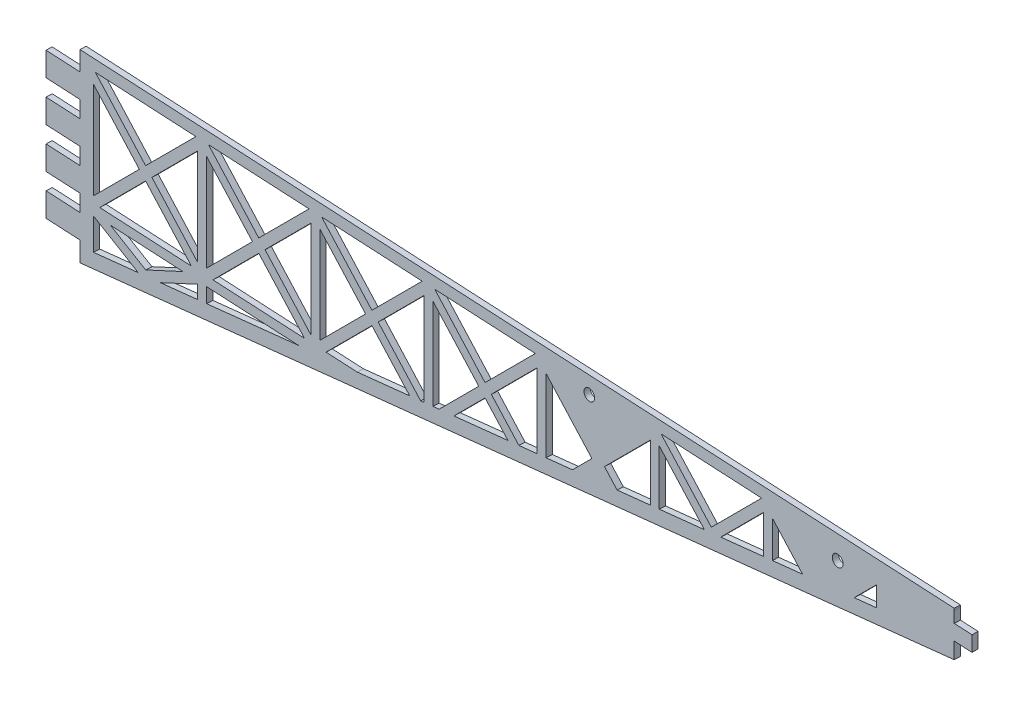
ISO-10303-21;
HEADER;
FILE_DESCRIPTION(('STEP AP214'),'2;1');
FILE_NAME('part.step','',(''),(''),'','','');
FILE_SCHEMA(('AUTOMOTIVE_DESIGN { 1 0 10303 214 1 1 1 1 }'));
ENDSEC;
DATA;
#1=APPLICATION_CONTEXT('core data for automotive mechanical design processes');
#2=APPLICATION_PROTOCOL_DEFINITION('international standard','automotive_design',2000,#1);
#3=PRODUCT_CONTEXT('',#1,'mechanical');
#4=PRODUCT('Part','Part','',(#3));
#5=PRODUCT_RELATED_PRODUCT_CATEGORY('part','',(#4));
#6=PRODUCT_DEFINITION_FORMATION('','',#4);
#7=PRODUCT_DEFINITION_CONTEXT('part definition',#1,'design');
#8=PRODUCT_DEFINITION('design','',#6,#7);
#9=PRODUCT_DEFINITION_SHAPE('','',#8);
#10=(LENGTH_UNIT() NAMED_UNIT(*) SI_UNIT(.MILLI.,.METRE.));
#11=(NAMED_UNIT(*) PLANE_ANGLE_UNIT() SI_UNIT($,.RADIAN.));
#12=(NAMED_UNIT(*) SI_UNIT($,.STERADIAN.) SOLID_ANGLE_UNIT());
#13=UNCERTAINTY_MEASURE_WITH_UNIT(LENGTH_MEASURE(1.E-05),#10,'distance_accuracy_value','');
#14=(GEOMETRIC_REPRESENTATION_CONTEXT(3) GLOBAL_UNCERTAINTY_ASSIGNED_CONTEXT((#13)) GLOBAL_UNIT_ASSIGNED_CONTEXT((#10,
#11,#12)) REPRESENTATION_CONTEXT('',''));
#15=CARTESIAN_POINT('',(0.,0.,0.));
#16=DIRECTION('',(0.,0.,1.));
#17=DIRECTION('',(1.,0.,0.));
#18=AXIS2_PLACEMENT_3D('',#15,#16,#17);
#19=CARTESIAN_POINT('',(0.0946084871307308,104.3,-1.8642638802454));
#20=DIRECTION('',(0.0506832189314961,0.,-0.998714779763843));
#21=DIRECTION('',(-0.998714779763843,0.,-0.0506832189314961));
#22=AXIS2_PLACEMENT_3D('',#19,#20,#21);
#23=PLANE('',#22);
#24=CARTESIAN_POINT('',(524.695987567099,92.87,24.7584387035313));
#25=DIRECTION('',(0.0506832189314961,0.,-0.998714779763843));
#26=DIRECTION('',(-0.998714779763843,0.,-0.0506832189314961));
#27=AXIS2_PLACEMENT_3D('',#24,#25,#26);
#28=CIRCLE('',#27,3.04800000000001);
#29=CARTESIAN_POINT('',(521.651904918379,92.87,24.6039562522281));
#30=VERTEX_POINT('',#29);
#31=EDGE_CURVE('E1278',#30,#30,#28,.T.);
#32=ORIENTED_EDGE('',*,*,#31,.T.);
#33=EDGE_LOOP('',(#32));
#34=FACE_BOUND('',#33,.T.);
#35=DIRECTION('',(-0.998714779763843,0.,-0.0506832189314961));
#36=VECTOR('',#35,1.);
#37=CARTESIAN_POINT('',(0.0946084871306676,17.4957185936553,-1.86426388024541));
#38=LINE('',#37,#36);
#39=CARTESIAN_POINT('',(99.9878046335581,17.4957185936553,3.20516017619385));
#40=VERTEX_POINT('',#39);
#41=CARTESIAN_POINT('',(80.9622880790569,17.4957185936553,2.23964485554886));
#42=VERTEX_POINT('',#41);
#43=EDGE_CURVE('E1256',#40,#42,#38,.T.);
#44=ORIENTED_EDGE('',*,*,#43,.F.);
#45=DIRECTION('',(0.,-1.,0.));
#46=VECTOR('',#45,1.);
#47=CARTESIAN_POINT('',(99.9878046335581,104.3,3.20516017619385));
#48=LINE('',#47,#46);
#49=CARTESIAN_POINT('',(99.9878046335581,6.97615344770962,3.20516017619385));
#50=VERTEX_POINT('',#49);
#51=EDGE_CURVE('E1249',#40,#50,#48,.T.);
#52=ORIENTED_EDGE('',*,*,#51,.T.);
#53=DIRECTION('',(0.987382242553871,0.150218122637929,0.0501081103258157));
#54=VECTOR('',#53,1.);
#55=CARTESIAN_POINT('',(99.9878046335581,6.97615344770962,3.20516017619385));
#56=LINE('',#55,#54);
#57=CARTESIAN_POINT('',(590.012852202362,81.5274665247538,28.0731678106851));
#58=VERTEX_POINT('',#57);
#59=EDGE_CURVE('E1254',#50,#58,#56,.T.);
#60=ORIENTED_EDGE('',*,*,#59,.T.);
#61=DIRECTION('',(0.,1.,0.));
#62=VECTOR('',#61,1.);
#63=CARTESIAN_POINT('',(590.012852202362,104.3,28.0731678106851));
#64=LINE('',#63,#62);
#65=CARTESIAN_POINT('',(590.012852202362,90.16,28.073167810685));
#66=VERTEX_POINT('',#65);
#67=EDGE_CURVE('E1411',#58,#66,#64,.T.);
#68=ORIENTED_EDGE('',*,*,#67,.T.);
#69=DIRECTION('',(0.998714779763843,0.,0.0506832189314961));
#70=VECTOR('',#69,1.);
#71=CARTESIAN_POINT('',(0.0946084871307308,90.16,-1.8642638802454));
#72=LINE('',#71,#70);
#73=CARTESIAN_POINT('',(600.,90.16,28.5800000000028));
#74=VERTEX_POINT('',#73);
#75=EDGE_CURVE('E1423',#66,#74,#72,.T.);
#76=ORIENTED_EDGE('',*,*,#75,.T.);
#77=DIRECTION('',(0.,-1.,0.));
#78=VECTOR('',#77,1.);
#79=CARTESIAN_POINT('',(600.,104.3,28.58));
#80=LINE('',#79,#78);
#81=CARTESIAN_POINT('',(600.,98.3,28.5800000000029));
#82=VERTEX_POINT('',#81);
#83=EDGE_CURVE('E2400',#82,#74,#80,.T.);
#84=ORIENTED_EDGE('',*,*,#83,.F.);
#85=DIRECTION('',(-0.998714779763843,0.,-0.0506832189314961));
#86=VECTOR('',#85,1.);
#87=CARTESIAN_POINT('',(0.0946084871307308,98.3,-1.8642638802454));
#88=LINE('',#87,#86);
#89=CARTESIAN_POINT('',(590.012852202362,98.3,28.073167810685));
#90=VERTEX_POINT('',#89);
#91=EDGE_CURVE('E1438',#82,#90,#88,.T.);
#92=ORIENTED_EDGE('',*,*,#91,.T.);
#93=DIRECTION('',(0.,1.,0.));
#94=VECTOR('',#93,1.);
#95=CARTESIAN_POINT('',(590.012852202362,104.3,28.0731678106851));
#96=LINE('',#95,#94);
#97=CARTESIAN_POINT('',(590.012538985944,104.3,28.0731519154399));
#98=VERTEX_POINT('',#97);
#99=EDGE_CURVE('E1410',#90,#98,#96,.T.);
#100=ORIENTED_EDGE('',*,*,#99,.T.);
#101=DIRECTION('',(-1.13817644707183E-13,-1.,0.));
#102=VECTOR('',#101,1.);
#103=CARTESIAN_POINT('',(590.012225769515,-6.73159542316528E-11,28.0731360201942));
#104=LINE('',#103,#102);
#105=CARTESIAN_POINT('',(590.012225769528,105.2760204,28.0731360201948));
#106=VERTEX_POINT('',#105);
#107=EDGE_CURVE('E1300',#106,#98,#104,.T.);
#108=ORIENTED_EDGE('',*,*,#107,.F.);
#109=DIRECTION('',(0.998714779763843,0.,0.0506832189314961));
#110=VECTOR('',#109,1.);
#111=CARTESIAN_POINT('',(0.0946084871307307,105.2760204,-1.8642638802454));
#112=LINE('',#111,#110);
#113=CARTESIAN_POINT('',(99.9878046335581,105.2760204,3.20516017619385));
#114=VERTEX_POINT('',#113);
#115=EDGE_CURVE('E1295',#114,#106,#112,.T.);
#116=ORIENTED_EDGE('',*,*,#115,.F.);
#117=DIRECTION('',(0.,-1.,0.));
#118=VECTOR('',#117,1.);
#119=CARTESIAN_POINT('',(99.9878046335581,104.3,3.20516017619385));
#120=LINE('',#119,#118);
#121=CARTESIAN_POINT('',(99.9878046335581,94.9657185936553,3.20516017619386));
#122=VERTEX_POINT('',#121);
#123=EDGE_CURVE('E2484',#114,#122,#120,.T.);
#124=ORIENTED_EDGE('',*,*,#123,.T.);
#125=DIRECTION('',(-0.998714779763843,0.,-0.0506832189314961));
#126=VECTOR('',#125,1.);
#127=CARTESIAN_POINT('',(0.0946084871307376,94.9657185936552,-1.8642638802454));
#128=LINE('',#127,#126);
#129=CARTESIAN_POINT('',(80.9622880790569,94.9657185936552,2.23964485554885));
#130=VERTEX_POINT('',#129);
#131=EDGE_CURVE('E2488',#122,#130,#128,.T.);
#132=ORIENTED_EDGE('',*,*,#131,.T.);
#133=DIRECTION('',(0.,1.,0.));
#134=VECTOR('',#133,1.);
#135=CARTESIAN_POINT('',(80.9622880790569,104.3,2.23964485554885));
#136=LINE('',#135,#134);
#137=CARTESIAN_POINT('',(80.9622880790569,82.2657185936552,2.23964485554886));
#138=VERTEX_POINT('',#137);
#139=EDGE_CURVE('E2492',#138,#130,#136,.T.);
#140=ORIENTED_EDGE('',*,*,#139,.F.);
#141=DIRECTION('',(0.998714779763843,0.,0.0506832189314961));
#142=VECTOR('',#141,1.);
#143=CARTESIAN_POINT('',(0.0946084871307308,82.2657185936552,-1.8642638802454));
#144=LINE('',#143,#142);
#145=CARTESIAN_POINT('',(99.9878046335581,82.2657185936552,3.20516017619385));
#146=VERTEX_POINT('',#145);
#147=EDGE_CURVE('E2495',#138,#146,#144,.T.);
#148=ORIENTED_EDGE('',*,*,#147,.T.);
#149=DIRECTION('',(0.,-1.,0.));
#150=VECTOR('',#149,1.);
#151=CARTESIAN_POINT('',(99.9878046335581,104.3,3.20516017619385));
#152=LINE('',#151,#150);
#153=CARTESIAN_POINT('',(99.9878046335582,73.3757185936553,3.20516017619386));
#154=VERTEX_POINT('',#153);
#155=EDGE_CURVE('E2499',#146,#154,#152,.T.);
#156=ORIENTED_EDGE('',*,*,#155,.T.);
#157=DIRECTION('',(-0.998714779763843,0.,-0.0506832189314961));
#158=VECTOR('',#157,1.);
#159=CARTESIAN_POINT('',(0.0946084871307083,73.3757185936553,-1.8642638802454));
#160=LINE('',#159,#158);
#161=CARTESIAN_POINT('',(80.9622880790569,73.3757185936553,2.23964485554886));
#162=VERTEX_POINT('',#161);
#163=EDGE_CURVE('E2503',#154,#162,#160,.T.);
#164=ORIENTED_EDGE('',*,*,#163,.T.);
#165=DIRECTION('',(0.,1.,0.));
#166=VECTOR('',#165,1.);
#167=CARTESIAN_POINT('',(80.9622880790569,104.3,2.23964485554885));
#168=LINE('',#167,#166);
#169=CARTESIAN_POINT('',(80.9622880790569,60.6757185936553,2.23964485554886));
#170=VERTEX_POINT('',#169);
#171=EDGE_CURVE('E2507',#170,#162,#168,.T.);
#172=ORIENTED_EDGE('',*,*,#171,.F.);
#173=DIRECTION('',(-0.998714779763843,0.,-0.0506832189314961));
#174=VECTOR('',#173,1.);
#175=CARTESIAN_POINT('',(0.0946084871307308,60.6757185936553,-1.8642638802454));
#176=LINE('',#175,#174);
#177=CARTESIAN_POINT('',(99.9878046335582,60.6757185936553,3.20516017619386));
#178=VERTEX_POINT('',#177);
#179=EDGE_CURVE('E2510',#178,#170,#176,.T.);
#180=ORIENTED_EDGE('',*,*,#179,.F.);
#181=DIRECTION('',(0.,-1.,0.));
#182=VECTOR('',#181,1.);
#183=CARTESIAN_POINT('',(99.9878046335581,104.3,3.20516017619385));
#184=LINE('',#183,#182);
#185=CARTESIAN_POINT('',(99.9878046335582,51.7857185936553,3.20516017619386));
#186=VERTEX_POINT('',#185);
#187=EDGE_CURVE('E2513',#178,#186,#184,.T.);
#188=ORIENTED_EDGE('',*,*,#187,.T.);
#189=DIRECTION('',(-0.998714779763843,0.,-0.0506832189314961));
#190=VECTOR('',#189,1.);
#191=CARTESIAN_POINT('',(0.0946084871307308,51.7857185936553,-1.8642638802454));
#192=LINE('',#191,#190);
#193=CARTESIAN_POINT('',(80.9622880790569,51.7857185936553,2.23964485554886));
#194=VERTEX_POINT('',#193);
#195=EDGE_CURVE('E2517',#186,#194,#192,.T.);
#196=ORIENTED_EDGE('',*,*,#195,.T.);
#197=DIRECTION('',(0.,1.,0.));
#198=VECTOR('',#197,1.);
#199=CARTESIAN_POINT('',(80.9622880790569,104.3,2.23964485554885));
#200=LINE('',#199,#198);
#201=CARTESIAN_POINT('',(80.9622880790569,39.0857185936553,2.23964485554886));
#202=VERTEX_POINT('',#201);
#203=EDGE_CURVE('E2521',#202,#194,#200,.T.);
#204=ORIENTED_EDGE('',*,*,#203,.F.);
#205=DIRECTION('',(-0.998714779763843,0.,-0.0506832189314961));
#206=VECTOR('',#205,1.);
#207=CARTESIAN_POINT('',(0.0946084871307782,39.0857185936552,-1.8642638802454));
#208=LINE('',#207,#206);
#209=CARTESIAN_POINT('',(99.9878046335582,39.0857185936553,3.20516017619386));
#210=VERTEX_POINT('',#209);
#211=EDGE_CURVE('E2524',#210,#202,#208,.T.);
#212=ORIENTED_EDGE('',*,*,#211,.F.);
#213=DIRECTION('',(0.,-1.,0.));
#214=VECTOR('',#213,1.);
#215=CARTESIAN_POINT('',(99.9878046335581,104.3,3.20516017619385));
#216=LINE('',#215,#214);
#217=CARTESIAN_POINT('',(99.9878046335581,30.1957185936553,3.20516017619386));
#218=VERTEX_POINT('',#217);
#219=EDGE_CURVE('E2527',#210,#218,#216,.T.);
#220=ORIENTED_EDGE('',*,*,#219,.T.);
#221=DIRECTION('',(0.998714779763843,0.,0.0506832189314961));
#222=VECTOR('',#221,1.);
#223=CARTESIAN_POINT('',(0.0946084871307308,30.1957185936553,-1.8642638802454));
#224=LINE('',#223,#222);
#225=CARTESIAN_POINT('',(80.9622880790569,30.1957185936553,2.23964485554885));
#226=VERTEX_POINT('',#225);
#227=EDGE_CURVE('E2531',#226,#218,#224,.T.);
#228=ORIENTED_EDGE('',*,*,#227,.F.);
#229=DIRECTION('',(0.,1.,0.));
#230=VECTOR('',#229,1.);
#231=CARTESIAN_POINT('',(80.9622880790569,104.3,2.23964485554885));
#232=LINE('',#231,#230);
#233=EDGE_CURVE('E2534',#42,#226,#232,.T.);
#234=ORIENTED_EDGE('',*,*,#233,.F.);
#235=EDGE_LOOP('',(#44,#52,#60,#68,#76,#84,#92,#100,#108,#116,#124,#132,#140,#148,#156,#164,
#172,#180,#188,#196,#204,#212,#220,#228,#234));
#236=FACE_BOUND('',#235,.T.);
#237=DIRECTION('',(0.,1.,0.));
#238=VECTOR('',#237,1.);
#239=CARTESIAN_POINT('',(292.839628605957,104.3,12.9920897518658));
#240=LINE('',#239,#238);
#241=CARTESIAN_POINT('',(292.839628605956,44.0061182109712,12.9920897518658));
#242=VERTEX_POINT('',#241);
#243=CARTESIAN_POINT('',(292.839628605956,93.2644660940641,12.9920897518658));
#244=VERTEX_POINT('',#243);
#245=EDGE_CURVE('E2394',#242,#244,#240,.T.);
#246=ORIENTED_EDGE('',*,*,#245,.F.);
#247=DIRECTION('',(-0.987382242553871,-0.150218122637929,-0.0501081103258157));
#248=VECTOR('',#247,1.);
#249=CARTESIAN_POINT('',(15.6434934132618,1.83411912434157,-1.07518219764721));
#250=LINE('',#249,#248);
#251=CARTESIAN_POINT('',(290.957768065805,43.7198161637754,12.8965882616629));
#252=VERTEX_POINT('',#251);
#253=EDGE_CURVE('E2383',#242,#252,#250,.T.);
#254=ORIENTED_EDGE('',*,*,#253,.T.);
#255=DIRECTION('',(0.706197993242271,-0.70710678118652,0.0358384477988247));
#256=VECTOR('',#255,1.);
#257=CARTESIAN_POINT('',(115.275025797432,219.628640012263,3.98096283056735));
#258=LINE('',#257,#256);
#259=CARTESIAN_POINT('',(267.158211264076,67.55,11.6887978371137));
#260=VERTEX_POINT('',#259);
#261=EDGE_CURVE('E2387',#260,#252,#258,.T.);
#262=ORIENTED_EDGE('',*,*,#261,.F.);
#263=DIRECTION('',(0.70619799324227,0.70710678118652,0.0358384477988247));
#264=VECTOR('',#263,1.);
#265=CARTESIAN_POINT('',(151.977793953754,-47.7786400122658,5.84357112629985));
#266=LINE('',#265,#264);
#267=EDGE_CURVE('E2390',#260,#244,#266,.T.);
#268=ORIENTED_EDGE('',*,*,#267,.T.);
#269=EDGE_LOOP('',(#246,#254,#262,#268));
#270=FACE_BOUND('',#269,.T.);
#271=DIRECTION('',(0.70619799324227,0.707106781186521,0.0358384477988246));
#272=VECTOR('',#271,1.);
#273=CARTESIAN_POINT('',(180.155998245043,-75.9931061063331,7.27357108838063));
#274=LINE('',#273,#272);
#275=CARTESIAN_POINT('',(301.284063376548,45.2908356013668,13.4206316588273));
#276=VERTEX_POINT('',#275);
#277=CARTESIAN_POINT('',(323.514619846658,67.55,14.5487977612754));
#278=VERTEX_POINT('',#277);
#279=EDGE_CURVE('E2376',#276,#278,#274,.T.);
#280=ORIENTED_EDGE('',*,*,#279,.F.);
#281=DIRECTION('',(-0.987382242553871,-0.150218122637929,-0.0501081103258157));
#282=VECTOR('',#281,1.);
#283=CARTESIAN_POINT('',(15.6434934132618,1.83411912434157,-1.07518219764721));
#284=LINE('',#283,#282);
#285=CARTESIAN_POINT('',(297.833202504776,44.7658293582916,13.2455058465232));
#286=VERTEX_POINT('',#285);
#287=EDGE_CURVE('E2379',#276,#286,#284,.T.);
#288=ORIENTED_EDGE('',*,*,#287,.T.);
#289=DIRECTION('',(0.,1.,0.));
#290=VECTOR('',#289,1.);
#291=CARTESIAN_POINT('',(297.833202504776,104.3,13.2455058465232));
#292=LINE('',#291,#290);
#293=CARTESIAN_POINT('',(297.833202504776,93.2644660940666,13.2455058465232));
#294=VERTEX_POINT('',#293);
#295=EDGE_CURVE('E2368',#286,#294,#292,.T.);
#296=ORIENTED_EDGE('',*,*,#295,.T.);
#297=DIRECTION('',(0.70619799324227,-0.70710678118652,0.0358384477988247));
#298=VECTOR('',#297,1.);
#299=CARTESIAN_POINT('',(143.453230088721,247.84310610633,5.41096279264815));
#300=LINE('',#299,#298);
#301=EDGE_CURVE('E2372',#294,#278,#300,.T.);
#302=ORIENTED_EDGE('',*,*,#301,.T.);
#303=EDGE_LOOP('',(#280,#288,#296,#302));
#304=FACE_BOUND('',#303,.T.);
#305=DIRECTION('',(0.70619799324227,-0.70710678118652,0.0358384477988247));
#306=VECTOR('',#305,1.);
#307=CARTESIAN_POINT('',(146.984220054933,251.378640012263,5.59015503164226));
#308=LINE('',#307,#306);
#309=CARTESIAN_POINT('',(298.867405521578,99.2999999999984,13.2979900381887));
#310=VERTEX_POINT('',#309);
#311=CARTESIAN_POINT('',(327.045609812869,71.0855339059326,14.7279900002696));
#312=VERTEX_POINT('',#311);
#313=EDGE_CURVE('E2350',#310,#312,#308,.T.);
#314=ORIENTED_EDGE('',*,*,#313,.F.);
#315=DIRECTION('',(0.998714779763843,0.,0.0506832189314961));
#316=VECTOR('',#315,1.);
#317=CARTESIAN_POINT('',(0.0946084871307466,99.2999999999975,-1.8642638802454));
#318=LINE('',#317,#316);
#319=CARTESIAN_POINT('',(355.223814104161,99.2999999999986,16.1579899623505));
#320=VERTEX_POINT('',#319);
#321=EDGE_CURVE('E2342',#310,#320,#318,.T.);
#322=ORIENTED_EDGE('',*,*,#321,.T.);
#323=DIRECTION('',(0.70619799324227,0.707106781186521,0.0358384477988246));
#324=VECTOR('',#323,1.);
#325=CARTESIAN_POINT('',(180.155998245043,-75.9931061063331,7.27357108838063));
#326=LINE('',#325,#324);
#327=EDGE_CURVE('E2346',#312,#320,#326,.T.);
#328=ORIENTED_EDGE('',*,*,#327,.F.);
#329=EDGE_LOOP('',(#314,#322,#328));
#330=FACE_BOUND('',#329,.T.);
#331=DIRECTION('',(0.70619799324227,0.70710678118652,0.0358384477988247));
#332=VECTOR('',#331,1.);
#333=CARTESIAN_POINT('',(148.446803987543,-44.243106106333,5.66437888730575));
#334=LINE('',#333,#332);
#335=CARTESIAN_POINT('',(263.627221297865,71.0855339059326,11.5096055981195));
#336=VERTEX_POINT('',#335);
#337=CARTESIAN_POINT('',(291.805425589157,99.2999999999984,12.9396055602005));
#338=VERTEX_POINT('',#337);
#339=EDGE_CURVE('E2328',#336,#338,#334,.T.);
#340=ORIENTED_EDGE('',*,*,#339,.F.);
#341=DIRECTION('',(0.70619799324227,-0.70710678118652,0.0358384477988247));
#342=VECTOR('',#341,1.);
#343=CARTESIAN_POINT('',(115.275025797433,219.628640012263,3.98096283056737));
#344=LINE('',#343,#342);
#345=CARTESIAN_POINT('',(235.449017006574,99.2999999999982,10.0796056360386));
#346=VERTEX_POINT('',#345);
#347=EDGE_CURVE('E2321',#346,#336,#344,.T.);
#348=ORIENTED_EDGE('',*,*,#347,.F.);
#349=DIRECTION('',(0.998714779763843,0.,0.0506832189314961));
#350=VECTOR('',#349,1.);
#351=CARTESIAN_POINT('',(0.0946084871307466,99.2999999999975,-1.8642638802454));
#352=LINE('',#351,#350);
#353=EDGE_CURVE('E2324',#346,#338,#352,.T.);
#354=ORIENTED_EDGE('',*,*,#353,.T.);
#355=EDGE_LOOP('',(#340,#348,#354));
#356=FACE_BOUND('',#355,.T.);
#357=DIRECTION('',(0.,1.,0.));
#358=VECTOR('',#357,1.);
#359=CARTESIAN_POINT('',(229.421240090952,104.3,9.77370534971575));
#360=LINE('',#359,#358);
#361=CARTESIAN_POINT('',(229.421240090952,41.8355339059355,9.77370534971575));
#362=VERTEX_POINT('',#361);
#363=CARTESIAN_POINT('',(229.421240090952,93.2644660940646,9.77370534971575));
#364=VERTEX_POINT('',#363);
#365=EDGE_CURVE('E2307',#362,#364,#360,.T.);
#366=ORIENTED_EDGE('',*,*,#365,.F.);
#367=DIRECTION('',(0.70619799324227,-0.70710678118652,0.0358384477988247));
#368=VECTOR('',#367,1.);
#369=CARTESIAN_POINT('',(83.5658315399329,187.878640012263,2.37177062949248));
#370=LINE('',#369,#368);
#371=CARTESIAN_POINT('',(203.739822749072,67.55,8.47041343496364));
#372=VERTEX_POINT('',#371);
#373=EDGE_CURVE('E2300',#372,#362,#370,.T.);
#374=ORIENTED_EDGE('',*,*,#373,.F.);
#375=DIRECTION('',(0.70619799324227,0.70710678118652,0.0358384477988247));
#376=VECTOR('',#375,1.);
#377=CARTESIAN_POINT('',(120.268599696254,-16.0286400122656,4.23437892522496));
#378=LINE('',#377,#376);
#379=EDGE_CURVE('E2303',#372,#364,#378,.T.);
#380=ORIENTED_EDGE('',*,*,#379,.T.);
#381=EDGE_LOOP('',(#366,#374,#380));
#382=FACE_BOUND('',#381,.T.);
#383=DIRECTION('',(0.,1.,0.));
#384=VECTOR('',#383,1.);
#385=CARTESIAN_POINT('',(483.094794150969,104.3,22.6472429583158));
#386=LINE('',#385,#384);
#387=CARTESIAN_POINT('',(483.094794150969,72.9511129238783,22.6472429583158));
#388=VERTEX_POINT('',#387);
#389=CARTESIAN_POINT('',(483.094794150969,93.2644660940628,22.6472429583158));
#390=VERTEX_POINT('',#389);
#391=EDGE_CURVE('E2262',#388,#390,#386,.T.);
#392=ORIENTED_EDGE('',*,*,#391,.F.);
#393=DIRECTION('',(-0.987382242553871,-0.150218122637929,-0.0501081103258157));
#394=VECTOR('',#393,1.);
#395=CARTESIAN_POINT('',(15.6434934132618,1.83411912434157,-1.07518219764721));
#396=LINE('',#395,#394);
#397=CARTESIAN_POINT('',(459.172784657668,69.3116719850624,21.4332382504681));
#398=VERTEX_POINT('',#397);
#399=EDGE_CURVE('E2254',#388,#398,#396,.T.);
#400=ORIENTED_EDGE('',*,*,#399,.T.);
#401=DIRECTION('',(0.70619799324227,0.707106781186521,0.0358384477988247));
#402=VECTOR('',#401,1.);
#403=CARTESIAN_POINT('',(247.105376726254,-143.028640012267,10.6711477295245));
#404=LINE('',#403,#402);
#405=EDGE_CURVE('E2258',#398,#390,#404,.T.);
#406=ORIENTED_EDGE('',*,*,#405,.T.);
#407=EDGE_LOOP('',(#392,#400,#406));
#408=FACE_BOUND('',#407,.T.);
#409=DIRECTION('',(0.70619799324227,-0.707106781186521,0.0358384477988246));
#410=VECTOR('',#409,1.);
#411=CARTESIAN_POINT('',(206.871618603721,311.343106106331,8.62934719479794));
#412=LINE('',#411,#410);
#413=CARTESIAN_POINT('',(424.669979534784,93.2644660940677,19.6822746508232));
#414=VERTEX_POINT('',#413);
#415=CARTESIAN_POINT('',(449.987605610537,67.9142594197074,20.9671047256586));
#416=VERTEX_POINT('',#415);
#417=EDGE_CURVE('E2246',#414,#416,#412,.T.);
#418=ORIENTED_EDGE('',*,*,#417,.T.);
#419=DIRECTION('',(-0.987382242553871,-0.150218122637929,-0.0501081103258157));
#420=VECTOR('',#419,1.);
#421=CARTESIAN_POINT('',(15.6434934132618,1.83411912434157,-1.07518219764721));
#422=LINE('',#421,#420);
#423=CARTESIAN_POINT('',(424.669979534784,64.0624925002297,19.6822746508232));
#424=VERTEX_POINT('',#423);
#425=EDGE_CURVE('E2250',#416,#424,#422,.T.);
#426=ORIENTED_EDGE('',*,*,#425,.T.);
#427=DIRECTION('',(0.,1.,0.));
#428=VECTOR('',#427,1.);
#429=CARTESIAN_POINT('',(424.669979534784,104.3,19.6822746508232));
#430=LINE('',#429,#428);
#431=EDGE_CURVE('E2242',#424,#414,#430,.T.);
#432=ORIENTED_EDGE('',*,*,#431,.T.);
#433=EDGE_LOOP('',(#418,#426,#432));
#434=FACE_BOUND('',#433,.T.);
#435=DIRECTION('',(0.887755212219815,-0.458105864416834,0.0450521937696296));
#436=VECTOR('',#435,1.);
#437=CARTESIAN_POINT('',(-4.23856366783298,95.8811965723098,-2.08416561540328));
#438=LINE('',#437,#436);
#439=CARTESIAN_POINT('',(117.036424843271,33.3,4.07035108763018));
#440=VERTEX_POINT('',#439);
#441=CARTESIAN_POINT('',(136.862078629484,23.0694227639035,5.07647212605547));
#442=VERTEX_POINT('',#441);
#443=EDGE_CURVE('E2161',#440,#442,#438,.T.);
#444=ORIENTED_EDGE('',*,*,#443,.F.);
#445=DIRECTION('',(0.998714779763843,0.,0.0506832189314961));
#446=VECTOR('',#445,1.);
#447=CARTESIAN_POINT('',(0.0946084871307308,33.3,-1.8642638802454));
#448=LINE('',#447,#446);
#449=CARTESIAN_POINT('',(157.724809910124,33.3,6.13522323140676));
#450=VERTEX_POINT('',#449);
#451=EDGE_CURVE('E2153',#440,#450,#448,.T.);
#452=ORIENTED_EDGE('',*,*,#451,.T.);
#453=DIRECTION('',(0.896926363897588,0.439830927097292,0.0455176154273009));
#454=VECTOR('',#453,1.);
#455=CARTESIAN_POINT('',(58.5975798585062,-15.3095885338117,1.10467076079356));
#456=LINE('',#455,#454);
#457=EDGE_CURVE('E2157',#442,#450,#456,.T.);
#458=ORIENTED_EDGE('',*,*,#457,.F.);
#459=EDGE_LOOP('',(#444,#452,#458));
#460=FACE_BOUND('',#459,.T.);
#461=DIRECTION('',(0.998714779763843,0.,0.0506832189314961));
#462=VECTOR('',#461,1.);
#463=CARTESIAN_POINT('',(0.0946084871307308,38.3,-1.8642638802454));
#464=LINE('',#463,#462);
#465=CARTESIAN_POINT('',(111.109026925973,38.3,3.76954487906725));
#466=VERTEX_POINT('',#465);
#467=CARTESIAN_POINT('',(162.471861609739,38.3,6.37612870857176));
#468=VERTEX_POINT('',#467);
#469=EDGE_CURVE('E2139',#466,#468,#464,.T.);
#470=ORIENTED_EDGE('',*,*,#469,.F.);
#471=DIRECTION('',(0.70619799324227,0.70710678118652,0.0358384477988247));
#472=VECTOR('',#471,1.);
#473=CARTESIAN_POINT('',(88.5594054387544,15.7213599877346,2.62518672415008));
#474=LINE('',#473,#472);
#475=CARTESIAN_POINT('',(136.790444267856,64.0144660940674,5.0728367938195));
#476=VERTEX_POINT('',#475);
#477=EDGE_CURVE('E2131',#466,#476,#474,.T.);
#478=ORIENTED_EDGE('',*,*,#477,.T.);
#479=DIRECTION('',(0.70619799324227,-0.707106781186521,0.0358384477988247));
#480=VECTOR('',#479,1.);
#481=CARTESIAN_POINT('',(48.325647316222,152.59310610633,0.583386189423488));
#482=LINE('',#481,#480);
#483=EDGE_CURVE('E2135',#476,#468,#482,.T.);
#484=ORIENTED_EDGE('',*,*,#483,.T.);
#485=EDGE_LOOP('',(#470,#478,#484));
#486=FACE_BOUND('',#485,.T.);
#487=DIRECTION('',(0.70619799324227,0.70710678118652,0.0358384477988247));
#488=VECTOR('',#487,1.);
#489=CARTESIAN_POINT('',(85.0284154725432,19.2568938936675,2.44599448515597));
#490=LINE('',#489,#488);
#491=CARTESIAN_POINT('',(136.790444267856,71.0855339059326,5.07283679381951));
#492=VERTEX_POINT('',#491);
#493=CARTESIAN_POINT('',(164.968648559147,99.299999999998,6.5028367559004));
#494=VERTEX_POINT('',#493);
#495=EDGE_CURVE('E2118',#492,#494,#490,.T.);
#496=ORIENTED_EDGE('',*,*,#495,.F.);
#497=DIRECTION('',(0.70619799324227,-0.707106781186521,0.0358384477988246));
#498=VECTOR('',#497,1.);
#499=CARTESIAN_POINT('',(51.8566372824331,156.128640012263,0.762578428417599));
#500=LINE('',#499,#498);
#501=CARTESIAN_POINT('',(108.612239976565,99.2999999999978,3.64283683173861));
#502=VERTEX_POINT('',#501);
#503=EDGE_CURVE('E2111',#502,#492,#500,.T.);
#504=ORIENTED_EDGE('',*,*,#503,.F.);
#505=DIRECTION('',(0.998714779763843,0.,0.0506832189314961));
#506=VECTOR('',#505,1.);
#507=CARTESIAN_POINT('',(0.0946084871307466,99.2999999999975,-1.8642638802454));
#508=LINE('',#507,#506);
#509=EDGE_CURVE('E2114',#502,#494,#508,.T.);
#510=ORIENTED_EDGE('',*,*,#509,.T.);
#511=EDGE_LOOP('',(#496,#504,#510));
#512=FACE_BOUND('',#511,.T.);
#513=DIRECTION('',(0.70619799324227,0.70710678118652,0.0358384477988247));
#514=VECTOR('',#513,1.);
#515=CARTESIAN_POINT('',(116.737609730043,-12.4931061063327,4.05518668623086));
#516=LINE('',#515,#514);
#517=CARTESIAN_POINT('',(170.996425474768,41.8355339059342,6.80873704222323));
#518=VERTEX_POINT('',#517);
#519=CARTESIAN_POINT('',(196.677842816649,67.55,8.11202895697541));
#520=VERTEX_POINT('',#519);
#521=EDGE_CURVE('E2097',#518,#520,#516,.T.);
#522=ORIENTED_EDGE('',*,*,#521,.F.);
#523=DIRECTION('',(0.,1.,0.));
#524=VECTOR('',#523,1.);
#525=CARTESIAN_POINT('',(170.996425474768,104.3,6.80873704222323));
#526=LINE('',#525,#524);
#527=CARTESIAN_POINT('',(170.996425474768,93.2644660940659,6.80873704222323));
#528=VERTEX_POINT('',#527);
#529=EDGE_CURVE('E2089',#518,#528,#526,.T.);
#530=ORIENTED_EDGE('',*,*,#529,.T.);
#531=DIRECTION('',(0.70619799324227,-0.70710678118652,0.0358384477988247));
#532=VECTOR('',#531,1.);
#533=CARTESIAN_POINT('',(80.0348415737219,184.34310610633,2.19257839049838));
#534=LINE('',#533,#532);
#535=EDGE_CURVE('E2093',#528,#520,#534,.T.);
#536=ORIENTED_EDGE('',*,*,#535,.T.);
#537=EDGE_LOOP('',(#522,#530,#536));
#538=FACE_BOUND('',#537,.T.);
#539=CARTESIAN_POINT('',(385.485134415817,96.172,17.69370481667));
#540=DIRECTION('',(0.0506832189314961,0.,-0.998714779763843));
#541=DIRECTION('',(-0.998714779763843,0.,-0.0506832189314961));
#542=AXIS2_PLACEMENT_3D('',#539,#540,#541);
#543=CIRCLE('',#542,2.99999999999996);
#544=CARTESIAN_POINT('',(382.488990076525,96.172,17.5416551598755));
#545=VERTEX_POINT('',#544);
#546=EDGE_CURVE('E2085',#545,#545,#543,.T.);
#547=ORIENTED_EDGE('',*,*,#546,.T.);
#548=EDGE_LOOP('',(#547));
#549=FACE_BOUND('',#548,.T.);
#550=DIRECTION('',(0.998714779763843,0.,0.0506832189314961));
#551=VECTOR('',#550,1.);
#552=CARTESIAN_POINT('',(0.0946084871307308,38.3,-1.8642638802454));
#553=LINE('',#552,#551);
#554=CARTESIAN_POINT('',(237.945803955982,38.3,10.2063136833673));
#555=VERTEX_POINT('',#554);
#556=CARTESIAN_POINT('',(255.333369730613,38.3,11.0887055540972));
#557=VERTEX_POINT('',#556);
#558=EDGE_CURVE('E2082',#555,#557,#553,.T.);
#559=ORIENTED_EDGE('',*,*,#558,.F.);
#560=DIRECTION('',(0.70619799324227,0.70710678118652,0.0358384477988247));
#561=VECTOR('',#560,1.);
#562=CARTESIAN_POINT('',(151.977793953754,-47.7786400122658,5.84357112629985));
#563=LINE('',#562,#561);
#564=CARTESIAN_POINT('',(263.627221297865,64.0144660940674,11.5096055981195));
#565=VERTEX_POINT('',#564);
#566=EDGE_CURVE('E2070',#555,#565,#563,.T.);
#567=ORIENTED_EDGE('',*,*,#566,.T.);
#568=DIRECTION('',(0.70619799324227,-0.70710678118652,0.0358384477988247));
#569=VECTOR('',#568,1.);
#570=CARTESIAN_POINT('',(111.744035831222,216.09310610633,3.80177059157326));
#571=LINE('',#570,#569);
#572=CARTESIAN_POINT('',(284.8272697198,42.7871358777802,12.5854750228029));
#573=VERTEX_POINT('',#572);
#574=EDGE_CURVE('E2074',#565,#573,#571,.T.);
#575=ORIENTED_EDGE('',*,*,#574,.T.);
#576=DIRECTION('',(-0.987382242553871,-0.150218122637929,-0.0501081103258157));
#577=VECTOR('',#576,1.);
#578=CARTESIAN_POINT('',(15.6434934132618,1.83411912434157,-1.07518219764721));
#579=LINE('',#578,#577);
#580=EDGE_CURVE('E2078',#573,#557,#579,.T.);
#581=ORIENTED_EDGE('',*,*,#580,.T.);
#582=EDGE_LOOP('',(#559,#567,#575,#581));
#583=FACE_BOUND('',#582,.T.);
#584=DIRECTION('',(0.998714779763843,0.,0.0506832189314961));
#585=VECTOR('',#584,1.);
#586=CARTESIAN_POINT('',(0.0946084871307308,38.3,-1.8642638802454));
#587=LINE('',#586,#585);
#588=CARTESIAN_POINT('',(174.527415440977,38.3,6.98792928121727));
#589=VERTEX_POINT('',#588);
#590=CARTESIAN_POINT('',(225.890250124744,38.3,9.59451311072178));
#591=VERTEX_POINT('',#590);
#592=EDGE_CURVE('E2108',#589,#591,#587,.T.);
#593=ORIENTED_EDGE('',*,*,#592,.F.);
#594=DIRECTION('',(0.70619799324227,0.70710678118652,0.0358384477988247));
#595=VECTOR('',#594,1.);
#596=CARTESIAN_POINT('',(120.268599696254,-16.0286400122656,4.23437892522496));
#597=LINE('',#596,#595);
#598=CARTESIAN_POINT('',(200.208832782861,64.0144660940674,8.29122119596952));
#599=VERTEX_POINT('',#598);
#600=EDGE_CURVE('E2100',#589,#599,#597,.T.);
#601=ORIENTED_EDGE('',*,*,#600,.T.);
#602=DIRECTION('',(0.70619799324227,-0.70710678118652,0.0358384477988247));
#603=VECTOR('',#602,1.);
#604=CARTESIAN_POINT('',(80.0348415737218,184.34310610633,2.19257839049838));
#605=LINE('',#604,#603);
#606=EDGE_CURVE('E2104',#599,#591,#605,.T.);
#607=ORIENTED_EDGE('',*,*,#606,.T.);
#608=EDGE_LOOP('',(#593,#601,#607));
#609=FACE_BOUND('',#608,.T.);
#610=DIRECTION('',(0.,1.,0.));
#611=VECTOR('',#610,1.);
#612=CARTESIAN_POINT('',(166.002851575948,104.3,6.55532094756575));
#613=LINE('',#612,#611);
#614=CARTESIAN_POINT('',(166.002851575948,41.8355339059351,6.55532094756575));
#615=VERTEX_POINT('',#614);
#616=CARTESIAN_POINT('',(166.002851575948,93.2644660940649,6.55532094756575));
#617=VERTEX_POINT('',#616);
#618=EDGE_CURVE('E2128',#615,#617,#613,.T.);
#619=ORIENTED_EDGE('',*,*,#618,.F.);
#620=DIRECTION('',(0.70619799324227,-0.70710678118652,0.0358384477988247));
#621=VECTOR('',#620,1.);
#622=CARTESIAN_POINT('',(51.8566372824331,156.128640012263,0.762578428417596));
#623=LINE('',#622,#621);
#624=CARTESIAN_POINT('',(140.321434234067,67.55,5.25202903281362));
#625=VERTEX_POINT('',#624);
#626=EDGE_CURVE('E2121',#625,#615,#623,.T.);
#627=ORIENTED_EDGE('',*,*,#626,.F.);
#628=DIRECTION('',(0.70619799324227,0.70710678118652,0.0358384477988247));
#629=VECTOR('',#628,1.);
#630=CARTESIAN_POINT('',(88.5594054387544,15.7213599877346,2.62518672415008));
#631=LINE('',#630,#629);
#632=EDGE_CURVE('E2124',#625,#617,#631,.T.);
#633=ORIENTED_EDGE('',*,*,#632,.T.);
#634=EDGE_LOOP('',(#619,#627,#633));
#635=FACE_BOUND('',#634,.T.);
#636=DIRECTION('',(0.70619799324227,0.70710678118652,0.0358384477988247));
#637=VECTOR('',#636,1.);
#638=CARTESIAN_POINT('',(85.0284154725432,19.2568938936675,2.44599448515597));
#639=LINE('',#638,#637);
#640=CARTESIAN_POINT('',(107.578036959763,41.8355339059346,3.59035264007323));
#641=VERTEX_POINT('',#640);
#642=CARTESIAN_POINT('',(133.259454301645,67.55,4.89364455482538));
#643=VERTEX_POINT('',#642);
#644=EDGE_CURVE('E2150',#641,#643,#639,.T.);
#645=ORIENTED_EDGE('',*,*,#644,.F.);
#646=DIRECTION('',(0.,1.,0.));
#647=VECTOR('',#646,1.);
#648=CARTESIAN_POINT('',(107.578036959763,104.3,3.59035264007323));
#649=LINE('',#648,#647);
#650=CARTESIAN_POINT('',(107.578036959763,93.2644660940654,3.59035264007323));
#651=VERTEX_POINT('',#650);
#652=EDGE_CURVE('E2142',#641,#651,#649,.T.);
#653=ORIENTED_EDGE('',*,*,#652,.T.);
#654=DIRECTION('',(0.70619799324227,-0.70710678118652,0.0358384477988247));
#655=VECTOR('',#654,1.);
#656=CARTESIAN_POINT('',(48.325647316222,152.59310610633,0.583386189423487));
#657=LINE('',#656,#655);
#658=EDGE_CURVE('E2146',#651,#643,#657,.T.);
#659=ORIENTED_EDGE('',*,*,#658,.T.);
#660=EDGE_LOOP('',(#645,#653,#659));
#661=FACE_BOUND('',#660,.T.);
#662=DIRECTION('',(-0.987382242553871,-0.150218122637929,-0.0501081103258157));
#663=VECTOR('',#662,1.);
#664=CARTESIAN_POINT('',(15.6434934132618,1.83411912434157,-1.07518219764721));
#665=LINE('',#664,#663);
#666=CARTESIAN_POINT('',(132.624255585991,19.6313102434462,4.86140920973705));
#667=VERTEX_POINT('',#666);
#668=CARTESIAN_POINT('',(107.578036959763,15.8208346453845,3.59035264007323));
#669=VERTEX_POINT('',#668);
#670=EDGE_CURVE('E2168',#667,#669,#665,.T.);
#671=ORIENTED_EDGE('',*,*,#670,.T.);
#672=DIRECTION('',(0.,1.,0.));
#673=VECTOR('',#672,1.);
#674=CARTESIAN_POINT('',(107.578036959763,104.3,3.59035264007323));
#675=LINE('',#674,#673);
#676=CARTESIAN_POINT('',(107.578036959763,32.555841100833,3.59035264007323));
#677=VERTEX_POINT('',#676);
#678=EDGE_CURVE('E2172',#669,#677,#675,.T.);
#679=ORIENTED_EDGE('',*,*,#678,.T.);
#680=DIRECTION('',(0.887755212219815,-0.458105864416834,0.0450521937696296));
#681=VECTOR('',#680,1.);
#682=CARTESIAN_POINT('',(-6.52614915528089,91.4367083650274,-2.20025701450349));
#683=LINE('',#682,#681);
#684=EDGE_CURVE('E2164',#677,#667,#683,.T.);
#685=ORIENTED_EDGE('',*,*,#684,.T.);
#686=EDGE_LOOP('',(#671,#679,#685));
#687=FACE_BOUND('',#686,.T.);
#688=DIRECTION('',(0.,1.,0.));
#689=VECTOR('',#688,1.);
#690=CARTESIAN_POINT('',(166.002851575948,104.3,6.55532094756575));
#691=LINE('',#690,#689);
#692=CARTESIAN_POINT('',(166.002851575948,24.7094550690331,6.55532094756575));
#693=VERTEX_POINT('',#692);
#694=CARTESIAN_POINT('',(166.002851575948,31.7919217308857,6.55532094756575));
#695=VERTEX_POINT('',#694);
#696=EDGE_CURVE('E2180',#693,#695,#691,.T.);
#697=ORIENTED_EDGE('',*,*,#696,.F.);
#698=DIRECTION('',(-0.987382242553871,-0.150218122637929,-0.0501081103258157));
#699=VECTOR('',#698,1.);
#700=CARTESIAN_POINT('',(15.6434934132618,1.83411912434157,-1.07518219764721));
#701=LINE('',#700,#699);
#702=CARTESIAN_POINT('',(145.063551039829,21.5237967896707,5.49268407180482));
#703=VERTEX_POINT('',#702);
#704=EDGE_CURVE('E2184',#693,#703,#701,.T.);
#705=ORIENTED_EDGE('',*,*,#704,.T.);
#706=DIRECTION('',(0.896926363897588,0.439830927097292,0.045517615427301));
#707=VECTOR('',#706,1.);
#708=CARTESIAN_POINT('',(60.7939080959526,-19.7999915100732,1.21613099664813));
#709=LINE('',#708,#707);
#710=EDGE_CURVE('E2176',#703,#695,#709,.T.);
#711=ORIENTED_EDGE('',*,*,#710,.T.);
#712=EDGE_LOOP('',(#697,#705,#711));
#713=FACE_BOUND('',#712,.T.);
#714=DIRECTION('',(-0.987382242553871,-0.150218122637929,-0.0501081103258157));
#715=VECTOR('',#714,1.);
#716=CARTESIAN_POINT('',(15.6434934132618,1.83411912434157,-1.07518219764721));
#717=LINE('',#716,#715);
#718=CARTESIAN_POINT('',(222.468418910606,33.3,9.42086050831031));
#719=VERTEX_POINT('',#718);
#720=CARTESIAN_POINT('',(170.996425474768,25.4691662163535,6.80873704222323));
#721=VERTEX_POINT('',#720);
#722=EDGE_CURVE('E2192',#719,#721,#717,.T.);
#723=ORIENTED_EDGE('',*,*,#722,.T.);
#724=DIRECTION('',(0.,1.,0.));
#725=VECTOR('',#724,1.);
#726=CARTESIAN_POINT('',(170.996425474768,104.3,6.80873704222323));
#727=LINE('',#726,#725);
#728=CARTESIAN_POINT('',(170.996425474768,33.3,6.80873704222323));
#729=VERTEX_POINT('',#728);
#730=EDGE_CURVE('E2196',#721,#729,#727,.T.);
#731=ORIENTED_EDGE('',*,*,#730,.T.);
#732=DIRECTION('',(0.998714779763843,0.,0.0506832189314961));
#733=VECTOR('',#732,1.);
#734=CARTESIAN_POINT('',(0.0946084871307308,33.3,-1.8642638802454));
#735=LINE('',#734,#733);
#736=EDGE_CURVE('E2188',#729,#719,#735,.T.);
#737=ORIENTED_EDGE('',*,*,#736,.T.);
#738=EDGE_LOOP('',(#723,#731,#737));
#739=FACE_BOUND('',#738,.T.);
#740=DIRECTION('',(-0.987382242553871,-0.150218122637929,-0.0501081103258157));
#741=VECTOR('',#740,1.);
#742=CARTESIAN_POINT('',(15.6434934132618,1.83411912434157,-1.07518219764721));
#743=LINE('',#742,#741);
#744=CARTESIAN_POINT('',(339.880715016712,51.1628437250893,15.3793515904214));
#745=VERTEX_POINT('',#744);
#746=CARTESIAN_POINT('',(309.611302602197,46.5577231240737,13.8432260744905));
#747=VERTEX_POINT('',#746);
#748=EDGE_CURVE('E2204',#745,#747,#743,.T.);
#749=ORIENTED_EDGE('',*,*,#748,.T.);
#750=DIRECTION('',(0.70619799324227,0.707106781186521,0.0358384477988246));
#751=VECTOR('',#750,1.);
#752=CARTESIAN_POINT('',(183.686988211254,-79.5286400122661,7.45276332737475));
#753=LINE('',#752,#751);
#754=CARTESIAN_POINT('',(327.04560981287,64.0144660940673,14.7279900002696));
#755=VERTEX_POINT('',#754);
#756=EDGE_CURVE('E2208',#747,#755,#753,.T.);
#757=ORIENTED_EDGE('',*,*,#756,.T.);
#758=DIRECTION('',(0.706197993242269,-0.707106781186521,0.0358384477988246));
#759=VECTOR('',#758,1.);
#760=CARTESIAN_POINT('',(143.453230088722,247.84310610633,5.41096279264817));
#761=LINE('',#760,#759);
#762=EDGE_CURVE('E2200',#755,#745,#761,.T.);
#763=ORIENTED_EDGE('',*,*,#762,.T.);
#764=EDGE_LOOP('',(#749,#757,#763));
#765=FACE_BOUND('',#764,.T.);
#766=DIRECTION('',(0.70619799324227,0.70710678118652,0.0358384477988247));
#767=VECTOR('',#766,1.);
#768=CARTESIAN_POINT('',(211.865192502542,-107.743106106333,8.88276328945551));
#769=LINE('',#768,#767);
#770=CARTESIAN_POINT('',(376.064804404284,56.6678100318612,17.2156377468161));
#771=VERTEX_POINT('',#770);
#772=CARTESIAN_POINT('',(386.933008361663,67.55,17.7671821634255));
#773=VERTEX_POINT('',#772);
#774=EDGE_CURVE('E2220',#771,#773,#769,.T.);
#775=ORIENTED_EDGE('',*,*,#774,.F.);
#776=DIRECTION('',(-0.987382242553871,-0.150218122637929,-0.0501081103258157));
#777=VECTOR('',#776,1.);
#778=CARTESIAN_POINT('',(15.6434934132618,1.83411912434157,-1.07518219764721));
#779=LINE('',#778,#777);
#780=CARTESIAN_POINT('',(361.25159101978,54.4141609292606,16.4638902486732));
#781=VERTEX_POINT('',#780);
#782=EDGE_CURVE('E2223',#771,#781,#779,.T.);
#783=ORIENTED_EDGE('',*,*,#782,.T.);
#784=DIRECTION('',(0.,1.,0.));
#785=VECTOR('',#784,1.);
#786=CARTESIAN_POINT('',(361.25159101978,104.3,16.4638902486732));
#787=LINE('',#786,#785);
#788=CARTESIAN_POINT('',(361.25159101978,93.264466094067,16.4638902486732));
#789=VERTEX_POINT('',#788);
#790=EDGE_CURVE('E2212',#781,#789,#787,.T.);
#791=ORIENTED_EDGE('',*,*,#790,.T.);
#792=DIRECTION('',(0.706197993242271,-0.70710678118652,0.0358384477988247));
#793=VECTOR('',#792,1.);
#794=CARTESIAN_POINT('',(175.162424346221,279.593106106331,7.02015499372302));
#795=LINE('',#794,#793);
#796=EDGE_CURVE('E2216',#789,#773,#795,.T.);
#797=ORIENTED_EDGE('',*,*,#796,.T.);
#798=EDGE_LOOP('',(#775,#783,#791,#797));
#799=FACE_BOUND('',#798,.T.);
#800=DIRECTION('',(0.,1.,0.));
#801=VECTOR('',#800,1.);
#802=CARTESIAN_POINT('',(419.676405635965,104.3,19.4288585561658));
#803=LINE('',#802,#801);
#804=CARTESIAN_POINT('',(419.676405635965,63.3027813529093,19.4288585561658));
#805=VERTEX_POINT('',#804);
#806=CARTESIAN_POINT('',(419.676405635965,93.2644660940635,19.4288585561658));
#807=VERTEX_POINT('',#806);
#808=EDGE_CURVE('E2239',#805,#807,#803,.T.);
#809=ORIENTED_EDGE('',*,*,#808,.F.);
#810=DIRECTION('',(-0.987382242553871,-0.150218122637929,-0.0501081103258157));
#811=VECTOR('',#810,1.);
#812=CARTESIAN_POINT('',(15.6434934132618,1.83411912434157,-1.07518219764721));
#813=LINE('',#812,#811);
#814=CARTESIAN_POINT('',(401.06465865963,60.4712318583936,18.4843413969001));
#815=VERTEX_POINT('',#814);
#816=EDGE_CURVE('E2227',#805,#815,#813,.T.);
#817=ORIENTED_EDGE('',*,*,#816,.T.);
#818=DIRECTION('',(0.70619799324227,-0.707106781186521,0.0358384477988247));
#819=VECTOR('',#818,1.);
#820=CARTESIAN_POINT('',(178.693414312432,283.128640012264,7.19934723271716));
#821=LINE('',#820,#819);
#822=CARTESIAN_POINT('',(393.994988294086,67.5500000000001,18.1255666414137));
#823=VERTEX_POINT('',#822);
#824=EDGE_CURVE('E2231',#823,#815,#821,.T.);
#825=ORIENTED_EDGE('',*,*,#824,.F.);
#826=DIRECTION('',(0.70619799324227,0.707106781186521,0.0358384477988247));
#827=VECTOR('',#826,1.);
#828=CARTESIAN_POINT('',(215.396182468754,-111.278640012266,9.06195552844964));
#829=LINE('',#828,#827);
#830=EDGE_CURVE('E2235',#823,#807,#829,.T.);
#831=ORIENTED_EDGE('',*,*,#830,.T.);
#832=EDGE_LOOP('',(#809,#817,#825,#831));
#833=FACE_BOUND('',#832,.T.);
#834=DIRECTION('',(0.706197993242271,-0.707106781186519,0.0358384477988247));
#835=VECTOR('',#834,1.);
#836=CARTESIAN_POINT('',(238.58081286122,343.093106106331,10.2385393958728));
#837=LINE('',#836,#835);
#838=CARTESIAN_POINT('',(488.088368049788,93.264466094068,22.9006590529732));
#839=VERTEX_POINT('',#838);
#840=CARTESIAN_POINT('',(505.04105090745,76.2899672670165,23.7609812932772));
#841=VERTEX_POINT('',#840);
#842=EDGE_CURVE('E2269',#839,#841,#837,.T.);
#843=ORIENTED_EDGE('',*,*,#842,.T.);
#844=DIRECTION('',(-0.987382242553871,-0.150218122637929,-0.0501081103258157));
#845=VECTOR('',#844,1.);
#846=CARTESIAN_POINT('',(15.6434934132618,1.83411912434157,-1.07518219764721));
#847=LINE('',#846,#845);
#848=CARTESIAN_POINT('',(488.088368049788,73.7108240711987,22.9006590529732));
#849=VERTEX_POINT('',#848);
#850=EDGE_CURVE('E2273',#841,#849,#847,.T.);
#851=ORIENTED_EDGE('',*,*,#850,.T.);
#852=DIRECTION('',(0.,1.,0.));
#853=VECTOR('',#852,1.);
#854=CARTESIAN_POINT('',(488.088368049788,104.3,22.9006590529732));
#855=LINE('',#854,#853);
#856=EDGE_CURVE('E2265',#849,#839,#855,.T.);
#857=ORIENTED_EDGE('',*,*,#856,.T.);
#858=EDGE_LOOP('',(#843,#851,#857));
#859=FACE_BOUND('',#858,.T.);
#860=DIRECTION('',(-0.987382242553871,-0.150218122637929,-0.0501081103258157));
#861=VECTOR('',#860,1.);
#862=CARTESIAN_POINT('',(15.6434934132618,1.83411912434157,-1.07518219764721));
#863=LINE('',#862,#861);
#864=CARTESIAN_POINT('',(546.513182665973,82.5994444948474,25.8656273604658));
#865=VERTEX_POINT('',#864);
#866=CARTESIAN_POINT('',(533.953525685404,80.6886464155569,25.228244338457));
#867=VERTEX_POINT('',#866);
#868=EDGE_CURVE('E2281',#865,#867,#863,.T.);
#869=ORIENTED_EDGE('',*,*,#868,.T.);
#870=DIRECTION('',(0.70619799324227,0.70710678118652,0.0358384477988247));
#871=VECTOR('',#870,1.);
#872=CARTESIAN_POINT('',(278.814570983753,-174.778640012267,12.2803399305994));
#873=LINE('',#872,#871);
#874=CARTESIAN_POINT('',(546.513182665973,93.2644660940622,25.8656273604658));
#875=VERTEX_POINT('',#874);
#876=EDGE_CURVE('E2285',#867,#875,#873,.T.);
#877=ORIENTED_EDGE('',*,*,#876,.T.);
#878=DIRECTION('',(0.,-1.,0.));
#879=VECTOR('',#878,1.);
#880=CARTESIAN_POINT('',(546.513182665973,104.3,25.8656273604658));
#881=LINE('',#880,#879);
#882=EDGE_CURVE('E2277',#875,#865,#881,.T.);
#883=ORIENTED_EDGE('',*,*,#882,.T.);
#884=EDGE_LOOP('',(#869,#877,#883));
#885=FACE_BOUND('',#884,.T.);
#886=DIRECTION('',(0.70619799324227,-0.707106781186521,0.0358384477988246));
#887=VECTOR('',#886,1.);
#888=CARTESIAN_POINT('',(210.402608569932,314.878640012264,8.80853943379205));
#889=LINE('',#888,#887);
#890=CARTESIAN_POINT('',(425.704182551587,99.2999999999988,19.7347588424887));
#891=VERTEX_POINT('',#890);
#892=CARTESIAN_POINT('',(453.882386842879,71.0855339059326,21.1647588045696));
#893=VERTEX_POINT('',#892);
#894=EDGE_CURVE('E2297',#891,#893,#889,.T.);
#895=ORIENTED_EDGE('',*,*,#894,.F.);
#896=DIRECTION('',(0.998714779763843,0.,0.0506832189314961));
#897=VECTOR('',#896,1.);
#898=CARTESIAN_POINT('',(0.0946084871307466,99.2999999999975,-1.8642638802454));
#899=LINE('',#898,#897);
#900=CARTESIAN_POINT('',(482.060591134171,99.299999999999,22.5947587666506));
#901=VERTEX_POINT('',#900);
#902=EDGE_CURVE('E2289',#891,#901,#899,.T.);
#903=ORIENTED_EDGE('',*,*,#902,.T.);
#904=DIRECTION('',(0.70619799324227,0.707106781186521,0.0358384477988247));
#905=VECTOR('',#904,1.);
#906=CARTESIAN_POINT('',(243.574386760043,-139.493106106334,10.4919554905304));
#907=LINE('',#906,#905);
#908=EDGE_CURVE('E2293',#893,#901,#907,.T.);
#909=ORIENTED_EDGE('',*,*,#908,.F.);
#910=EDGE_LOOP('',(#895,#903,#909));
#911=FACE_BOUND('',#910,.T.);
#912=DIRECTION('',(0.70619799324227,-0.70710678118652,0.0358384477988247));
#913=VECTOR('',#912,1.);
#914=CARTESIAN_POINT('',(83.5658315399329,187.878640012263,2.37177062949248));
#915=LINE('',#914,#913);
#916=CARTESIAN_POINT('',(172.030628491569,99.299999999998,6.86122123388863));
#917=VERTEX_POINT('',#916);
#918=CARTESIAN_POINT('',(200.208832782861,71.0855339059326,8.29122119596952));
#919=VERTEX_POINT('',#918);
#920=EDGE_CURVE('E2318',#917,#919,#915,.T.);
#921=ORIENTED_EDGE('',*,*,#920,.F.);
#922=DIRECTION('',(0.998714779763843,0.,0.0506832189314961));
#923=VECTOR('',#922,1.);
#924=CARTESIAN_POINT('',(0.0946084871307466,99.2999999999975,-1.8642638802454));
#925=LINE('',#924,#923);
#926=CARTESIAN_POINT('',(228.387037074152,99.2999999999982,9.72122115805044));
#927=VERTEX_POINT('',#926);
#928=EDGE_CURVE('E2310',#917,#927,#925,.T.);
#929=ORIENTED_EDGE('',*,*,#928,.T.);
#930=DIRECTION('',(0.70619799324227,0.70710678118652,0.0358384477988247));
#931=VECTOR('',#930,1.);
#932=CARTESIAN_POINT('',(116.737609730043,-12.4931061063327,4.05518668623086));
#933=LINE('',#932,#931);
#934=EDGE_CURVE('E2314',#919,#927,#933,.T.);
#935=ORIENTED_EDGE('',*,*,#934,.F.);
#936=EDGE_LOOP('',(#921,#929,#935));
#937=FACE_BOUND('',#936,.T.);
#938=DIRECTION('',(0.70619799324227,0.70710678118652,0.0358384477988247));
#939=VECTOR('',#938,1.);
#940=CARTESIAN_POINT('',(148.446803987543,-44.243106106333,5.66437888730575));
#941=LINE('',#940,#939);
#942=CARTESIAN_POINT('',(234.414813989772,41.8355339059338,10.0271214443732));
#943=VERTEX_POINT('',#942);
#944=CARTESIAN_POINT('',(260.096231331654,67.5499999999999,11.3304133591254));
#945=VERTEX_POINT('',#944);
#946=EDGE_CURVE('E2339',#943,#945,#941,.T.);
#947=ORIENTED_EDGE('',*,*,#946,.F.);
#948=DIRECTION('',(0.,1.,0.));
#949=VECTOR('',#948,1.);
#950=CARTESIAN_POINT('',(234.414813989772,104.3,10.0271214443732));
#951=LINE('',#950,#949);
#952=CARTESIAN_POINT('',(234.414813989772,93.2644660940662,10.0271214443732));
#953=VERTEX_POINT('',#952);
#954=EDGE_CURVE('E2331',#943,#953,#951,.T.);
#955=ORIENTED_EDGE('',*,*,#954,.T.);
#956=DIRECTION('',(0.70619799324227,-0.707106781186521,0.0358384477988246));
#957=VECTOR('',#956,1.);
#958=CARTESIAN_POINT('',(111.744035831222,216.09310610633,3.80177059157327));
#959=LINE('',#958,#957);
#960=EDGE_CURVE('E2335',#953,#945,#959,.T.);
#961=ORIENTED_EDGE('',*,*,#960,.T.);
#962=EDGE_LOOP('',(#947,#955,#961));
#963=FACE_BOUND('',#962,.T.);
#964=DIRECTION('',(0.,1.,0.));
#965=VECTOR('',#964,1.);
#966=CARTESIAN_POINT('',(356.258017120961,104.3,16.2104741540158));
#967=LINE('',#966,#965);
#968=CARTESIAN_POINT('',(356.258017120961,53.6544497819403,16.2104741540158));
#969=VERTEX_POINT('',#968);
#970=CARTESIAN_POINT('',(356.258017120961,93.2644660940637,16.2104741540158));
#971=VERTEX_POINT('',#970);
#972=EDGE_CURVE('E2365',#969,#971,#967,.T.);
#973=ORIENTED_EDGE('',*,*,#972,.F.);
#974=DIRECTION('',(-0.987382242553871,-0.150218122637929,-0.0501081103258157));
#975=VECTOR('',#974,1.);
#976=CARTESIAN_POINT('',(15.6434934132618,1.83411912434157,-1.07518219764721));
#977=LINE('',#976,#975);
#978=CARTESIAN_POINT('',(346.011213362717,52.0955240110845,15.6904648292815));
#979=VERTEX_POINT('',#978);
#980=EDGE_CURVE('E2353',#969,#979,#977,.T.);
#981=ORIENTED_EDGE('',*,*,#980,.T.);
#982=DIRECTION('',(0.706197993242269,-0.707106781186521,0.0358384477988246));
#983=VECTOR('',#982,1.);
#984=CARTESIAN_POINT('',(146.984220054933,251.378640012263,5.59015503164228));
#985=LINE('',#984,#983);
#986=CARTESIAN_POINT('',(330.576599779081,67.55,14.9071822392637));
#987=VERTEX_POINT('',#986);
#988=EDGE_CURVE('E2357',#987,#979,#985,.T.);
#989=ORIENTED_EDGE('',*,*,#988,.F.);
#990=DIRECTION('',(0.70619799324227,0.707106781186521,0.0358384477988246));
#991=VECTOR('',#990,1.);
#992=CARTESIAN_POINT('',(183.686988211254,-79.5286400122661,7.45276332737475));
#993=LINE('',#992,#991);
#994=EDGE_CURVE('E2361',#987,#971,#993,.T.);
#995=ORIENTED_EDGE('',*,*,#994,.T.);
#996=EDGE_LOOP('',(#973,#981,#989,#995));
#997=FACE_BOUND('',#996,.T.);
#998=ADVANCED_FACE('F558',(#34,#236,#270,#304,#330,#356,#382,#408,#434,#460,#486,#512,#538,#549,
#583,#609,#635,#661,#687,#713,#739,#765,#799,#833,#859,#885,#911,#937,#963,#997),#23,.F.);
#999=CARTESIAN_POINT('',(0.255320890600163,104.3,-5.03110797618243));
#1000=DIRECTION('',(-0.0506832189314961,0.,0.998714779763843));
#1001=DIRECTION('',(0.998714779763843,0.,0.0506832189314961));
#1002=AXIS2_PLACEMENT_3D('',#999,#1000,#1001);
#1003=PLANE('',#1002);
#1004=CARTESIAN_POINT('',(524.856699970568,92.87,21.5915946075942));
#1005=DIRECTION('',(-0.0506832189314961,0.,0.998714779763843));
#1006=DIRECTION('',(0.998714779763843,0.,0.0506832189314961));
#1007=AXIS2_PLACEMENT_3D('',#1004,#1005,#1006);
#1008=CIRCLE('',#1007,3.04800000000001);
#1009=CARTESIAN_POINT('',(527.900782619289,92.87,21.7460770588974));
#1010=VERTEX_POINT('',#1009);
#1011=EDGE_CURVE('E561',#1010,#1010,#1008,.T.);
#1012=ORIENTED_EDGE('',*,*,#1011,.T.);
#1013=EDGE_LOOP('',(#1012));
#1014=FACE_BOUND('',#1013,.T.);
#1015=DIRECTION('',(0.,-1.,0.));
#1016=VECTOR('',#1015,1.);
#1017=CARTESIAN_POINT('',(590.173564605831,104.3,24.906323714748));
#1018=LINE('',#1017,#1016);
#1019=CARTESIAN_POINT('',(590.173564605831,90.16,24.906323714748));
#1020=VERTEX_POINT('',#1019);
#1021=CARTESIAN_POINT('',(590.173564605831,81.5274665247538,24.906323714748));
#1022=VERTEX_POINT('',#1021);
#1023=EDGE_CURVE('E2544',#1020,#1022,#1018,.T.);
#1024=ORIENTED_EDGE('',*,*,#1023,.T.);
#1025=DIRECTION('',(-0.987382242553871,-0.150218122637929,-0.0501081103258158));
#1026=VECTOR('',#1025,1.);
#1027=CARTESIAN_POINT('',(100.148517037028,6.97615344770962,0.0383160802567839));
#1028=LINE('',#1027,#1026);
#1029=CARTESIAN_POINT('',(100.148517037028,6.97615344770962,0.0383160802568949));
#1030=VERTEX_POINT('',#1029);
#1031=EDGE_CURVE('E1286',#1022,#1030,#1028,.T.);
#1032=ORIENTED_EDGE('',*,*,#1031,.T.);
#1033=DIRECTION('',(0.,1.,0.));
#1034=VECTOR('',#1033,1.);
#1035=CARTESIAN_POINT('',(100.148517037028,104.3,0.0383160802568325));
#1036=LINE('',#1035,#1034);
#1037=CARTESIAN_POINT('',(100.148517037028,17.4957185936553,0.0383160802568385));
#1038=VERTEX_POINT('',#1037);
#1039=EDGE_CURVE('E1262',#1030,#1038,#1036,.T.);
#1040=ORIENTED_EDGE('',*,*,#1039,.T.);
#1041=DIRECTION('',(0.998714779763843,0.,0.0506832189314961));
#1042=VECTOR('',#1041,1.);
#1043=CARTESIAN_POINT('',(0.2553208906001,17.4957185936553,-5.03110797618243));
#1044=LINE('',#1043,#1042);
#1045=CARTESIAN_POINT('',(81.1230004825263,17.4957185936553,-0.927199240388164));
#1046=VERTEX_POINT('',#1045);
#1047=EDGE_CURVE('E12',#1046,#1038,#1044,.T.);
#1048=ORIENTED_EDGE('',*,*,#1047,.F.);
#1049=DIRECTION('',(0.,-1.,0.));
#1050=VECTOR('',#1049,1.);
#1051=CARTESIAN_POINT('',(81.1230004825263,104.3,-0.927199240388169));
#1052=LINE('',#1051,#1050);
#1053=CARTESIAN_POINT('',(81.1230004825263,30.1957185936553,-0.927199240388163));
#1054=VERTEX_POINT('',#1053);
#1055=EDGE_CURVE('E567',#1054,#1046,#1052,.T.);
#1056=ORIENTED_EDGE('',*,*,#1055,.F.);
#1057=DIRECTION('',(-0.998714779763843,0.,-0.0506832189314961));
#1058=VECTOR('',#1057,1.);
#1059=CARTESIAN_POINT('',(0.255320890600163,30.1957185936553,-5.03110797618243));
#1060=LINE('',#1059,#1058);
#1061=CARTESIAN_POINT('',(100.148517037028,30.1957185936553,0.0383160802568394));
#1062=VERTEX_POINT('',#1061);
#1063=EDGE_CURVE('E2455',#1062,#1054,#1060,.T.);
#1064=ORIENTED_EDGE('',*,*,#1063,.F.);
#1065=DIRECTION('',(0.,1.,0.));
#1066=VECTOR('',#1065,1.);
#1067=CARTESIAN_POINT('',(100.148517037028,104.3,0.0383160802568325));
#1068=LINE('',#1067,#1066);
#1069=CARTESIAN_POINT('',(100.148517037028,39.0857185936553,0.0383160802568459));
#1070=VERTEX_POINT('',#1069);
#1071=EDGE_CURVE('E2451',#1062,#1070,#1068,.T.);
#1072=ORIENTED_EDGE('',*,*,#1071,.T.);
#1073=DIRECTION('',(0.998714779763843,0.,0.0506832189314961));
#1074=VECTOR('',#1073,1.);
#1075=CARTESIAN_POINT('',(0.25532089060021,39.0857185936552,-5.03110797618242));
#1076=LINE('',#1075,#1074);
#1077=CARTESIAN_POINT('',(81.1230004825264,39.0857185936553,-0.927199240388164));
#1078=VERTEX_POINT('',#1077);
#1079=EDGE_CURVE('E2448',#1078,#1070,#1076,.T.);
#1080=ORIENTED_EDGE('',*,*,#1079,.F.);
#1081=DIRECTION('',(0.,-1.,0.));
#1082=VECTOR('',#1081,1.);
#1083=CARTESIAN_POINT('',(81.1230004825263,104.3,-0.927199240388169));
#1084=LINE('',#1083,#1082);
#1085=CARTESIAN_POINT('',(81.1230004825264,51.7857185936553,-0.927199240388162));
#1086=VERTEX_POINT('',#1085);
#1087=EDGE_CURVE('E2445',#1086,#1078,#1084,.T.);
#1088=ORIENTED_EDGE('',*,*,#1087,.F.);
#1089=DIRECTION('',(0.998714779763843,0.,0.0506832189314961));
#1090=VECTOR('',#1089,1.);
#1091=CARTESIAN_POINT('',(0.255320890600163,51.7857185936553,-5.03110797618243));
#1092=LINE('',#1091,#1090);
#1093=CARTESIAN_POINT('',(100.148517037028,51.7857185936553,0.0383160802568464));
#1094=VERTEX_POINT('',#1093);
#1095=EDGE_CURVE('E2441',#1086,#1094,#1092,.T.);
#1096=ORIENTED_EDGE('',*,*,#1095,.T.);
#1097=DIRECTION('',(0.,1.,0.));
#1098=VECTOR('',#1097,1.);
#1099=CARTESIAN_POINT('',(100.148517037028,104.3,0.0383160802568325));
#1100=LINE('',#1099,#1098);
#1101=CARTESIAN_POINT('',(100.148517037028,60.6757185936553,0.038316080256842));
#1102=VERTEX_POINT('',#1101);
#1103=EDGE_CURVE('E2437',#1094,#1102,#1100,.T.);
#1104=ORIENTED_EDGE('',*,*,#1103,.T.);
#1105=DIRECTION('',(0.998714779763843,0.,0.0506832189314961));
#1106=VECTOR('',#1105,1.);
#1107=CARTESIAN_POINT('',(0.255320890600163,60.6757185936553,-5.03110797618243));
#1108=LINE('',#1107,#1106);
#1109=CARTESIAN_POINT('',(81.1230004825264,60.6757185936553,-0.927199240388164));
#1110=VERTEX_POINT('',#1109);
#1111=EDGE_CURVE('E2434',#1110,#1102,#1108,.T.);
#1112=ORIENTED_EDGE('',*,*,#1111,.F.);
#1113=DIRECTION('',(0.,-1.,0.));
#1114=VECTOR('',#1113,1.);
#1115=CARTESIAN_POINT('',(81.1230004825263,104.3,-0.927199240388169));
#1116=LINE('',#1115,#1114);
#1117=CARTESIAN_POINT('',(81.1230004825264,73.3757185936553,-0.927199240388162));
#1118=VERTEX_POINT('',#1117);
#1119=EDGE_CURVE('E2431',#1118,#1110,#1116,.T.);
#1120=ORIENTED_EDGE('',*,*,#1119,.F.);
#1121=DIRECTION('',(0.998714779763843,0.,0.0506832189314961));
#1122=VECTOR('',#1121,1.);
#1123=CARTESIAN_POINT('',(0.25532089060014,73.3757185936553,-5.03110797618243));
#1124=LINE('',#1123,#1122);
#1125=CARTESIAN_POINT('',(100.148517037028,73.3757185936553,0.0383160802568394));
#1126=VERTEX_POINT('',#1125);
#1127=EDGE_CURVE('E2427',#1118,#1126,#1124,.T.);
#1128=ORIENTED_EDGE('',*,*,#1127,.T.);
#1129=DIRECTION('',(0.,1.,0.));
#1130=VECTOR('',#1129,1.);
#1131=CARTESIAN_POINT('',(100.148517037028,104.3,0.0383160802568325));
#1132=LINE('',#1131,#1130);
#1133=CARTESIAN_POINT('',(100.148517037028,82.2657185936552,0.0383160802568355));
#1134=VERTEX_POINT('',#1133);
#1135=EDGE_CURVE('E2423',#1126,#1134,#1132,.T.);
#1136=ORIENTED_EDGE('',*,*,#1135,.T.);
#1137=DIRECTION('',(-0.998714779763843,0.,-0.0506832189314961));
#1138=VECTOR('',#1137,1.);
#1139=CARTESIAN_POINT('',(0.255320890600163,82.2657185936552,-5.03110797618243));
#1140=LINE('',#1139,#1138);
#1141=CARTESIAN_POINT('',(81.1230004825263,82.2657185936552,-0.927199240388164));
#1142=VERTEX_POINT('',#1141);
#1143=EDGE_CURVE('E2419',#1134,#1142,#1140,.T.);
#1144=ORIENTED_EDGE('',*,*,#1143,.T.);
#1145=DIRECTION('',(0.,-1.,0.));
#1146=VECTOR('',#1145,1.);
#1147=CARTESIAN_POINT('',(81.1230004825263,104.3,-0.927199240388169));
#1148=LINE('',#1147,#1146);
#1149=CARTESIAN_POINT('',(81.1230004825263,94.9657185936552,-0.927199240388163));
#1150=VERTEX_POINT('',#1149);
#1151=EDGE_CURVE('E2416',#1150,#1142,#1148,.T.);
#1152=ORIENTED_EDGE('',*,*,#1151,.F.);
#1153=DIRECTION('',(0.998714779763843,0.,0.0506832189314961));
#1154=VECTOR('',#1153,1.);
#1155=CARTESIAN_POINT('',(0.25532089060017,94.9657185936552,-5.03110797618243));
#1156=LINE('',#1155,#1154);
#1157=CARTESIAN_POINT('',(100.148517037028,94.9657185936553,0.0383160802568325));
#1158=VERTEX_POINT('',#1157);
#1159=EDGE_CURVE('E2412',#1150,#1158,#1156,.T.);
#1160=ORIENTED_EDGE('',*,*,#1159,.T.);
#1161=DIRECTION('',(0.,1.,0.));
#1162=VECTOR('',#1161,1.);
#1163=CARTESIAN_POINT('',(100.148517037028,104.3,0.0383160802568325));
#1164=LINE('',#1163,#1162);
#1165=CARTESIAN_POINT('',(100.148517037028,105.2760204,0.0383160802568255));
#1166=VERTEX_POINT('',#1165);
#1167=EDGE_CURVE('E1261',#1158,#1166,#1164,.T.);
#1168=ORIENTED_EDGE('',*,*,#1167,.T.);
#1169=DIRECTION('',(-0.998714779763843,0.,-0.0506832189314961));
#1170=VECTOR('',#1169,1.);
#1171=CARTESIAN_POINT('',(0.255320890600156,105.2760204,-5.03110797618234));
#1172=LINE('',#1171,#1170);
#1173=CARTESIAN_POINT('',(590.172938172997,105.2760204,24.9062919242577));
#1174=VERTEX_POINT('',#1173);
#1175=EDGE_CURVE('E1289',#1174,#1166,#1172,.T.);
#1176=ORIENTED_EDGE('',*,*,#1175,.F.);
#1177=DIRECTION('',(1.13817644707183E-13,1.,0.));
#1178=VECTOR('',#1177,1.);
#1179=CARTESIAN_POINT('',(590.172938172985,-6.73159542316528E-11,24.9062919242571));
#1180=LINE('',#1179,#1178);
#1181=CARTESIAN_POINT('',(590.173251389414,104.3,24.9063078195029));
#1182=VERTEX_POINT('',#1181);
#1183=EDGE_CURVE('E1294',#1182,#1174,#1180,.T.);
#1184=ORIENTED_EDGE('',*,*,#1183,.F.);
#1185=DIRECTION('',(0.,-1.,0.));
#1186=VECTOR('',#1185,1.);
#1187=CARTESIAN_POINT('',(590.173564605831,104.3,24.906323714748));
#1188=LINE('',#1187,#1186);
#1189=CARTESIAN_POINT('',(590.173564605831,98.3,24.906323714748));
#1190=VERTEX_POINT('',#1189);
#1191=EDGE_CURVE('E575',#1182,#1190,#1188,.T.);
#1192=ORIENTED_EDGE('',*,*,#1191,.T.);
#1193=DIRECTION('',(0.998714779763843,0.,0.0506832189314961));
#1194=VECTOR('',#1193,1.);
#1195=CARTESIAN_POINT('',(0.255320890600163,98.3,-5.03110797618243));
#1196=LINE('',#1195,#1194);
#1197=CARTESIAN_POINT('',(600.,98.3,25.405));
#1198=VERTEX_POINT('',#1197);
#1199=EDGE_CURVE('E1430',#1190,#1198,#1196,.T.);
#1200=ORIENTED_EDGE('',*,*,#1199,.T.);
#1201=DIRECTION('',(0.,-1.,0.));
#1202=VECTOR('',#1201,1.);
#1203=CARTESIAN_POINT('',(600.,104.3,25.405));
#1204=LINE('',#1203,#1202);
#1205=CARTESIAN_POINT('',(600.,90.16,25.405));
#1206=VERTEX_POINT('',#1205);
#1207=EDGE_CURVE('E2397',#1198,#1206,#1204,.T.);
#1208=ORIENTED_EDGE('',*,*,#1207,.T.);
#1209=DIRECTION('',(-0.998714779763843,0.,-0.0506832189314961));
#1210=VECTOR('',#1209,1.);
#1211=CARTESIAN_POINT('',(0.255320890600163,90.16,-5.03110797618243));
#1212=LINE('',#1211,#1210);
#1213=EDGE_CURVE('E1416',#1206,#1020,#1212,.T.);
#1214=ORIENTED_EDGE('',*,*,#1213,.T.);
#1215=EDGE_LOOP('',(#1024,#1032,#1040,#1048,#1056,#1064,#1072,#1080,#1088,#1096,#1104,#1112,
#1120,#1128,#1136,#1144,#1152,#1160,#1168,#1176,#1184,#1192,#1200,#1208,#1214));
#1216=FACE_BOUND('',#1215,.T.);
#1217=DIRECTION('',(0.,1.,0.));
#1218=VECTOR('',#1217,1.);
#1219=CARTESIAN_POINT('',(293.000341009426,0.,9.82524565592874));
#1220=LINE('',#1219,#1218);
#1221=CARTESIAN_POINT('',(293.000341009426,44.0061182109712,9.82524565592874));
#1222=VERTEX_POINT('',#1221);
#1223=CARTESIAN_POINT('',(293.000341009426,93.2644660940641,9.82524565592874));
#1224=VERTEX_POINT('',#1223);
#1225=EDGE_CURVE('E1735',#1222,#1224,#1220,.T.);
#1226=ORIENTED_EDGE('',*,*,#1225,.T.);
#1227=DIRECTION('',(0.70619799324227,0.70710678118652,0.0358384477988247));
#1228=VECTOR('',#1227,1.);
#1229=CARTESIAN_POINT('',(100.055530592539,-99.9286400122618,0.0335971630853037));
#1230=LINE('',#1229,#1228);
#1231=CARTESIAN_POINT('',(267.318923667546,67.55,8.52195374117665));
#1232=VERTEX_POINT('',#1231);
#1233=EDGE_CURVE('E1715',#1232,#1224,#1230,.T.);
#1234=ORIENTED_EDGE('',*,*,#1233,.F.);
#1235=DIRECTION('',(0.706197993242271,-0.70710678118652,0.0358384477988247));
#1236=VECTOR('',#1235,1.);
#1237=CARTESIAN_POINT('',(167.518713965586,167.478640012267,3.45724860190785));
#1238=LINE('',#1237,#1236);
#1239=CARTESIAN_POINT('',(291.118480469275,43.7198161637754,9.72974416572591));
#1240=VERTEX_POINT('',#1239);
#1241=EDGE_CURVE('E1728',#1232,#1240,#1238,.T.);
#1242=ORIENTED_EDGE('',*,*,#1241,.T.);
#1243=DIRECTION('',(-0.987382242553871,-0.150218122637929,-0.0501081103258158));
#1244=VECTOR('',#1243,1.);
#1245=CARTESIAN_POINT('',(0.33414749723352,-0.519460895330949,-5.027107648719));
#1246=LINE('',#1245,#1244);
#1247=EDGE_CURVE('E1732',#1222,#1240,#1246,.T.);
#1248=ORIENTED_EDGE('',*,*,#1247,.F.);
#1249=EDGE_LOOP('',(#1226,#1234,#1242,#1248));
#1250=FACE_BOUND('',#1249,.T.);
#1251=DIRECTION('',(0.,1.,0.));
#1252=VECTOR('',#1251,1.);
#1253=CARTESIAN_POINT('',(297.993914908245,0.,10.0786617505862));
#1254=LINE('',#1253,#1252);
#1255=CARTESIAN_POINT('',(297.993914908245,44.7658293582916,10.0786617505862));
#1256=VERTEX_POINT('',#1255);
#1257=CARTESIAN_POINT('',(297.993914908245,93.2644660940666,10.0786617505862));
#1258=VERTEX_POINT('',#1257);
#1259=EDGE_CURVE('E1760',#1256,#1258,#1254,.T.);
#1260=ORIENTED_EDGE('',*,*,#1259,.F.);
#1261=DIRECTION('',(-0.987382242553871,-0.150218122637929,-0.0501081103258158));
#1262=VECTOR('',#1261,1.);
#1263=CARTESIAN_POINT('',(0.33414749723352,-0.519460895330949,-5.027107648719));
#1264=LINE('',#1263,#1262);
#1265=CARTESIAN_POINT('',(301.444775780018,45.2908356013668,10.2537875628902));
#1266=VERTEX_POINT('',#1265);
#1267=EDGE_CURVE('E1724',#1266,#1256,#1264,.T.);
#1268=ORIENTED_EDGE('',*,*,#1267,.F.);
#1269=DIRECTION('',(0.70619799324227,0.707106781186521,0.0358384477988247));
#1270=VECTOR('',#1269,1.);
#1271=CARTESIAN_POINT('',(128.233734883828,-128.143106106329,1.46359712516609));
#1272=LINE('',#1271,#1270);
#1273=CARTESIAN_POINT('',(323.675332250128,67.55,11.3819536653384));
#1274=VERTEX_POINT('',#1273);
#1275=EDGE_CURVE('E1744',#1266,#1274,#1272,.T.);
#1276=ORIENTED_EDGE('',*,*,#1275,.T.);
#1277=DIRECTION('',(0.70619799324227,-0.70710678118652,0.0358384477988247));
#1278=VECTOR('',#1277,1.);
#1279=CARTESIAN_POINT('',(195.696918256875,195.693106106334,4.88724856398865));
#1280=LINE('',#1279,#1278);
#1281=EDGE_CURVE('E1756',#1258,#1274,#1280,.T.);
#1282=ORIENTED_EDGE('',*,*,#1281,.F.);
#1283=EDGE_LOOP('',(#1260,#1268,#1276,#1282));
#1284=FACE_BOUND('',#1283,.T.);
#1285=DIRECTION('',(0.70619799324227,-0.70710678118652,0.0358384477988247));
#1286=VECTOR('',#1285,1.);
#1287=CARTESIAN_POINT('',(199.227908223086,199.228640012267,5.06644080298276));
#1288=LINE('',#1287,#1286);
#1289=CARTESIAN_POINT('',(299.028117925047,99.2999999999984,10.1311459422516));
#1290=VERTEX_POINT('',#1289);
#1291=CARTESIAN_POINT('',(327.206322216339,71.0855339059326,11.5611459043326));
#1292=VERTEX_POINT('',#1291);
#1293=EDGE_CURVE('E1706',#1290,#1292,#1288,.T.);
#1294=ORIENTED_EDGE('',*,*,#1293,.T.);
#1295=DIRECTION('',(0.70619799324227,0.707106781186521,0.0358384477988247));
#1296=VECTOR('',#1295,1.);
#1297=CARTESIAN_POINT('',(128.233734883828,-128.143106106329,1.46359712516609));
#1298=LINE('',#1297,#1296);
#1299=CARTESIAN_POINT('',(355.384526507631,99.2999999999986,12.9911458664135));
#1300=VERTEX_POINT('',#1299);
#1301=EDGE_CURVE('E1693',#1292,#1300,#1298,.T.);
#1302=ORIENTED_EDGE('',*,*,#1301,.T.);
#1303=DIRECTION('',(0.998714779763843,0.,0.0506832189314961));
#1304=VECTOR('',#1303,1.);
#1305=CARTESIAN_POINT('',(0.255320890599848,99.2999999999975,-5.03110797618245));
#1306=LINE('',#1305,#1304);
#1307=EDGE_CURVE('E1702',#1290,#1300,#1306,.T.);
#1308=ORIENTED_EDGE('',*,*,#1307,.F.);
#1309=EDGE_LOOP('',(#1294,#1302,#1308));
#1310=FACE_BOUND('',#1309,.T.);
#1311=DIRECTION('',(0.70619799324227,0.70710678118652,0.0358384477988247));
#1312=VECTOR('',#1311,1.);
#1313=CARTESIAN_POINT('',(96.5245406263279,-96.393106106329,-0.145595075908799));
#1314=LINE('',#1313,#1312);
#1315=CARTESIAN_POINT('',(263.787933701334,71.0855339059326,8.34276150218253));
#1316=VERTEX_POINT('',#1315);
#1317=CARTESIAN_POINT('',(291.966137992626,99.2999999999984,9.77276146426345));
#1318=VERTEX_POINT('',#1317);
#1319=EDGE_CURVE('E1829',#1316,#1318,#1314,.T.);
#1320=ORIENTED_EDGE('',*,*,#1319,.T.);
#1321=DIRECTION('',(0.998714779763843,0.,0.0506832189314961));
#1322=VECTOR('',#1321,1.);
#1323=CARTESIAN_POINT('',(0.255320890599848,99.2999999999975,-5.03110797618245));
#1324=LINE('',#1323,#1322);
#1325=CARTESIAN_POINT('',(235.609729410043,99.2999999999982,6.91276154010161));
#1326=VERTEX_POINT('',#1325);
#1327=EDGE_CURVE('E1816',#1326,#1318,#1324,.T.);
#1328=ORIENTED_EDGE('',*,*,#1327,.F.);
#1329=DIRECTION('',(0.70619799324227,-0.70710678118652,0.0358384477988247));
#1330=VECTOR('',#1329,1.);
#1331=CARTESIAN_POINT('',(167.518713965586,167.478640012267,3.45724860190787));
#1332=LINE('',#1331,#1330);
#1333=EDGE_CURVE('E1825',#1326,#1316,#1332,.T.);
#1334=ORIENTED_EDGE('',*,*,#1333,.T.);
#1335=EDGE_LOOP('',(#1320,#1328,#1334));
#1336=FACE_BOUND('',#1335,.T.);
#1337=DIRECTION('',(0.,1.,0.));
#1338=VECTOR('',#1337,1.);
#1339=CARTESIAN_POINT('',(229.581952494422,0.,6.60686125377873));
#1340=LINE('',#1339,#1338);
#1341=CARTESIAN_POINT('',(229.581952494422,41.8355339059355,6.60686125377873));
#1342=VERTEX_POINT('',#1341);
#1343=CARTESIAN_POINT('',(229.581952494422,93.2644660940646,6.60686125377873));
#1344=VERTEX_POINT('',#1343);
#1345=EDGE_CURVE('E1785',#1342,#1344,#1340,.T.);
#1346=ORIENTED_EDGE('',*,*,#1345,.T.);
#1347=DIRECTION('',(0.70619799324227,0.70710678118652,0.0358384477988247));
#1348=VECTOR('',#1347,1.);
#1349=CARTESIAN_POINT('',(68.3463363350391,-68.1786400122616,-1.57559503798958));
#1350=LINE('',#1349,#1348);
#1351=CARTESIAN_POINT('',(203.900535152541,67.55,5.30356933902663));
#1352=VERTEX_POINT('',#1351);
#1353=EDGE_CURVE('E1770',#1352,#1344,#1350,.T.);
#1354=ORIENTED_EDGE('',*,*,#1353,.F.);
#1355=DIRECTION('',(0.70619799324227,-0.70710678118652,0.0358384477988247));
#1356=VECTOR('',#1355,1.);
#1357=CARTESIAN_POINT('',(135.809519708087,135.728640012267,1.84805640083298));
#1358=LINE('',#1357,#1356);
#1359=EDGE_CURVE('E1781',#1352,#1342,#1358,.T.);
#1360=ORIENTED_EDGE('',*,*,#1359,.T.);
#1361=EDGE_LOOP('',(#1346,#1354,#1360));
#1362=FACE_BOUND('',#1361,.T.);
#1363=DIRECTION('',(0.,1.,0.));
#1364=VECTOR('',#1363,1.);
#1365=CARTESIAN_POINT('',(483.255506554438,0.,19.4803988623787));
#1366=LINE('',#1365,#1364);
#1367=CARTESIAN_POINT('',(483.255506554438,72.9511129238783,19.4803988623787));
#1368=VERTEX_POINT('',#1367);
#1369=CARTESIAN_POINT('',(483.255506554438,93.2644660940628,19.4803988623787));
#1370=VERTEX_POINT('',#1369);
#1371=EDGE_CURVE('E1486',#1368,#1370,#1366,.T.);
#1372=ORIENTED_EDGE('',*,*,#1371,.T.);
#1373=DIRECTION('',(0.70619799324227,0.707106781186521,0.0358384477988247));
#1374=VECTOR('',#1373,1.);
#1375=CARTESIAN_POINT('',(195.183113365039,-195.178640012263,4.86117376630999));
#1376=LINE('',#1375,#1374);
#1377=CARTESIAN_POINT('',(459.333497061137,69.3116719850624,18.2663941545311));
#1378=VERTEX_POINT('',#1377);
#1379=EDGE_CURVE('E1502',#1378,#1370,#1376,.T.);
#1380=ORIENTED_EDGE('',*,*,#1379,.F.);
#1381=DIRECTION('',(-0.987382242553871,-0.150218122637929,-0.0501081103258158));
#1382=VECTOR('',#1381,1.);
#1383=CARTESIAN_POINT('',(0.33414749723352,-0.519460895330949,-5.027107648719));
#1384=LINE('',#1383,#1382);
#1385=EDGE_CURVE('E1511',#1368,#1378,#1384,.T.);
#1386=ORIENTED_EDGE('',*,*,#1385,.F.);
#1387=EDGE_LOOP('',(#1372,#1380,#1386));
#1388=FACE_BOUND('',#1387,.T.);
#1389=DIRECTION('',(0.,1.,0.));
#1390=VECTOR('',#1389,1.);
#1391=CARTESIAN_POINT('',(424.830691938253,0.,16.5154305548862));
#1392=LINE('',#1391,#1390);
#1393=CARTESIAN_POINT('',(424.830691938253,64.0624925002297,16.5154305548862));
#1394=VERTEX_POINT('',#1393);
#1395=CARTESIAN_POINT('',(424.830691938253,93.2644660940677,16.5154305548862));
#1396=VERTEX_POINT('',#1395);
#1397=EDGE_CURVE('E1654',#1394,#1396,#1392,.T.);
#1398=ORIENTED_EDGE('',*,*,#1397,.F.);
#1399=DIRECTION('',(-0.987382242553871,-0.150218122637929,-0.0501081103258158));
#1400=VECTOR('',#1399,1.);
#1401=CARTESIAN_POINT('',(0.33414749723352,-0.519460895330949,-5.027107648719));
#1402=LINE('',#1401,#1400);
#1403=CARTESIAN_POINT('',(450.148318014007,67.9142594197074,17.8002606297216));
#1404=VERTEX_POINT('',#1403);
#1405=EDGE_CURVE('E1626',#1404,#1394,#1402,.T.);
#1406=ORIENTED_EDGE('',*,*,#1405,.F.);
#1407=DIRECTION('',(0.70619799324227,-0.707106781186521,0.0358384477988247));
#1408=VECTOR('',#1407,1.);
#1409=CARTESIAN_POINT('',(259.115306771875,259.193106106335,8.10563296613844));
#1410=LINE('',#1409,#1408);
#1411=EDGE_CURVE('E1645',#1396,#1404,#1410,.T.);
#1412=ORIENTED_EDGE('',*,*,#1411,.F.);
#1413=EDGE_LOOP('',(#1398,#1406,#1412));
#1414=FACE_BOUND('',#1413,.T.);
#1415=DIRECTION('',(0.887755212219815,-0.458105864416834,0.0450521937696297));
#1416=VECTOR('',#1415,1.);
#1417=CARTESIAN_POINT('',(38.3394848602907,73.992696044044,-3.09839599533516));
#1418=LINE('',#1417,#1416);
#1419=CARTESIAN_POINT('',(117.19713724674,33.3,0.90350699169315));
#1420=VERTEX_POINT('',#1419);
#1421=CARTESIAN_POINT('',(137.022791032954,23.0694227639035,1.90962803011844));
#1422=VERTEX_POINT('',#1421);
#1423=EDGE_CURVE('E2045',#1420,#1422,#1418,.T.);
#1424=ORIENTED_EDGE('',*,*,#1423,.T.);
#1425=DIRECTION('',(0.896926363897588,0.439830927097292,0.045517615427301));
#1426=VECTOR('',#1425,1.);
#1427=CARTESIAN_POINT('',(17.612364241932,-35.4865533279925,-4.15026507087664));
#1428=LINE('',#1427,#1426);
#1429=CARTESIAN_POINT('',(157.885522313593,33.3,2.96837913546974));
#1430=VERTEX_POINT('',#1429);
#1431=EDGE_CURVE('E2032',#1422,#1430,#1428,.T.);
#1432=ORIENTED_EDGE('',*,*,#1431,.T.);
#1433=DIRECTION('',(0.998714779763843,0.,0.0506832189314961));
#1434=VECTOR('',#1433,1.);
#1435=CARTESIAN_POINT('',(0.255320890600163,33.3,-5.03110797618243));
#1436=LINE('',#1435,#1434);
#1437=EDGE_CURVE('E2041',#1420,#1430,#1436,.T.);
#1438=ORIENTED_EDGE('',*,*,#1437,.F.);
#1439=EDGE_LOOP('',(#1424,#1432,#1438));
#1440=FACE_BOUND('',#1439,.T.);
#1441=DIRECTION('',(0.998714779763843,0.,0.0506832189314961));
#1442=VECTOR('',#1441,1.);
#1443=CARTESIAN_POINT('',(0.255320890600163,38.3,-5.03110797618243));
#1444=LINE('',#1443,#1442);
#1445=CARTESIAN_POINT('',(111.269739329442,38.3,0.602700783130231));
#1446=VERTEX_POINT('',#1445);
#1447=CARTESIAN_POINT('',(162.632574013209,38.3,3.20928461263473));
#1448=VERTEX_POINT('',#1447);
#1449=EDGE_CURVE('E1871',#1446,#1448,#1444,.T.);
#1450=ORIENTED_EDGE('',*,*,#1449,.T.);
#1451=DIRECTION('',(0.70619799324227,-0.707106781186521,0.0358384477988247));
#1452=VECTOR('',#1451,1.);
#1453=CARTESIAN_POINT('',(100.569335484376,100.443106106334,0.0596719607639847));
#1454=LINE('',#1453,#1452);
#1455=CARTESIAN_POINT('',(136.951156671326,64.0144660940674,1.90599269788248));
#1456=VERTEX_POINT('',#1455);
#1457=EDGE_CURVE('E1858',#1456,#1448,#1454,.T.);
#1458=ORIENTED_EDGE('',*,*,#1457,.F.);
#1459=DIRECTION('',(0.70619799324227,0.70710678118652,0.0358384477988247));
#1460=VECTOR('',#1459,1.);
#1461=CARTESIAN_POINT('',(36.6371420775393,-36.4286400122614,-3.18478723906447));
#1462=LINE('',#1461,#1460);
#1463=EDGE_CURVE('E1867',#1446,#1456,#1462,.T.);
#1464=ORIENTED_EDGE('',*,*,#1463,.F.);
#1465=EDGE_LOOP('',(#1450,#1458,#1464));
#1466=FACE_BOUND('',#1465,.T.);
#1467=DIRECTION('',(0.70619799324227,0.70710678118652,0.0358384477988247));
#1468=VECTOR('',#1467,1.);
#1469=CARTESIAN_POINT('',(33.1061521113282,-32.8931061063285,-3.36397947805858));
#1470=LINE('',#1469,#1468);
#1471=CARTESIAN_POINT('',(136.951156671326,71.0855339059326,1.90599269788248));
#1472=VERTEX_POINT('',#1471);
#1473=CARTESIAN_POINT('',(165.129360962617,99.299999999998,3.33599265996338));
#1474=VERTEX_POINT('',#1473);
#1475=EDGE_CURVE('E1961',#1472,#1474,#1470,.T.);
#1476=ORIENTED_EDGE('',*,*,#1475,.T.);
#1477=DIRECTION('',(0.998714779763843,0.,0.0506832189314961));
#1478=VECTOR('',#1477,1.);
#1479=CARTESIAN_POINT('',(0.255320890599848,99.2999999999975,-5.03110797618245));
#1480=LINE('',#1479,#1478);
#1481=CARTESIAN_POINT('',(108.772952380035,99.2999999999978,0.475992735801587));
#1482=VERTEX_POINT('',#1481);
#1483=EDGE_CURVE('E1948',#1482,#1474,#1480,.T.);
#1484=ORIENTED_EDGE('',*,*,#1483,.F.);
#1485=DIRECTION('',(0.70619799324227,-0.707106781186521,0.0358384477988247));
#1486=VECTOR('',#1485,1.);
#1487=CARTESIAN_POINT('',(104.100325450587,103.978640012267,0.238864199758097));
#1488=LINE('',#1487,#1486);
#1489=EDGE_CURVE('E1957',#1482,#1472,#1488,.T.);
#1490=ORIENTED_EDGE('',*,*,#1489,.T.);
#1491=EDGE_LOOP('',(#1476,#1484,#1490));
#1492=FACE_BOUND('',#1491,.T.);
#1493=DIRECTION('',(0.70619799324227,0.70710678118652,0.0358384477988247));
#1494=VECTOR('',#1493,1.);
#1495=CARTESIAN_POINT('',(64.815346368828,-64.6431061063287,-1.75478727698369));
#1496=LINE('',#1495,#1494);
#1497=CARTESIAN_POINT('',(171.157137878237,41.8355339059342,3.64189294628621));
#1498=VERTEX_POINT('',#1497);
#1499=CARTESIAN_POINT('',(196.838555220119,67.55,4.94518486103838));
#1500=VERTEX_POINT('',#1499);
#1501=EDGE_CURVE('E1917',#1498,#1500,#1496,.T.);
#1502=ORIENTED_EDGE('',*,*,#1501,.T.);
#1503=DIRECTION('',(0.70619799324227,-0.70710678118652,0.0358384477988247));
#1504=VECTOR('',#1503,1.);
#1505=CARTESIAN_POINT('',(132.278529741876,132.193106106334,1.66886416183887));
#1506=LINE('',#1505,#1504);
#1507=CARTESIAN_POINT('',(171.157137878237,93.2644660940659,3.64189294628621));
#1508=VERTEX_POINT('',#1507);
#1509=EDGE_CURVE('E1902',#1508,#1500,#1506,.T.);
#1510=ORIENTED_EDGE('',*,*,#1509,.F.);
#1511=DIRECTION('',(0.,1.,0.));
#1512=VECTOR('',#1511,1.);
#1513=CARTESIAN_POINT('',(171.157137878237,0.,3.64189294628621));
#1514=LINE('',#1513,#1512);
#1515=EDGE_CURVE('E1913',#1498,#1508,#1514,.T.);
#1516=ORIENTED_EDGE('',*,*,#1515,.F.);
#1517=EDGE_LOOP('',(#1502,#1510,#1516));
#1518=FACE_BOUND('',#1517,.T.);
#1519=CARTESIAN_POINT('',(385.645846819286,96.172,14.526860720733));
#1520=DIRECTION('',(0.0506832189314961,0.,-0.998714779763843));
#1521=DIRECTION('',(-0.998714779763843,0.,-0.0506832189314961));
#1522=AXIS2_PLACEMENT_3D('',#1519,#1520,#1521);
#1523=CIRCLE('',#1522,2.99999999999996);
#1524=CARTESIAN_POINT('',(382.649702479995,96.172,14.3748110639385));
#1525=VERTEX_POINT('',#1524);
#1526=EDGE_CURVE('E1441',#1525,#1525,#1523,.T.);
#1527=ORIENTED_EDGE('',*,*,#1526,.F.);
#1528=EDGE_LOOP('',(#1527));
#1529=FACE_BOUND('',#1528,.T.);
#1530=DIRECTION('',(0.998714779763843,0.,0.0506832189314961));
#1531=VECTOR('',#1530,1.);
#1532=CARTESIAN_POINT('',(0.255320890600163,38.3,-5.03110797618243));
#1533=LINE('',#1532,#1531);
#1534=CARTESIAN_POINT('',(238.106516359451,38.3,7.03946958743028));
#1535=VERTEX_POINT('',#1534);
#1536=CARTESIAN_POINT('',(255.494082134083,38.3,7.92186145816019));
#1537=VERTEX_POINT('',#1536);
#1538=EDGE_CURVE('E1470',#1535,#1537,#1533,.T.);
#1539=ORIENTED_EDGE('',*,*,#1538,.T.);
#1540=DIRECTION('',(-0.987382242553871,-0.150218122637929,-0.0501081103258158));
#1541=VECTOR('',#1540,1.);
#1542=CARTESIAN_POINT('',(0.33414749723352,-0.519460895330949,-5.027107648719));
#1543=LINE('',#1542,#1541);
#1544=CARTESIAN_POINT('',(284.98798212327,42.7871358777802,9.41863092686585));
#1545=VERTEX_POINT('',#1544);
#1546=EDGE_CURVE('E1450',#1545,#1537,#1543,.T.);
#1547=ORIENTED_EDGE('',*,*,#1546,.F.);
#1548=DIRECTION('',(0.70619799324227,-0.70710678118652,0.0358384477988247));
#1549=VECTOR('',#1548,1.);
#1550=CARTESIAN_POINT('',(163.987723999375,163.943106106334,3.27805636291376));
#1551=LINE('',#1550,#1549);
#1552=CARTESIAN_POINT('',(263.787933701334,64.0144660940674,8.34276150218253));
#1553=VERTEX_POINT('',#1552);
#1554=EDGE_CURVE('E1462',#1553,#1545,#1551,.T.);
#1555=ORIENTED_EDGE('',*,*,#1554,.F.);
#1556=DIRECTION('',(0.70619799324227,0.70710678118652,0.0358384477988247));
#1557=VECTOR('',#1556,1.);
#1558=CARTESIAN_POINT('',(100.055530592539,-99.9286400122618,0.0335971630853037));
#1559=LINE('',#1558,#1557);
#1560=EDGE_CURVE('E1466',#1535,#1553,#1559,.T.);
#1561=ORIENTED_EDGE('',*,*,#1560,.F.);
#1562=EDGE_LOOP('',(#1539,#1547,#1555,#1561));
#1563=FACE_BOUND('',#1562,.T.);
#1564=DIRECTION('',(0.998714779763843,0.,0.0506832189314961));
#1565=VECTOR('',#1564,1.);
#1566=CARTESIAN_POINT('',(0.255320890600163,38.3,-5.03110797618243));
#1567=LINE('',#1566,#1565);
#1568=CARTESIAN_POINT('',(174.688127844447,38.3,3.82108518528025));
#1569=VERTEX_POINT('',#1568);
#1570=CARTESIAN_POINT('',(226.050962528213,38.3,6.42766901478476));
#1571=VERTEX_POINT('',#1570);
#1572=EDGE_CURVE('E1939',#1569,#1571,#1567,.T.);
#1573=ORIENTED_EDGE('',*,*,#1572,.T.);
#1574=DIRECTION('',(0.70619799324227,-0.70710678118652,0.0358384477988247));
#1575=VECTOR('',#1574,1.);
#1576=CARTESIAN_POINT('',(132.278529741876,132.193106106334,1.66886416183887));
#1577=LINE('',#1576,#1575);
#1578=CARTESIAN_POINT('',(200.36954518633,64.0144660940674,5.1243771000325));
#1579=VERTEX_POINT('',#1578);
#1580=EDGE_CURVE('E1926',#1579,#1571,#1577,.T.);
#1581=ORIENTED_EDGE('',*,*,#1580,.F.);
#1582=DIRECTION('',(0.70619799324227,0.70710678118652,0.0358384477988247));
#1583=VECTOR('',#1582,1.);
#1584=CARTESIAN_POINT('',(68.3463363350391,-68.1786400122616,-1.57559503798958));
#1585=LINE('',#1584,#1583);
#1586=EDGE_CURVE('E1935',#1569,#1579,#1585,.T.);
#1587=ORIENTED_EDGE('',*,*,#1586,.F.);
#1588=EDGE_LOOP('',(#1573,#1581,#1587));
#1589=FACE_BOUND('',#1588,.T.);
#1590=DIRECTION('',(0.,1.,0.));
#1591=VECTOR('',#1590,1.);
#1592=CARTESIAN_POINT('',(166.163563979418,0.,3.38847685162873));
#1593=LINE('',#1592,#1591);
#1594=CARTESIAN_POINT('',(166.163563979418,41.8355339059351,3.38847685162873));
#1595=VERTEX_POINT('',#1594);
#1596=CARTESIAN_POINT('',(166.163563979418,93.2644660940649,3.38847685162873));
#1597=VERTEX_POINT('',#1596);
#1598=EDGE_CURVE('E1909',#1595,#1597,#1593,.T.);
#1599=ORIENTED_EDGE('',*,*,#1598,.T.);
#1600=DIRECTION('',(0.70619799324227,0.70710678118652,0.0358384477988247));
#1601=VECTOR('',#1600,1.);
#1602=CARTESIAN_POINT('',(36.6371420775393,-36.4286400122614,-3.18478723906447));
#1603=LINE('',#1602,#1601);
#1604=CARTESIAN_POINT('',(140.482146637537,67.55,2.0851849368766));
#1605=VERTEX_POINT('',#1604);
#1606=EDGE_CURVE('E1970',#1605,#1597,#1603,.T.);
#1607=ORIENTED_EDGE('',*,*,#1606,.F.);
#1608=DIRECTION('',(0.70619799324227,-0.70710678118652,0.0358384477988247));
#1609=VECTOR('',#1608,1.);
#1610=CARTESIAN_POINT('',(104.100325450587,103.978640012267,0.238864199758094));
#1611=LINE('',#1610,#1609);
#1612=EDGE_CURVE('E1979',#1605,#1595,#1611,.T.);
#1613=ORIENTED_EDGE('',*,*,#1612,.T.);
#1614=EDGE_LOOP('',(#1599,#1607,#1613));
#1615=FACE_BOUND('',#1614,.T.);
#1616=DIRECTION('',(0.70619799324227,0.70710678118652,0.0358384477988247));
#1617=VECTOR('',#1616,1.);
#1618=CARTESIAN_POINT('',(33.1061521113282,-32.8931061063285,-3.36397947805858));
#1619=LINE('',#1618,#1617);
#1620=CARTESIAN_POINT('',(107.738749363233,41.8355339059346,0.423508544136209));
#1621=VERTEX_POINT('',#1620);
#1622=CARTESIAN_POINT('',(133.420166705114,67.55,1.72680045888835));
#1623=VERTEX_POINT('',#1622);
#1624=EDGE_CURVE('E1893',#1621,#1623,#1619,.T.);
#1625=ORIENTED_EDGE('',*,*,#1624,.T.);
#1626=DIRECTION('',(0.70619799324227,-0.70710678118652,0.0358384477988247));
#1627=VECTOR('',#1626,1.);
#1628=CARTESIAN_POINT('',(100.569335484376,100.443106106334,0.0596719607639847));
#1629=LINE('',#1628,#1627);
#1630=CARTESIAN_POINT('',(107.738749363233,93.2644660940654,0.423508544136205));
#1631=VERTEX_POINT('',#1630);
#1632=EDGE_CURVE('E1880',#1631,#1623,#1629,.T.);
#1633=ORIENTED_EDGE('',*,*,#1632,.F.);
#1634=DIRECTION('',(0.,1.,0.));
#1635=VECTOR('',#1634,1.);
#1636=CARTESIAN_POINT('',(107.738749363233,0.,0.423508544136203));
#1637=LINE('',#1636,#1635);
#1638=EDGE_CURVE('E1889',#1621,#1631,#1637,.T.);
#1639=ORIENTED_EDGE('',*,*,#1638,.F.);
#1640=EDGE_LOOP('',(#1625,#1633,#1639));
#1641=FACE_BOUND('',#1640,.T.);
#1642=DIRECTION('',(0.887755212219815,-0.458105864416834,0.0450521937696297));
#1643=VECTOR('',#1642,1.);
#1644=CARTESIAN_POINT('',(36.0518993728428,69.5482078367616,-3.21448739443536));
#1645=LINE('',#1644,#1643);
#1646=CARTESIAN_POINT('',(107.738749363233,32.555841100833,0.42350854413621));
#1647=VERTEX_POINT('',#1646);
#1648=CARTESIAN_POINT('',(132.78496798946,19.6313102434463,1.69456511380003));
#1649=VERTEX_POINT('',#1648);
#1650=EDGE_CURVE('E2063',#1647,#1649,#1645,.T.);
#1651=ORIENTED_EDGE('',*,*,#1650,.F.);
#1652=DIRECTION('',(0.,1.,0.));
#1653=VECTOR('',#1652,1.);
#1654=CARTESIAN_POINT('',(107.738749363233,0.,0.423508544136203));
#1655=LINE('',#1654,#1653);
#1656=CARTESIAN_POINT('',(107.738749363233,15.8208346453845,0.423508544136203));
#1657=VERTEX_POINT('',#1656);
#1658=EDGE_CURVE('E2067',#1657,#1647,#1655,.T.);
#1659=ORIENTED_EDGE('',*,*,#1658,.F.);
#1660=DIRECTION('',(-0.987382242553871,-0.150218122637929,-0.0501081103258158));
#1661=VECTOR('',#1660,1.);
#1662=CARTESIAN_POINT('',(0.33414749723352,-0.519460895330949,-5.027107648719));
#1663=LINE('',#1662,#1661);
#1664=EDGE_CURVE('E2054',#1649,#1657,#1663,.T.);
#1665=ORIENTED_EDGE('',*,*,#1664,.F.);
#1666=EDGE_LOOP('',(#1651,#1659,#1665));
#1667=FACE_BOUND('',#1666,.T.);
#1668=DIRECTION('',(0.896926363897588,0.439830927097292,0.045517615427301));
#1669=VECTOR('',#1668,1.);
#1670=CARTESIAN_POINT('',(19.8086924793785,-39.976956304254,-4.03880483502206));
#1671=LINE('',#1670,#1669);
#1672=CARTESIAN_POINT('',(145.224263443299,21.5237967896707,2.3258399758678));
#1673=VERTEX_POINT('',#1672);
#1674=CARTESIAN_POINT('',(166.163563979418,31.7919217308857,3.38847685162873));
#1675=VERTEX_POINT('',#1674);
#1676=EDGE_CURVE('E2001',#1673,#1675,#1671,.T.);
#1677=ORIENTED_EDGE('',*,*,#1676,.F.);
#1678=DIRECTION('',(-0.987382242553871,-0.150218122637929,-0.0501081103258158));
#1679=VECTOR('',#1678,1.);
#1680=CARTESIAN_POINT('',(0.33414749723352,-0.519460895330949,-5.027107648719));
#1681=LINE('',#1680,#1679);
#1682=CARTESIAN_POINT('',(166.163563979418,24.7094550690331,3.38847685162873));
#1683=VERTEX_POINT('',#1682);
#1684=EDGE_CURVE('E2005',#1683,#1673,#1681,.T.);
#1685=ORIENTED_EDGE('',*,*,#1684,.F.);
#1686=DIRECTION('',(0.,1.,0.));
#1687=VECTOR('',#1686,1.);
#1688=CARTESIAN_POINT('',(166.163563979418,0.,3.38847685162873));
#1689=LINE('',#1688,#1687);
#1690=EDGE_CURVE('E1990',#1683,#1675,#1689,.T.);
#1691=ORIENTED_EDGE('',*,*,#1690,.T.);
#1692=EDGE_LOOP('',(#1677,#1685,#1691));
#1693=FACE_BOUND('',#1692,.T.);
#1694=DIRECTION('',(0.998714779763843,0.,0.0506832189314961));
#1695=VECTOR('',#1694,1.);
#1696=CARTESIAN_POINT('',(0.255320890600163,33.3,-5.03110797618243));
#1697=LINE('',#1696,#1695);
#1698=CARTESIAN_POINT('',(171.157137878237,33.3,3.64189294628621));
#1699=VERTEX_POINT('',#1698);
#1700=CARTESIAN_POINT('',(222.629131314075,33.3,6.25401641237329));
#1701=VERTEX_POINT('',#1700);
#1702=EDGE_CURVE('E2022',#1699,#1701,#1697,.T.);
#1703=ORIENTED_EDGE('',*,*,#1702,.F.);
#1704=DIRECTION('',(0.,1.,0.));
#1705=VECTOR('',#1704,1.);
#1706=CARTESIAN_POINT('',(171.157137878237,0.,3.64189294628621));
#1707=LINE('',#1706,#1705);
#1708=CARTESIAN_POINT('',(171.157137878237,25.4691662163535,3.64189294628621));
#1709=VERTEX_POINT('',#1708);
#1710=EDGE_CURVE('E1997',#1709,#1699,#1707,.T.);
#1711=ORIENTED_EDGE('',*,*,#1710,.F.);
#1712=DIRECTION('',(-0.987382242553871,-0.150218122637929,-0.0501081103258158));
#1713=VECTOR('',#1712,1.);
#1714=CARTESIAN_POINT('',(0.33414749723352,-0.519460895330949,-5.027107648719));
#1715=LINE('',#1714,#1713);
#1716=EDGE_CURVE('E2013',#1701,#1709,#1715,.T.);
#1717=ORIENTED_EDGE('',*,*,#1716,.F.);
#1718=EDGE_LOOP('',(#1703,#1711,#1717));
#1719=FACE_BOUND('',#1718,.T.);
#1720=DIRECTION('',(0.706197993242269,-0.707106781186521,0.0358384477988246));
#1721=VECTOR('',#1720,1.);
#1722=CARTESIAN_POINT('',(195.696918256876,195.693106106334,4.88724856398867));
#1723=LINE('',#1722,#1721);
#1724=CARTESIAN_POINT('',(327.206322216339,64.0144660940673,11.5611459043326));
#1725=VERTEX_POINT('',#1724);
#1726=CARTESIAN_POINT('',(340.041427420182,51.1628437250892,12.2125074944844));
#1727=VERTEX_POINT('',#1726);
#1728=EDGE_CURVE('E1576',#1725,#1727,#1723,.T.);
#1729=ORIENTED_EDGE('',*,*,#1728,.F.);
#1730=DIRECTION('',(0.70619799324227,0.707106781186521,0.0358384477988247));
#1731=VECTOR('',#1730,1.);
#1732=CARTESIAN_POINT('',(131.764724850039,-131.678640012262,1.64278936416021));
#1733=LINE('',#1732,#1731);
#1734=CARTESIAN_POINT('',(309.772015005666,46.5577231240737,10.6763819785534));
#1735=VERTEX_POINT('',#1734);
#1736=EDGE_CURVE('E1580',#1735,#1725,#1733,.T.);
#1737=ORIENTED_EDGE('',*,*,#1736,.F.);
#1738=DIRECTION('',(-0.987382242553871,-0.150218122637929,-0.0501081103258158));
#1739=VECTOR('',#1738,1.);
#1740=CARTESIAN_POINT('',(0.33414749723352,-0.519460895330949,-5.027107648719));
#1741=LINE('',#1740,#1739);
#1742=EDGE_CURVE('E1565',#1727,#1735,#1741,.T.);
#1743=ORIENTED_EDGE('',*,*,#1742,.F.);
#1744=EDGE_LOOP('',(#1729,#1737,#1743));
#1745=FACE_BOUND('',#1744,.T.);
#1746=DIRECTION('',(0.,1.,0.));
#1747=VECTOR('',#1746,1.);
#1748=CARTESIAN_POINT('',(361.412303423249,0.,13.2970461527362));
#1749=LINE('',#1748,#1747);
#1750=CARTESIAN_POINT('',(361.412303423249,54.4141609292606,13.2970461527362));
#1751=VERTEX_POINT('',#1750);
#1752=CARTESIAN_POINT('',(361.412303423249,93.264466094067,13.2970461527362));
#1753=VERTEX_POINT('',#1752);
#1754=EDGE_CURVE('E1606',#1751,#1753,#1749,.T.);
#1755=ORIENTED_EDGE('',*,*,#1754,.F.);
#1756=DIRECTION('',(-0.987382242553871,-0.150218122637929,-0.0501081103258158));
#1757=VECTOR('',#1756,1.);
#1758=CARTESIAN_POINT('',(0.33414749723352,-0.519460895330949,-5.027107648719));
#1759=LINE('',#1758,#1757);
#1760=CARTESIAN_POINT('',(376.225516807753,56.6678100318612,14.0487936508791));
#1761=VERTEX_POINT('',#1760);
#1762=EDGE_CURVE('E1572',#1761,#1751,#1759,.T.);
#1763=ORIENTED_EDGE('',*,*,#1762,.F.);
#1764=DIRECTION('',(0.70619799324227,0.70710678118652,0.0358384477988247));
#1765=VECTOR('',#1764,1.);
#1766=CARTESIAN_POINT('',(159.942929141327,-159.893106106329,3.07278932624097));
#1767=LINE('',#1766,#1765);
#1768=CARTESIAN_POINT('',(387.093720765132,67.55,14.6003380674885));
#1769=VERTEX_POINT('',#1768);
#1770=EDGE_CURVE('E1588',#1761,#1769,#1767,.T.);
#1771=ORIENTED_EDGE('',*,*,#1770,.T.);
#1772=DIRECTION('',(0.706197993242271,-0.70710678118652,0.0358384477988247));
#1773=VECTOR('',#1772,1.);
#1774=CARTESIAN_POINT('',(227.406112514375,227.443106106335,6.49644076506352));
#1775=LINE('',#1774,#1773);
#1776=EDGE_CURVE('E1602',#1753,#1769,#1775,.T.);
#1777=ORIENTED_EDGE('',*,*,#1776,.F.);
#1778=EDGE_LOOP('',(#1755,#1763,#1771,#1777));
#1779=FACE_BOUND('',#1778,.T.);
#1780=DIRECTION('',(0.,1.,0.));
#1781=VECTOR('',#1780,1.);
#1782=CARTESIAN_POINT('',(419.837118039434,0.,16.2620144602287));
#1783=LINE('',#1782,#1781);
#1784=CARTESIAN_POINT('',(419.837118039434,63.3027813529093,16.2620144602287));
#1785=VERTEX_POINT('',#1784);
#1786=CARTESIAN_POINT('',(419.837118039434,93.2644660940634,16.2620144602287));
#1787=VERTEX_POINT('',#1786);
#1788=EDGE_CURVE('E1598',#1785,#1787,#1783,.T.);
#1789=ORIENTED_EDGE('',*,*,#1788,.T.);
#1790=DIRECTION('',(0.70619799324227,0.707106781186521,0.0358384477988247));
#1791=VECTOR('',#1790,1.);
#1792=CARTESIAN_POINT('',(163.473919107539,-163.428640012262,3.25198156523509));
#1793=LINE('',#1792,#1791);
#1794=CARTESIAN_POINT('',(394.155700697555,67.5500000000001,14.9587225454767));
#1795=VERTEX_POINT('',#1794);
#1796=EDGE_CURVE('E1616',#1795,#1787,#1793,.T.);
#1797=ORIENTED_EDGE('',*,*,#1796,.F.);
#1798=DIRECTION('',(0.70619799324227,-0.707106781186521,0.0358384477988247));
#1799=VECTOR('',#1798,1.);
#1800=CARTESIAN_POINT('',(230.937102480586,230.978640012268,6.67563300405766));
#1801=LINE('',#1800,#1799);
#1802=CARTESIAN_POINT('',(401.225371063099,60.4712318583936,15.3174973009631));
#1803=VERTEX_POINT('',#1802);
#1804=EDGE_CURVE('E1630',#1795,#1803,#1801,.T.);
#1805=ORIENTED_EDGE('',*,*,#1804,.T.);
#1806=DIRECTION('',(-0.987382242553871,-0.150218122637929,-0.0501081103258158));
#1807=VECTOR('',#1806,1.);
#1808=CARTESIAN_POINT('',(0.33414749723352,-0.519460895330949,-5.027107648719));
#1809=LINE('',#1808,#1807);
#1810=EDGE_CURVE('E1634',#1785,#1803,#1809,.T.);
#1811=ORIENTED_EDGE('',*,*,#1810,.F.);
#1812=EDGE_LOOP('',(#1789,#1797,#1805,#1811));
#1813=FACE_BOUND('',#1812,.T.);
#1814=DIRECTION('',(0.,1.,0.));
#1815=VECTOR('',#1814,1.);
#1816=CARTESIAN_POINT('',(488.249080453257,0.,19.7338149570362));
#1817=LINE('',#1816,#1815);
#1818=CARTESIAN_POINT('',(488.249080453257,73.7108240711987,19.7338149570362));
#1819=VERTEX_POINT('',#1818);
#1820=CARTESIAN_POINT('',(488.249080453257,93.264466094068,19.7338149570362));
#1821=VERTEX_POINT('',#1820);
#1822=EDGE_CURVE('E1490',#1819,#1821,#1817,.T.);
#1823=ORIENTED_EDGE('',*,*,#1822,.F.);
#1824=DIRECTION('',(-0.987382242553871,-0.150218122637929,-0.0501081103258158));
#1825=VECTOR('',#1824,1.);
#1826=CARTESIAN_POINT('',(0.33414749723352,-0.519460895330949,-5.027107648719));
#1827=LINE('',#1826,#1825);
#1828=CARTESIAN_POINT('',(505.201763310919,76.2899672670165,20.5941371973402));
#1829=VERTEX_POINT('',#1828);
#1830=EDGE_CURVE('E1494',#1829,#1819,#1827,.T.);
#1831=ORIENTED_EDGE('',*,*,#1830,.F.);
#1832=DIRECTION('',(0.706197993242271,-0.707106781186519,0.0358384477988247));
#1833=VECTOR('',#1832,1.);
#1834=CARTESIAN_POINT('',(290.824501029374,290.943106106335,9.71482516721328));
#1835=LINE('',#1834,#1833);
#1836=EDGE_CURVE('E1479',#1821,#1829,#1835,.T.);
#1837=ORIENTED_EDGE('',*,*,#1836,.F.);
#1838=EDGE_LOOP('',(#1823,#1831,#1837));
#1839=FACE_BOUND('',#1838,.T.);
#1840=DIRECTION('',(0.,-1.,0.));
#1841=VECTOR('',#1840,1.);
#1842=CARTESIAN_POINT('',(546.673895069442,0.,22.6987832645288));
#1843=LINE('',#1842,#1841);
#1844=CARTESIAN_POINT('',(546.673895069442,93.2644660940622,22.6987832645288));
#1845=VERTEX_POINT('',#1844);
#1846=CARTESIAN_POINT('',(546.673895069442,82.5994444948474,22.6987832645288));
#1847=VERTEX_POINT('',#1846);
#1848=EDGE_CURVE('E1555',#1845,#1847,#1843,.T.);
#1849=ORIENTED_EDGE('',*,*,#1848,.F.);
#1850=DIRECTION('',(0.70619799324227,0.70710678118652,0.0358384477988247));
#1851=VECTOR('',#1850,1.);
#1852=CARTESIAN_POINT('',(226.892307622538,-226.928640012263,6.47036596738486));
#1853=LINE('',#1852,#1851);
#1854=CARTESIAN_POINT('',(534.114238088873,80.6886464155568,22.06140024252));
#1855=VERTEX_POINT('',#1854);
#1856=EDGE_CURVE('E1529',#1855,#1845,#1853,.T.);
#1857=ORIENTED_EDGE('',*,*,#1856,.F.);
#1858=DIRECTION('',(-0.987382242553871,-0.150218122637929,-0.0501081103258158));
#1859=VECTOR('',#1858,1.);
#1860=CARTESIAN_POINT('',(0.33414749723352,-0.519460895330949,-5.027107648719));
#1861=LINE('',#1860,#1859);
#1862=EDGE_CURVE('E1546',#1847,#1855,#1861,.T.);
#1863=ORIENTED_EDGE('',*,*,#1862,.F.);
#1864=EDGE_LOOP('',(#1849,#1857,#1863));
#1865=FACE_BOUND('',#1864,.T.);
#1866=DIRECTION('',(0.70619799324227,-0.707106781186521,0.0358384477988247));
#1867=VECTOR('',#1866,1.);
#1868=CARTESIAN_POINT('',(262.646296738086,262.728640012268,8.28482520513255));
#1869=LINE('',#1868,#1867);
#1870=CARTESIAN_POINT('',(425.864894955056,99.2999999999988,16.5679147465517));
#1871=VERTEX_POINT('',#1870);
#1872=CARTESIAN_POINT('',(454.043099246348,71.0855339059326,17.9979147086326));
#1873=VERTEX_POINT('',#1872);
#1874=EDGE_CURVE('E1537',#1871,#1873,#1869,.T.);
#1875=ORIENTED_EDGE('',*,*,#1874,.T.);
#1876=DIRECTION('',(0.70619799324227,0.707106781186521,0.0358384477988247));
#1877=VECTOR('',#1876,1.);
#1878=CARTESIAN_POINT('',(191.652123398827,-191.64310610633,4.68198152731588));
#1879=LINE('',#1878,#1877);
#1880=CARTESIAN_POINT('',(482.22130353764,99.299999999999,19.4279146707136));
#1881=VERTEX_POINT('',#1880);
#1882=EDGE_CURVE('E1522',#1873,#1881,#1879,.T.);
#1883=ORIENTED_EDGE('',*,*,#1882,.T.);
#1884=DIRECTION('',(0.998714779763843,0.,0.0506832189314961));
#1885=VECTOR('',#1884,1.);
#1886=CARTESIAN_POINT('',(0.255320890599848,99.2999999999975,-5.03110797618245));
#1887=LINE('',#1886,#1885);
#1888=EDGE_CURVE('E1533',#1871,#1881,#1887,.T.);
#1889=ORIENTED_EDGE('',*,*,#1888,.F.);
#1890=EDGE_LOOP('',(#1875,#1883,#1889));
#1891=FACE_BOUND('',#1890,.T.);
#1892=DIRECTION('',(0.70619799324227,-0.70710678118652,0.0358384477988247));
#1893=VECTOR('',#1892,1.);
#1894=CARTESIAN_POINT('',(135.809519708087,135.728640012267,1.84805640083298));
#1895=LINE('',#1894,#1893);
#1896=CARTESIAN_POINT('',(172.191340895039,99.299999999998,3.6943771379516));
#1897=VERTEX_POINT('',#1896);
#1898=CARTESIAN_POINT('',(200.36954518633,71.0855339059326,5.1243771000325));
#1899=VERTEX_POINT('',#1898);
#1900=EDGE_CURVE('E1807',#1897,#1899,#1895,.T.);
#1901=ORIENTED_EDGE('',*,*,#1900,.T.);
#1902=DIRECTION('',(0.70619799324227,0.70710678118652,0.0358384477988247));
#1903=VECTOR('',#1902,1.);
#1904=CARTESIAN_POINT('',(64.815346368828,-64.6431061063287,-1.75478727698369));
#1905=LINE('',#1904,#1903);
#1906=CARTESIAN_POINT('',(228.547749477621,99.2999999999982,6.55437706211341));
#1907=VERTEX_POINT('',#1906);
#1908=EDGE_CURVE('E1794',#1899,#1907,#1905,.T.);
#1909=ORIENTED_EDGE('',*,*,#1908,.T.);
#1910=DIRECTION('',(0.998714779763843,0.,0.0506832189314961));
#1911=VECTOR('',#1910,1.);
#1912=CARTESIAN_POINT('',(0.255320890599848,99.2999999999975,-5.03110797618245));
#1913=LINE('',#1912,#1911);
#1914=EDGE_CURVE('E1803',#1897,#1907,#1913,.T.);
#1915=ORIENTED_EDGE('',*,*,#1914,.F.);
#1916=EDGE_LOOP('',(#1901,#1909,#1915));
#1917=FACE_BOUND('',#1916,.T.);
#1918=DIRECTION('',(0.70619799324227,0.70710678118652,0.0358384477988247));
#1919=VECTOR('',#1918,1.);
#1920=CARTESIAN_POINT('',(96.5245406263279,-96.393106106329,-0.145595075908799));
#1921=LINE('',#1920,#1919);
#1922=CARTESIAN_POINT('',(234.575526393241,41.8355339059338,6.86027734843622));
#1923=VERTEX_POINT('',#1922);
#1924=CARTESIAN_POINT('',(260.256943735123,67.5499999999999,8.1635692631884));
#1925=VERTEX_POINT('',#1924);
#1926=EDGE_CURVE('E1777',#1923,#1925,#1921,.T.);
#1927=ORIENTED_EDGE('',*,*,#1926,.T.);
#1928=DIRECTION('',(0.70619799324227,-0.707106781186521,0.0358384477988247));
#1929=VECTOR('',#1928,1.);
#1930=CARTESIAN_POINT('',(163.987723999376,163.943106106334,3.27805636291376));
#1931=LINE('',#1930,#1929);
#1932=CARTESIAN_POINT('',(234.575526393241,93.2644660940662,6.86027734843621));
#1933=VERTEX_POINT('',#1932);
#1934=EDGE_CURVE('E1838',#1933,#1925,#1931,.T.);
#1935=ORIENTED_EDGE('',*,*,#1934,.F.);
#1936=DIRECTION('',(0.,1.,0.));
#1937=VECTOR('',#1936,1.);
#1938=CARTESIAN_POINT('',(234.575526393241,0.,6.86027734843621));
#1939=LINE('',#1938,#1937);
#1940=EDGE_CURVE('E1847',#1923,#1933,#1939,.T.);
#1941=ORIENTED_EDGE('',*,*,#1940,.F.);
#1942=EDGE_LOOP('',(#1927,#1935,#1941));
#1943=FACE_BOUND('',#1942,.T.);
#1944=DIRECTION('',(0.,1.,0.));
#1945=VECTOR('',#1944,1.);
#1946=CARTESIAN_POINT('',(356.41872952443,0.,13.0436300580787));
#1947=LINE('',#1946,#1945);
#1948=CARTESIAN_POINT('',(356.41872952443,53.6544497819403,13.0436300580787));
#1949=VERTEX_POINT('',#1948);
#1950=CARTESIAN_POINT('',(356.41872952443,93.2644660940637,13.0436300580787));
#1951=VERTEX_POINT('',#1950);
#1952=EDGE_CURVE('E1684',#1949,#1951,#1947,.T.);
#1953=ORIENTED_EDGE('',*,*,#1952,.T.);
#1954=DIRECTION('',(0.70619799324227,0.707106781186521,0.0358384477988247));
#1955=VECTOR('',#1954,1.);
#1956=CARTESIAN_POINT('',(131.764724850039,-131.678640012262,1.64278936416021));
#1957=LINE('',#1956,#1955);
#1958=CARTESIAN_POINT('',(330.73731218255,67.5500000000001,11.7403381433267));
#1959=VERTEX_POINT('',#1958);
#1960=EDGE_CURVE('E1664',#1959,#1951,#1957,.T.);
#1961=ORIENTED_EDGE('',*,*,#1960,.F.);
#1962=DIRECTION('',(0.706197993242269,-0.707106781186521,0.0358384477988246));
#1963=VECTOR('',#1962,1.);
#1964=CARTESIAN_POINT('',(199.227908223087,199.228640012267,5.06644080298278));
#1965=LINE('',#1964,#1963);
#1966=CARTESIAN_POINT('',(346.171925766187,52.0955240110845,12.5236207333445));
#1967=VERTEX_POINT('',#1966);
#1968=EDGE_CURVE('E1676',#1959,#1967,#1965,.T.);
#1969=ORIENTED_EDGE('',*,*,#1968,.T.);
#1970=DIRECTION('',(-0.987382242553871,-0.150218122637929,-0.0501081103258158));
#1971=VECTOR('',#1970,1.);
#1972=CARTESIAN_POINT('',(0.33414749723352,-0.519460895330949,-5.027107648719));
#1973=LINE('',#1972,#1971);
#1974=EDGE_CURVE('E1680',#1949,#1967,#1973,.T.);
#1975=ORIENTED_EDGE('',*,*,#1974,.F.);
#1976=EDGE_LOOP('',(#1953,#1961,#1969,#1975));
#1977=FACE_BOUND('',#1976,.T.);
#1978=ADVANCED_FACE('F2472',(#1014,#1216,#1250,#1284,#1310,#1336,#1362,#1388,#1414,#1440,#1466,
#1492,#1518,#1529,#1563,#1589,#1615,#1641,#1667,#1693,#1719,#1745,#1779,#1813,#1839,#1865,#1891,
#1917,#1943,#1977),#1003,.F.);
#1979=CARTESIAN_POINT('',(600.,104.3,0.));
#1980=DIRECTION('',(-1.,0.,0.));
#1981=DIRECTION('',(0.,0.,1.));
#1982=AXIS2_PLACEMENT_3D('',#1979,#1980,#1981);
#1983=PLANE('',#1982);
#1984=ORIENTED_EDGE('',*,*,#1207,.F.);
#1985=DIRECTION('',(0.,0.,1.));
#1986=VECTOR('',#1985,1.);
#1987=CARTESIAN_POINT('',(600.,98.3,0.));
#1988=LINE('',#1987,#1986);
#1989=EDGE_CURVE('E2408',#1198,#82,#1988,.T.);
#1990=ORIENTED_EDGE('',*,*,#1989,.T.);
#1991=ORIENTED_EDGE('',*,*,#83,.T.);
#1992=DIRECTION('',(0.,0.,-1.));
#1993=VECTOR('',#1992,1.);
#1994=CARTESIAN_POINT('',(600.,90.16,0.));
#1995=LINE('',#1994,#1993);
#1996=EDGE_CURVE('E2404',#74,#1206,#1995,.T.);
#1997=ORIENTED_EDGE('',*,*,#1996,.T.);
#1998=EDGE_LOOP('',(#1984,#1990,#1991,#1997));
#1999=FACE_BOUND('',#1998,.T.);
#2000=ADVANCED_FACE('F2557',(#1999),#1983,.F.);
#2001=CARTESIAN_POINT('',(-1.4466647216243,38.3,28.5065840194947));
#2002=DIRECTION('',(0.,1.,0.));
#2003=DIRECTION('',(0.,0.,1.));
#2004=AXIS2_PLACEMENT_3D('',#2001,#2002,#2003);
#2005=PLANE('',#2004);
#2006=ORIENTED_EDGE('',*,*,#558,.T.);
#2007=DIRECTION('',(0.0506832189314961,0.,-0.998714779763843));
#2008=VECTOR('',#2007,1.);
#2009=CARTESIAN_POINT('',(253.792096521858,38.3,41.4595534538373));
#2010=LINE('',#2009,#2008);
#2011=EDGE_CURVE('E1445',#557,#1537,#2010,.T.);
#2012=ORIENTED_EDGE('',*,*,#2011,.T.);
#2013=ORIENTED_EDGE('',*,*,#1538,.F.);
#2014=DIRECTION('',(0.0506832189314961,0.,-0.998714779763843));
#2015=VECTOR('',#2014,1.);
#2016=CARTESIAN_POINT('',(236.404530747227,38.3,40.5771615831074));
#2017=LINE('',#2016,#2015);
#2018=EDGE_CURVE('E1446',#555,#1535,#2017,.T.);
#2019=ORIENTED_EDGE('',*,*,#2018,.F.);
#2020=EDGE_LOOP('',(#2006,#2012,#2013,#2019));
#2021=FACE_BOUND('',#2020,.T.);
#2022=ADVANCED_FACE('F3109',(#2021),#2005,.T.);
#2023=CARTESIAN_POINT('',(-1.36783811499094,-0.519460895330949,28.5105843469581));
#2024=DIRECTION('',(0.150025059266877,-0.988652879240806,0.0076135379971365));
#2025=DIRECTION('',(0.988681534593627,0.150029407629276,0.));
#2026=AXIS2_PLACEMENT_3D('',#2023,#2024,#2025);
#2027=PLANE('',#2026);
#2028=DIRECTION('',(0.0506832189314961,0.,-0.998714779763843));
#2029=VECTOR('',#2028,1.);
#2030=CARTESIAN_POINT('',(283.285996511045,42.7871358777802,42.9563229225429));
#2031=LINE('',#2030,#2029);
#2032=EDGE_CURVE('E1454',#573,#1545,#2031,.T.);
#2033=ORIENTED_EDGE('',*,*,#2032,.T.);
#2034=ORIENTED_EDGE('',*,*,#1546,.T.);
#2035=ORIENTED_EDGE('',*,*,#2011,.F.);
#2036=ORIENTED_EDGE('',*,*,#580,.F.);
#2037=EDGE_LOOP('',(#2033,#2034,#2035,#2036));
#2038=FACE_BOUND('',#2037,.T.);
#2039=ADVANCED_FACE('F3883',(#2038),#2027,.F.);
#2040=CARTESIAN_POINT('',(162.285738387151,163.943106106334,36.8157483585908));
#2041=DIRECTION('',(0.706197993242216,0.707106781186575,0.0358384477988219));
#2042=DIRECTION('',(-0.707561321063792,0.706651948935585,0.));
#2043=AXIS2_PLACEMENT_3D('',#2040,#2041,#2042);
#2044=PLANE('',#2043);
#2045=DIRECTION('',(0.0506832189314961,0.,-0.998714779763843));
#2046=VECTOR('',#2045,1.);
#2047=CARTESIAN_POINT('',(262.08594808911,64.0144660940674,41.8804534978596));
#2048=LINE('',#2047,#2046);
#2049=EDGE_CURVE('E1451',#565,#1553,#2048,.T.);
#2050=ORIENTED_EDGE('',*,*,#2049,.T.);
#2051=ORIENTED_EDGE('',*,*,#1554,.T.);
#2052=ORIENTED_EDGE('',*,*,#2032,.F.);
#2053=ORIENTED_EDGE('',*,*,#574,.F.);
#2054=EDGE_LOOP('',(#2050,#2051,#2052,#2053));
#2055=FACE_BOUND('',#2054,.T.);
#2056=ADVANCED_FACE('F3874',(#2055),#2044,.F.);
#2057=CARTESIAN_POINT('',(98.3535449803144,-99.9286400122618,33.5712891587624));
#2058=DIRECTION('',(-0.706197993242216,0.707106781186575,-0.0358384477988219));
#2059=DIRECTION('',(-0.707561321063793,-0.706651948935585,0.));
#2060=AXIS2_PLACEMENT_3D('',#2057,#2058,#2059);
#2061=PLANE('',#2060);
#2062=ORIENTED_EDGE('',*,*,#2018,.T.);
#2063=ORIENTED_EDGE('',*,*,#1560,.T.);
#2064=ORIENTED_EDGE('',*,*,#2049,.F.);
#2065=ORIENTED_EDGE('',*,*,#566,.F.);
#2066=EDGE_LOOP('',(#2062,#2063,#2064,#2065));
#2067=FACE_BOUND('',#2066,.T.);
#2068=ADVANCED_FACE('F3865',(#2067),#2061,.F.);
#2069=CARTESIAN_POINT('',(383.943861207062,96.172,48.0645527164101));
#2070=DIRECTION('',(0.0506832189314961,0.,-0.998714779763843));
#2071=DIRECTION('',(-0.998714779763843,0.,-0.0506832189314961));
#2072=AXIS2_PLACEMENT_3D('',#2069,#2070,#2071);
#2073=CYLINDRICAL_SURFACE('',#2072,2.99999999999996);
#2074=ORIENTED_EDGE('',*,*,#1526,.T.);
#2075=EDGE_LOOP('',(#2074));
#2076=FACE_BOUND('',#2075,.T.);
#2077=ORIENTED_EDGE('',*,*,#546,.F.);
#2078=EDGE_LOOP('',(#2077));
#2079=FACE_BOUND('',#2078,.T.);
#2080=ADVANCED_FACE('F3856',(#2076,#2079),#2073,.F.);
#2081=CARTESIAN_POINT('',(63.1133607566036,-64.6431061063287,31.7829047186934));
#2082=DIRECTION('',(-0.706197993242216,0.707106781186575,-0.0358384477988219));
#2083=DIRECTION('',(-0.707561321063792,-0.706651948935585,0.));
#2084=AXIS2_PLACEMENT_3D('',#2081,#2082,#2083);
#2085=PLANE('',#2084);
#2086=ORIENTED_EDGE('',*,*,#521,.T.);
#2087=DIRECTION('',(0.0506832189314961,0.,-0.998714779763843));
#2088=VECTOR('',#2087,1.);
#2089=CARTESIAN_POINT('',(195.136569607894,67.55,38.4828768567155));
#2090=LINE('',#2089,#2088);
#2091=EDGE_CURVE('E1906',#520,#1500,#2090,.T.);
#2092=ORIENTED_EDGE('',*,*,#2091,.T.);
#2093=ORIENTED_EDGE('',*,*,#1501,.F.);
#2094=DIRECTION('',(0.0506832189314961,0.,-0.998714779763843));
#2095=VECTOR('',#2094,1.);
#2096=CARTESIAN_POINT('',(169.455152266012,41.8355339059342,37.1795849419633));
#2097=LINE('',#2096,#2095);
#2098=EDGE_CURVE('E1898',#518,#1498,#2097,.T.);
#2099=ORIENTED_EDGE('',*,*,#2098,.F.);
#2100=EDGE_LOOP('',(#2086,#2092,#2093,#2099));
#2101=FACE_BOUND('',#2100,.T.);
#2102=ADVANCED_FACE('F3847',(#2101),#2085,.T.);
#2103=CARTESIAN_POINT('',(130.576544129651,132.193106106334,35.206556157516));
#2104=DIRECTION('',(0.706197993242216,0.707106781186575,0.0358384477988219));
#2105=DIRECTION('',(-0.707561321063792,0.706651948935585,0.));
#2106=AXIS2_PLACEMENT_3D('',#2103,#2104,#2105);
#2107=PLANE('',#2106);
#2108=DIRECTION('',(0.0506832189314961,0.,-0.998714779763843));
#2109=VECTOR('',#2108,1.);
#2110=CARTESIAN_POINT('',(169.455152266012,93.2644660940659,37.1795849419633));
#2111=LINE('',#2110,#2109);
#2112=EDGE_CURVE('E1903',#528,#1508,#2111,.T.);
#2113=ORIENTED_EDGE('',*,*,#2112,.T.);
#2114=ORIENTED_EDGE('',*,*,#1509,.T.);
#2115=ORIENTED_EDGE('',*,*,#2091,.F.);
#2116=ORIENTED_EDGE('',*,*,#535,.F.);
#2117=EDGE_LOOP('',(#2113,#2114,#2115,#2116));
#2118=FACE_BOUND('',#2117,.T.);
#2119=ADVANCED_FACE('F3838',(#2118),#2107,.F.);
#2120=CARTESIAN_POINT('',(169.455152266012,0.,37.1795849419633));
#2121=DIRECTION('',(-0.998714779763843,0.,-0.0506832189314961));
#2122=DIRECTION('',(-0.0506832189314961,0.,0.998714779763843));
#2123=AXIS2_PLACEMENT_3D('',#2120,#2121,#2122);
#2124=PLANE('',#2123);
#2125=ORIENTED_EDGE('',*,*,#2098,.T.);
#2126=ORIENTED_EDGE('',*,*,#1515,.T.);
#2127=ORIENTED_EDGE('',*,*,#2112,.F.);
#2128=ORIENTED_EDGE('',*,*,#529,.F.);
#2129=EDGE_LOOP('',(#2125,#2126,#2127,#2128));
#2130=FACE_BOUND('',#2129,.T.);
#2131=ADVANCED_FACE('F3829',(#2130),#2124,.F.);
#2132=CARTESIAN_POINT('',(-1.4466647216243,38.3,28.5065840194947));
#2133=DIRECTION('',(0.,1.,0.));
#2134=DIRECTION('',(0.,0.,1.));
#2135=AXIS2_PLACEMENT_3D('',#2132,#2133,#2134);
#2136=PLANE('',#2135);
#2137=ORIENTED_EDGE('',*,*,#592,.T.);
#2138=DIRECTION('',(0.0506832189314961,0.,-0.998714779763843));
#2139=VECTOR('',#2138,1.);
#2140=CARTESIAN_POINT('',(224.348976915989,38.3,39.9653610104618));
#2141=LINE('',#2140,#2139);
#2142=EDGE_CURVE('E1921',#591,#1571,#2141,.T.);
#2143=ORIENTED_EDGE('',*,*,#2142,.T.);
#2144=ORIENTED_EDGE('',*,*,#1572,.F.);
#2145=DIRECTION('',(0.0506832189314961,0.,-0.998714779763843));
#2146=VECTOR('',#2145,1.);
#2147=CARTESIAN_POINT('',(172.986142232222,38.3,37.3587771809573));
#2148=LINE('',#2147,#2146);
#2149=EDGE_CURVE('E1922',#589,#1569,#2148,.T.);
#2150=ORIENTED_EDGE('',*,*,#2149,.F.);
#2151=EDGE_LOOP('',(#2137,#2143,#2144,#2150));
#2152=FACE_BOUND('',#2151,.T.);
#2153=ADVANCED_FACE('F3820',(#2152),#2136,.T.);
#2154=CARTESIAN_POINT('',(130.576544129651,132.193106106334,35.206556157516));
#2155=DIRECTION('',(0.706197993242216,0.707106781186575,0.0358384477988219));
#2156=DIRECTION('',(-0.707561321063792,0.706651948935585,0.));
#2157=AXIS2_PLACEMENT_3D('',#2154,#2155,#2156);
#2158=PLANE('',#2157);
#2159=DIRECTION('',(0.0506832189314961,0.,-0.998714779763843));
#2160=VECTOR('',#2159,1.);
#2161=CARTESIAN_POINT('',(198.667559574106,64.0144660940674,38.6620690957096));
#2162=LINE('',#2161,#2160);
#2163=EDGE_CURVE('E1927',#599,#1579,#2162,.T.);
#2164=ORIENTED_EDGE('',*,*,#2163,.T.);
#2165=ORIENTED_EDGE('',*,*,#1580,.T.);
#2166=ORIENTED_EDGE('',*,*,#2142,.F.);
#2167=ORIENTED_EDGE('',*,*,#606,.F.);
#2168=EDGE_LOOP('',(#2164,#2165,#2166,#2167));
#2169=FACE_BOUND('',#2168,.T.);
#2170=ADVANCED_FACE('F3811',(#2169),#2158,.F.);
#2171=CARTESIAN_POINT('',(66.6443507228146,-68.1786400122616,31.9620969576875));
#2172=DIRECTION('',(-0.706197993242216,0.707106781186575,-0.0358384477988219));
#2173=DIRECTION('',(-0.707561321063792,-0.706651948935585,0.));
#2174=AXIS2_PLACEMENT_3D('',#2171,#2172,#2173);
#2175=PLANE('',#2174);
#2176=ORIENTED_EDGE('',*,*,#2149,.T.);
#2177=ORIENTED_EDGE('',*,*,#1586,.T.);
#2178=ORIENTED_EDGE('',*,*,#2163,.F.);
#2179=ORIENTED_EDGE('',*,*,#600,.F.);
#2180=EDGE_LOOP('',(#2176,#2177,#2178,#2179));
#2181=FACE_BOUND('',#2180,.T.);
#2182=ADVANCED_FACE('F3802',(#2181),#2175,.F.);
#2183=CARTESIAN_POINT('',(31.4041664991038,-32.8931061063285,30.1737125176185));
#2184=DIRECTION('',(-0.706197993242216,0.707106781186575,-0.0358384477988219));
#2185=DIRECTION('',(-0.707561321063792,-0.706651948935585,0.));
#2186=AXIS2_PLACEMENT_3D('',#2183,#2184,#2185);
#2187=PLANE('',#2186);
#2188=ORIENTED_EDGE('',*,*,#495,.T.);
#2189=DIRECTION('',(0.0506832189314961,0.,-0.998714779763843));
#2190=VECTOR('',#2189,1.);
#2191=CARTESIAN_POINT('',(163.427375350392,99.299999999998,36.8736846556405));
#2192=LINE('',#2191,#2190);
#2193=EDGE_CURVE('E1897',#494,#1474,#2192,.T.);
#2194=ORIENTED_EDGE('',*,*,#2193,.T.);
#2195=ORIENTED_EDGE('',*,*,#1475,.F.);
#2196=DIRECTION('',(0.0506832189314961,0.,-0.998714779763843));
#2197=VECTOR('',#2196,1.);
#2198=CARTESIAN_POINT('',(135.249171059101,71.0855339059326,35.4436846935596));
#2199=LINE('',#2198,#2197);
#2200=EDGE_CURVE('E1944',#492,#1472,#2199,.T.);
#2201=ORIENTED_EDGE('',*,*,#2200,.F.);
#2202=EDGE_LOOP('',(#2188,#2194,#2195,#2201));
#2203=FACE_BOUND('',#2202,.T.);
#2204=ADVANCED_FACE('F3793',(#2203),#2187,.T.);
#2205=CARTESIAN_POINT('',(-1.44666472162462,99.2999999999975,28.5065840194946));
#2206=DIRECTION('',(0.,1.,0.));
#2207=DIRECTION('',(-1.,0.,0.));
#2208=AXIS2_PLACEMENT_3D('',#2205,#2206,#2207);
#2209=PLANE('',#2208);
#2210=DIRECTION('',(0.0506832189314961,0.,-0.998714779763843));
#2211=VECTOR('',#2210,1.);
#2212=CARTESIAN_POINT('',(107.07096676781,99.2999999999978,34.0136847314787));
#2213=LINE('',#2212,#2211);
#2214=EDGE_CURVE('E1949',#502,#1482,#2213,.T.);
#2215=ORIENTED_EDGE('',*,*,#2214,.T.);
#2216=ORIENTED_EDGE('',*,*,#1483,.T.);
#2217=ORIENTED_EDGE('',*,*,#2193,.F.);
#2218=ORIENTED_EDGE('',*,*,#509,.F.);
#2219=EDGE_LOOP('',(#2215,#2216,#2217,#2218));
#2220=FACE_BOUND('',#2219,.T.);
#2221=ADVANCED_FACE('F3784',(#2220),#2209,.F.);
#2222=CARTESIAN_POINT('',(102.398339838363,103.978640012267,33.7765561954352));
#2223=DIRECTION('',(0.706197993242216,0.707106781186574,0.0358384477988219));
#2224=DIRECTION('',(-0.707561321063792,0.706651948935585,0.));
#2225=AXIS2_PLACEMENT_3D('',#2222,#2223,#2224);
#2226=PLANE('',#2225);
#2227=ORIENTED_EDGE('',*,*,#503,.T.);
#2228=ORIENTED_EDGE('',*,*,#2200,.T.);
#2229=ORIENTED_EDGE('',*,*,#1489,.F.);
#2230=ORIENTED_EDGE('',*,*,#2214,.F.);
#2231=EDGE_LOOP('',(#2227,#2228,#2229,#2230));
#2232=FACE_BOUND('',#2231,.T.);
#2233=ADVANCED_FACE('F3775',(#2232),#2226,.T.);
#2234=CARTESIAN_POINT('',(164.461578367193,0.,36.9261688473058));
#2235=DIRECTION('',(-0.998714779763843,0.,-0.0506832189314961));
#2236=DIRECTION('',(-0.0506832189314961,0.,0.998714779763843));
#2237=AXIS2_PLACEMENT_3D('',#2234,#2235,#2236);
#2238=PLANE('',#2237);
#2239=ORIENTED_EDGE('',*,*,#618,.T.);
#2240=DIRECTION('',(0.0506832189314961,0.,-0.998714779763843));
#2241=VECTOR('',#2240,1.);
#2242=CARTESIAN_POINT('',(164.461578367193,93.2644660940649,36.9261688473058));
#2243=LINE('',#2242,#2241);
#2244=EDGE_CURVE('E1965',#617,#1597,#2243,.T.);
#2245=ORIENTED_EDGE('',*,*,#2244,.T.);
#2246=ORIENTED_EDGE('',*,*,#1598,.F.);
#2247=DIRECTION('',(0.0506832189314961,0.,-0.998714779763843));
#2248=VECTOR('',#2247,1.);
#2249=CARTESIAN_POINT('',(164.461578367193,41.8355339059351,36.9261688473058));
#2250=LINE('',#2249,#2248);
#2251=EDGE_CURVE('E1966',#615,#1595,#2250,.T.);
#2252=ORIENTED_EDGE('',*,*,#2251,.F.);
#2253=EDGE_LOOP('',(#2239,#2245,#2246,#2252));
#2254=FACE_BOUND('',#2253,.T.);
#2255=ADVANCED_FACE('F3766',(#2254),#2238,.T.);
#2256=CARTESIAN_POINT('',(34.9351564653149,-36.4286400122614,30.3529047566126));
#2257=DIRECTION('',(-0.706197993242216,0.707106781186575,-0.0358384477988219));
#2258=DIRECTION('',(-0.707561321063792,-0.706651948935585,0.));
#2259=AXIS2_PLACEMENT_3D('',#2256,#2257,#2258);
#2260=PLANE('',#2259);
#2261=DIRECTION('',(0.0506832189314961,0.,-0.998714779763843));
#2262=VECTOR('',#2261,1.);
#2263=CARTESIAN_POINT('',(138.780161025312,67.55,35.6228769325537));
#2264=LINE('',#2263,#2262);
#2265=EDGE_CURVE('E1971',#625,#1605,#2264,.T.);
#2266=ORIENTED_EDGE('',*,*,#2265,.T.);
#2267=ORIENTED_EDGE('',*,*,#1606,.T.);
#2268=ORIENTED_EDGE('',*,*,#2244,.F.);
#2269=ORIENTED_EDGE('',*,*,#632,.F.);
#2270=EDGE_LOOP('',(#2266,#2267,#2268,#2269));
#2271=FACE_BOUND('',#2270,.T.);
#2272=ADVANCED_FACE('F3757',(#2271),#2260,.F.);
#2273=CARTESIAN_POINT('',(102.398339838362,103.978640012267,33.7765561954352));
#2274=DIRECTION('',(0.706197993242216,0.707106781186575,0.0358384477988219));
#2275=DIRECTION('',(-0.707561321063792,0.706651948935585,0.));
#2276=AXIS2_PLACEMENT_3D('',#2273,#2274,#2275);
#2277=PLANE('',#2276);
#2278=ORIENTED_EDGE('',*,*,#626,.T.);
#2279=ORIENTED_EDGE('',*,*,#2251,.T.);
#2280=ORIENTED_EDGE('',*,*,#1612,.F.);
#2281=ORIENTED_EDGE('',*,*,#2265,.F.);
#2282=EDGE_LOOP('',(#2278,#2279,#2280,#2281));
#2283=FACE_BOUND('',#2282,.T.);
#2284=ADVANCED_FACE('F3748',(#2283),#2277,.T.);
#2285=CARTESIAN_POINT('',(-1.4466647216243,38.3,28.5065840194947));
#2286=DIRECTION('',(0.,1.,0.));
#2287=DIRECTION('',(0.,0.,1.));
#2288=AXIS2_PLACEMENT_3D('',#2285,#2286,#2287);
#2289=PLANE('',#2288);
#2290=ORIENTED_EDGE('',*,*,#469,.T.);
#2291=DIRECTION('',(0.0506832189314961,0.,-0.998714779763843));
#2292=VECTOR('',#2291,1.);
#2293=CARTESIAN_POINT('',(160.930588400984,38.3,36.7469766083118));
#2294=LINE('',#2293,#2292);
#2295=EDGE_CURVE('E1811',#468,#1448,#2294,.T.);
#2296=ORIENTED_EDGE('',*,*,#2295,.T.);
#2297=ORIENTED_EDGE('',*,*,#1449,.F.);
#2298=DIRECTION('',(0.0506832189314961,0.,-0.998714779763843));
#2299=VECTOR('',#2298,1.);
#2300=CARTESIAN_POINT('',(109.567753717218,38.3,34.1403927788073));
#2301=LINE('',#2300,#2299);
#2302=EDGE_CURVE('E1854',#466,#1446,#2301,.T.);
#2303=ORIENTED_EDGE('',*,*,#2302,.F.);
#2304=EDGE_LOOP('',(#2290,#2296,#2297,#2303));
#2305=FACE_BOUND('',#2304,.T.);
#2306=ADVANCED_FACE('F3739',(#2305),#2289,.T.);
#2307=CARTESIAN_POINT('',(98.8673498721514,100.443106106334,33.5973639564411));
#2308=DIRECTION('',(0.706197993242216,0.707106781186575,0.0358384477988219));
#2309=DIRECTION('',(-0.707561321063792,0.706651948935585,0.));
#2310=AXIS2_PLACEMENT_3D('',#2307,#2308,#2309);
#2311=PLANE('',#2310);
#2312=DIRECTION('',(0.0506832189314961,0.,-0.998714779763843));
#2313=VECTOR('',#2312,1.);
#2314=CARTESIAN_POINT('',(135.249171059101,64.0144660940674,35.4436846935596));
#2315=LINE('',#2314,#2313);
#2316=EDGE_CURVE('E1859',#476,#1456,#2315,.T.);
#2317=ORIENTED_EDGE('',*,*,#2316,.T.);
#2318=ORIENTED_EDGE('',*,*,#1457,.T.);
#2319=ORIENTED_EDGE('',*,*,#2295,.F.);
#2320=ORIENTED_EDGE('',*,*,#483,.F.);
#2321=EDGE_LOOP('',(#2317,#2318,#2319,#2320));
#2322=FACE_BOUND('',#2321,.T.);
#2323=ADVANCED_FACE('F3730',(#2322),#2311,.F.);
#2324=CARTESIAN_POINT('',(34.9351564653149,-36.4286400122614,30.3529047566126));
#2325=DIRECTION('',(-0.706197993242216,0.707106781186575,-0.0358384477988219));
#2326=DIRECTION('',(-0.707561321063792,-0.706651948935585,0.));
#2327=AXIS2_PLACEMENT_3D('',#2324,#2325,#2326);
#2328=PLANE('',#2327);
#2329=ORIENTED_EDGE('',*,*,#2302,.T.);
#2330=ORIENTED_EDGE('',*,*,#1463,.T.);
#2331=ORIENTED_EDGE('',*,*,#2316,.F.);
#2332=ORIENTED_EDGE('',*,*,#477,.F.);
#2333=EDGE_LOOP('',(#2329,#2330,#2331,#2332));
#2334=FACE_BOUND('',#2333,.T.);
#2335=ADVANCED_FACE('F3721',(#2334),#2328,.F.);
#2336=CARTESIAN_POINT('',(31.4041664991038,-32.8931061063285,30.1737125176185));
#2337=DIRECTION('',(-0.706197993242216,0.707106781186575,-0.0358384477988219));
#2338=DIRECTION('',(-0.707561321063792,-0.706651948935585,0.));
#2339=AXIS2_PLACEMENT_3D('',#2336,#2337,#2338);
#2340=PLANE('',#2339);
#2341=ORIENTED_EDGE('',*,*,#644,.T.);
#2342=DIRECTION('',(0.0506832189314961,0.,-0.998714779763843));
#2343=VECTOR('',#2342,1.);
#2344=CARTESIAN_POINT('',(131.71818109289,67.55,35.2644924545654));
#2345=LINE('',#2344,#2343);
#2346=EDGE_CURVE('E1875',#643,#1623,#2345,.T.);
#2347=ORIENTED_EDGE('',*,*,#2346,.T.);
#2348=ORIENTED_EDGE('',*,*,#1624,.F.);
#2349=DIRECTION('',(0.0506832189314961,0.,-0.998714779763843));
#2350=VECTOR('',#2349,1.);
#2351=CARTESIAN_POINT('',(106.036763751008,41.8355339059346,33.9612005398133));
#2352=LINE('',#2351,#2350);
#2353=EDGE_CURVE('E1876',#641,#1621,#2352,.T.);
#2354=ORIENTED_EDGE('',*,*,#2353,.F.);
#2355=EDGE_LOOP('',(#2341,#2347,#2348,#2354));
#2356=FACE_BOUND('',#2355,.T.);
#2357=ADVANCED_FACE('F3712',(#2356),#2340,.T.);
#2358=CARTESIAN_POINT('',(98.8673498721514,100.443106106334,33.5973639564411));
#2359=DIRECTION('',(0.706197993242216,0.707106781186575,0.0358384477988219));
#2360=DIRECTION('',(-0.707561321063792,0.706651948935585,0.));
#2361=AXIS2_PLACEMENT_3D('',#2358,#2359,#2360);
#2362=PLANE('',#2361);
#2363=DIRECTION('',(0.0506832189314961,0.,-0.998714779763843));
#2364=VECTOR('',#2363,1.);
#2365=CARTESIAN_POINT('',(106.036763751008,93.2644660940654,33.9612005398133));
#2366=LINE('',#2365,#2364);
#2367=EDGE_CURVE('E1881',#651,#1631,#2366,.T.);
#2368=ORIENTED_EDGE('',*,*,#2367,.T.);
#2369=ORIENTED_EDGE('',*,*,#1632,.T.);
#2370=ORIENTED_EDGE('',*,*,#2346,.F.);
#2371=ORIENTED_EDGE('',*,*,#658,.F.);
#2372=EDGE_LOOP('',(#2368,#2369,#2370,#2371));
#2373=FACE_BOUND('',#2372,.T.);
#2374=ADVANCED_FACE('F3703',(#2373),#2362,.F.);
#2375=CARTESIAN_POINT('',(106.036763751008,0.,33.9612005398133));
#2376=DIRECTION('',(-0.998714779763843,0.,-0.0506832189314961));
#2377=DIRECTION('',(-0.0506832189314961,0.,0.998714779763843));
#2378=AXIS2_PLACEMENT_3D('',#2375,#2376,#2377);
#2379=PLANE('',#2378);
#2380=ORIENTED_EDGE('',*,*,#2353,.T.);
#2381=ORIENTED_EDGE('',*,*,#1638,.T.);
#2382=ORIENTED_EDGE('',*,*,#2367,.F.);
#2383=ORIENTED_EDGE('',*,*,#652,.F.);
#2384=EDGE_LOOP('',(#2380,#2381,#2382,#2383));
#2385=FACE_BOUND('',#2384,.T.);
#2386=ADVANCED_FACE('F3694',(#2385),#2379,.F.);
#2387=CARTESIAN_POINT('',(36.6374992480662,73.992696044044,30.4392960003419));
#2388=DIRECTION('',(0.457517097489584,0.888897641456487,0.0232182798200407));
#2389=DIRECTION('',(-0.889137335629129,0.457640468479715,0.));
#2390=AXIS2_PLACEMENT_3D('',#2387,#2388,#2389);
#2391=PLANE('',#2390);
#2392=ORIENTED_EDGE('',*,*,#443,.T.);
#2393=DIRECTION('',(0.0506832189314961,0.,-0.998714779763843));
#2394=VECTOR('',#2393,1.);
#2395=CARTESIAN_POINT('',(135.320805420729,23.0694227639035,35.4473200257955));
#2396=LINE('',#2395,#2394);
#2397=EDGE_CURVE('E2008',#442,#1422,#2396,.T.);
#2398=ORIENTED_EDGE('',*,*,#2397,.T.);
#2399=ORIENTED_EDGE('',*,*,#1423,.F.);
#2400=DIRECTION('',(0.0506832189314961,0.,-0.998714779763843));
#2401=VECTOR('',#2400,1.);
#2402=CARTESIAN_POINT('',(115.495151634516,33.3,34.4411989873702));
#2403=LINE('',#2402,#2401);
#2404=EDGE_CURVE('E2028',#440,#1420,#2403,.T.);
#2405=ORIENTED_EDGE('',*,*,#2404,.F.);
#2406=EDGE_LOOP('',(#2392,#2398,#2399,#2405));
#2407=FACE_BOUND('',#2406,.T.);
#2408=ADVANCED_FACE('F3685',(#2407),#2391,.T.);
#2409=CARTESIAN_POINT('',(15.9103786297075,-35.4865533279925,29.3874269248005));
#2410=DIRECTION('',(-0.439265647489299,0.898080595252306,-0.022292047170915));
#2411=DIRECTION('',(-0.898303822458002,-0.439374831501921,0.));
#2412=AXIS2_PLACEMENT_3D('',#2409,#2410,#2411);
#2413=PLANE('',#2412);
#2414=ORIENTED_EDGE('',*,*,#457,.T.);
#2415=DIRECTION('',(0.0506832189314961,0.,-0.998714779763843));
#2416=VECTOR('',#2415,1.);
#2417=CARTESIAN_POINT('',(156.183536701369,33.3,36.5060711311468));
#2418=LINE('',#2417,#2416);
#2419=EDGE_CURVE('E2033',#450,#1430,#2418,.T.);
#2420=ORIENTED_EDGE('',*,*,#2419,.T.);
#2421=ORIENTED_EDGE('',*,*,#1431,.F.);
#2422=ORIENTED_EDGE('',*,*,#2397,.F.);
#2423=EDGE_LOOP('',(#2414,#2420,#2421,#2422));
#2424=FACE_BOUND('',#2423,.T.);
#2425=ADVANCED_FACE('F3676',(#2424),#2413,.T.);
#2426=CARTESIAN_POINT('',(-1.4466647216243,33.3,28.5065840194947));
#2427=DIRECTION('',(0.,1.,0.));
#2428=DIRECTION('',(0.,0.,1.));
#2429=AXIS2_PLACEMENT_3D('',#2426,#2427,#2428);
#2430=PLANE('',#2429);
#2431=ORIENTED_EDGE('',*,*,#2404,.T.);
#2432=ORIENTED_EDGE('',*,*,#1437,.T.);
#2433=ORIENTED_EDGE('',*,*,#2419,.F.);
#2434=ORIENTED_EDGE('',*,*,#451,.F.);
#2435=EDGE_LOOP('',(#2431,#2432,#2433,#2434));
#2436=FACE_BOUND('',#2435,.T.);
#2437=ADVANCED_FACE('F3667',(#2436),#2430,.F.);
#2438=CARTESIAN_POINT('',(106.036763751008,0.,33.9612005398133));
#2439=DIRECTION('',(-0.998714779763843,0.,-0.0506832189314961));
#2440=DIRECTION('',(-0.0506832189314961,0.,0.998714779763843));
#2441=AXIS2_PLACEMENT_3D('',#2438,#2439,#2440);
#2442=PLANE('',#2441);
#2443=DIRECTION('',(0.0506832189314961,0.,-0.998714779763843));
#2444=VECTOR('',#2443,1.);
#2445=CARTESIAN_POINT('',(106.036763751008,15.8208346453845,33.9612005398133));
#2446=LINE('',#2445,#2444);
#2447=EDGE_CURVE('E2049',#669,#1657,#2446,.T.);
#2448=ORIENTED_EDGE('',*,*,#2447,.T.);
#2449=ORIENTED_EDGE('',*,*,#1658,.T.);
#2450=DIRECTION('',(0.0506832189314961,0.,-0.998714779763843));
#2451=VECTOR('',#2450,1.);
#2452=CARTESIAN_POINT('',(106.036763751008,32.555841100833,33.9612005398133));
#2453=LINE('',#2452,#2451);
#2454=EDGE_CURVE('E2050',#677,#1647,#2453,.T.);
#2455=ORIENTED_EDGE('',*,*,#2454,.F.);
#2456=ORIENTED_EDGE('',*,*,#678,.F.);
#2457=EDGE_LOOP('',(#2448,#2449,#2455,#2456));
#2458=FACE_BOUND('',#2457,.T.);
#2459=ADVANCED_FACE('F3658',(#2458),#2442,.F.);
#2460=CARTESIAN_POINT('',(-1.36783811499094,-0.519460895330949,28.5105843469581));
#2461=DIRECTION('',(0.150025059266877,-0.988652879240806,0.0076135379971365));
#2462=DIRECTION('',(0.988681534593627,0.150029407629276,0.));
#2463=AXIS2_PLACEMENT_3D('',#2460,#2461,#2462);
#2464=PLANE('',#2463);
#2465=DIRECTION('',(0.0506832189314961,0.,-0.998714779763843));
#2466=VECTOR('',#2465,1.);
#2467=CARTESIAN_POINT('',(131.082982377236,19.6313102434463,35.2322571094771));
#2468=LINE('',#2467,#2466);
#2469=EDGE_CURVE('E2055',#667,#1649,#2468,.T.);
#2470=ORIENTED_EDGE('',*,*,#2469,.T.);
#2471=ORIENTED_EDGE('',*,*,#1664,.T.);
#2472=ORIENTED_EDGE('',*,*,#2447,.F.);
#2473=ORIENTED_EDGE('',*,*,#670,.F.);
#2474=EDGE_LOOP('',(#2470,#2471,#2472,#2473));
#2475=FACE_BOUND('',#2474,.T.);
#2476=ADVANCED_FACE('F3649',(#2475),#2464,.F.);
#2477=CARTESIAN_POINT('',(34.3499137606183,69.5482078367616,30.3232046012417));
#2478=DIRECTION('',(0.457517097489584,0.888897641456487,0.0232182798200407));
#2479=DIRECTION('',(-0.889137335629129,0.457640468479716,0.));
#2480=AXIS2_PLACEMENT_3D('',#2477,#2478,#2479);
#2481=PLANE('',#2480);
#2482=ORIENTED_EDGE('',*,*,#2454,.T.);
#2483=ORIENTED_EDGE('',*,*,#1650,.T.);
#2484=ORIENTED_EDGE('',*,*,#2469,.F.);
#2485=ORIENTED_EDGE('',*,*,#684,.F.);
#2486=EDGE_LOOP('',(#2482,#2483,#2484,#2485));
#2487=FACE_BOUND('',#2486,.T.);
#2488=ADVANCED_FACE('F3640',(#2487),#2481,.F.);
#2489=CARTESIAN_POINT('',(-1.36783811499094,-0.519460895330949,28.5105843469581));
#2490=DIRECTION('',(0.150025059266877,-0.988652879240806,0.0076135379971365));
#2491=DIRECTION('',(0.988681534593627,0.150029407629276,0.));
#2492=AXIS2_PLACEMENT_3D('',#2489,#2490,#2491);
#2493=PLANE('',#2492);
#2494=DIRECTION('',(0.0506832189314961,0.,-0.998714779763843));
#2495=VECTOR('',#2494,1.);
#2496=CARTESIAN_POINT('',(164.461578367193,24.7094550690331,36.9261688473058));
#2497=LINE('',#2496,#2495);
#2498=EDGE_CURVE('E1994',#693,#1683,#2497,.T.);
#2499=ORIENTED_EDGE('',*,*,#2498,.T.);
#2500=ORIENTED_EDGE('',*,*,#1684,.T.);
#2501=DIRECTION('',(0.0506832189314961,0.,-0.998714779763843));
#2502=VECTOR('',#2501,1.);
#2503=CARTESIAN_POINT('',(143.522277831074,21.5237967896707,35.8635319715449));
#2504=LINE('',#2503,#2502);
#2505=EDGE_CURVE('E1986',#703,#1673,#2504,.T.);
#2506=ORIENTED_EDGE('',*,*,#2505,.F.);
#2507=ORIENTED_EDGE('',*,*,#704,.F.);
#2508=EDGE_LOOP('',(#2499,#2500,#2506,#2507));
#2509=FACE_BOUND('',#2508,.T.);
#2510=ADVANCED_FACE('F3631',(#2509),#2493,.F.);
#2511=CARTESIAN_POINT('',(164.461578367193,0.,36.9261688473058));
#2512=DIRECTION('',(-0.998714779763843,0.,-0.0506832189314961));
#2513=DIRECTION('',(-0.0506832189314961,0.,0.998714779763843));
#2514=AXIS2_PLACEMENT_3D('',#2511,#2512,#2513);
#2515=PLANE('',#2514);
#2516=ORIENTED_EDGE('',*,*,#696,.T.);
#2517=DIRECTION('',(0.0506832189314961,0.,-0.998714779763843));
#2518=VECTOR('',#2517,1.);
#2519=CARTESIAN_POINT('',(164.461578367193,31.7919217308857,36.9261688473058));
#2520=LINE('',#2519,#2518);
#2521=EDGE_CURVE('E1991',#695,#1675,#2520,.T.);
#2522=ORIENTED_EDGE('',*,*,#2521,.T.);
#2523=ORIENTED_EDGE('',*,*,#1690,.F.);
#2524=ORIENTED_EDGE('',*,*,#2498,.F.);
#2525=EDGE_LOOP('',(#2516,#2522,#2523,#2524));
#2526=FACE_BOUND('',#2525,.T.);
#2527=ADVANCED_FACE('F3622',(#2526),#2515,.T.);
#2528=CARTESIAN_POINT('',(18.106706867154,-39.976956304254,29.498887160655));
#2529=DIRECTION('',(-0.439265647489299,0.898080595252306,-0.022292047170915));
#2530=DIRECTION('',(-0.898303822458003,-0.439374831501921,0.));
#2531=AXIS2_PLACEMENT_3D('',#2528,#2529,#2530);
#2532=PLANE('',#2531);
#2533=ORIENTED_EDGE('',*,*,#2505,.T.);
#2534=ORIENTED_EDGE('',*,*,#1676,.T.);
#2535=ORIENTED_EDGE('',*,*,#2521,.F.);
#2536=ORIENTED_EDGE('',*,*,#710,.F.);
#2537=EDGE_LOOP('',(#2533,#2534,#2535,#2536));
#2538=FACE_BOUND('',#2537,.T.);
#2539=ADVANCED_FACE('F3613',(#2538),#2532,.F.);
#2540=CARTESIAN_POINT('',(169.455152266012,0.,37.1795849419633));
#2541=DIRECTION('',(-0.998714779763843,0.,-0.0506832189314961));
#2542=DIRECTION('',(-0.0506832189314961,0.,0.998714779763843));
#2543=AXIS2_PLACEMENT_3D('',#2540,#2541,#2542);
#2544=PLANE('',#2543);
#2545=DIRECTION('',(0.0506832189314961,0.,-0.998714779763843));
#2546=VECTOR('',#2545,1.);
#2547=CARTESIAN_POINT('',(169.455152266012,25.4691662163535,37.1795849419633));
#2548=LINE('',#2547,#2546);
#2549=EDGE_CURVE('E1943',#721,#1709,#2548,.T.);
#2550=ORIENTED_EDGE('',*,*,#2549,.T.);
#2551=ORIENTED_EDGE('',*,*,#1710,.T.);
#2552=DIRECTION('',(0.0506832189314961,0.,-0.998714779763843));
#2553=VECTOR('',#2552,1.);
#2554=CARTESIAN_POINT('',(169.455152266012,33.3,37.1795849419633));
#2555=LINE('',#2554,#2553);
#2556=EDGE_CURVE('E2009',#729,#1699,#2555,.T.);
#2557=ORIENTED_EDGE('',*,*,#2556,.F.);
#2558=ORIENTED_EDGE('',*,*,#730,.F.);
#2559=EDGE_LOOP('',(#2550,#2551,#2557,#2558));
#2560=FACE_BOUND('',#2559,.T.);
#2561=ADVANCED_FACE('F3604',(#2560),#2544,.F.);
#2562=CARTESIAN_POINT('',(-1.36783811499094,-0.519460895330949,28.5105843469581));
#2563=DIRECTION('',(0.150025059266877,-0.988652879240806,0.0076135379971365));
#2564=DIRECTION('',(0.988681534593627,0.150029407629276,0.));
#2565=AXIS2_PLACEMENT_3D('',#2562,#2563,#2564);
#2566=PLANE('',#2565);
#2567=DIRECTION('',(0.0506832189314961,0.,-0.998714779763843));
#2568=VECTOR('',#2567,1.);
#2569=CARTESIAN_POINT('',(220.927145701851,33.3,39.7917084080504));
#2570=LINE('',#2569,#2568);
#2571=EDGE_CURVE('E2014',#719,#1701,#2570,.T.);
#2572=ORIENTED_EDGE('',*,*,#2571,.T.);
#2573=ORIENTED_EDGE('',*,*,#1716,.T.);
#2574=ORIENTED_EDGE('',*,*,#2549,.F.);
#2575=ORIENTED_EDGE('',*,*,#722,.F.);
#2576=EDGE_LOOP('',(#2572,#2573,#2574,#2575));
#2577=FACE_BOUND('',#2576,.T.);
#2578=ADVANCED_FACE('F3595',(#2577),#2566,.F.);
#2579=CARTESIAN_POINT('',(-1.4466647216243,33.3,28.5065840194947));
#2580=DIRECTION('',(0.,1.,0.));
#2581=DIRECTION('',(0.,0.,1.));
#2582=AXIS2_PLACEMENT_3D('',#2579,#2580,#2581);
#2583=PLANE('',#2582);
#2584=ORIENTED_EDGE('',*,*,#2556,.T.);
#2585=ORIENTED_EDGE('',*,*,#1702,.T.);
#2586=ORIENTED_EDGE('',*,*,#2571,.F.);
#2587=ORIENTED_EDGE('',*,*,#736,.F.);
#2588=EDGE_LOOP('',(#2584,#2585,#2586,#2587));
#2589=FACE_BOUND('',#2588,.T.);
#2590=ADVANCED_FACE('F3586',(#2589),#2583,.F.);
#2591=CARTESIAN_POINT('',(130.062739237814,-131.678640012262,35.1804813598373));
#2592=DIRECTION('',(-0.706197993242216,0.707106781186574,-0.0358384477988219));
#2593=DIRECTION('',(-0.707561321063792,-0.706651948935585,0.));
#2594=AXIS2_PLACEMENT_3D('',#2591,#2592,#2593);
#2595=PLANE('',#2594);
#2596=DIRECTION('',(0.0506832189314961,0.,-0.998714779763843));
#2597=VECTOR('',#2596,1.);
#2598=CARTESIAN_POINT('',(308.070029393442,46.5577231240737,44.2140739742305));
#2599=LINE('',#2598,#2597);
#2600=EDGE_CURVE('E1569',#747,#1735,#2599,.T.);
#2601=ORIENTED_EDGE('',*,*,#2600,.T.);
#2602=ORIENTED_EDGE('',*,*,#1736,.T.);
#2603=DIRECTION('',(0.0506832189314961,0.,-0.998714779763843));
#2604=VECTOR('',#2603,1.);
#2605=CARTESIAN_POINT('',(325.504336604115,64.0144660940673,45.0988379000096));
#2606=LINE('',#2605,#2604);
#2607=EDGE_CURVE('E1561',#755,#1725,#2606,.T.);
#2608=ORIENTED_EDGE('',*,*,#2607,.F.);
#2609=ORIENTED_EDGE('',*,*,#756,.F.);
#2610=EDGE_LOOP('',(#2601,#2602,#2608,#2609));
#2611=FACE_BOUND('',#2610,.T.);
#2612=ADVANCED_FACE('F3577',(#2611),#2595,.F.);
#2613=CARTESIAN_POINT('',(-1.36783811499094,-0.519460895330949,28.5105843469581));
#2614=DIRECTION('',(0.150025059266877,-0.988652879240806,0.0076135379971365));
#2615=DIRECTION('',(0.988681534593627,0.150029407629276,0.));
#2616=AXIS2_PLACEMENT_3D('',#2613,#2614,#2615);
#2617=PLANE('',#2616);
#2618=DIRECTION('',(0.0506832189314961,0.,-0.998714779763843));
#2619=VECTOR('',#2618,1.);
#2620=CARTESIAN_POINT('',(338.339441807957,51.1628437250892,45.7501994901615));
#2621=LINE('',#2620,#2619);
#2622=EDGE_CURVE('E1566',#745,#1727,#2621,.T.);
#2623=ORIENTED_EDGE('',*,*,#2622,.T.);
#2624=ORIENTED_EDGE('',*,*,#1742,.T.);
#2625=ORIENTED_EDGE('',*,*,#2600,.F.);
#2626=ORIENTED_EDGE('',*,*,#748,.F.);
#2627=EDGE_LOOP('',(#2623,#2624,#2625,#2626));
#2628=FACE_BOUND('',#2627,.T.);
#2629=ADVANCED_FACE('F3568',(#2628),#2617,.F.);
#2630=CARTESIAN_POINT('',(193.994932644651,195.693106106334,38.4249405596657));
#2631=DIRECTION('',(0.706197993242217,0.707106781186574,0.035838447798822));
#2632=DIRECTION('',(-0.707561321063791,0.706651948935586,0.));
#2633=AXIS2_PLACEMENT_3D('',#2630,#2631,#2632);
#2634=PLANE('',#2633);
#2635=ORIENTED_EDGE('',*,*,#2607,.T.);
#2636=ORIENTED_EDGE('',*,*,#1728,.T.);
#2637=ORIENTED_EDGE('',*,*,#2622,.F.);
#2638=ORIENTED_EDGE('',*,*,#762,.F.);
#2639=EDGE_LOOP('',(#2635,#2636,#2637,#2638));
#2640=FACE_BOUND('',#2639,.T.);
#2641=ADVANCED_FACE('F3559',(#2640),#2634,.F.);
#2642=CARTESIAN_POINT('',(-1.36783811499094,-0.519460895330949,28.5105843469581));
#2643=DIRECTION('',(0.150025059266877,-0.988652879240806,0.0076135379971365));
#2644=DIRECTION('',(0.988681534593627,0.150029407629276,0.));
#2645=AXIS2_PLACEMENT_3D('',#2642,#2643,#2644);
#2646=PLANE('',#2645);
#2647=DIRECTION('',(0.0506832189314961,0.,-0.998714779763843));
#2648=VECTOR('',#2647,1.);
#2649=CARTESIAN_POINT('',(374.523531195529,56.6678100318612,47.5864856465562));
#2650=LINE('',#2649,#2648);
#2651=EDGE_CURVE('E1595',#771,#1761,#2650,.T.);
#2652=ORIENTED_EDGE('',*,*,#2651,.T.);
#2653=ORIENTED_EDGE('',*,*,#1762,.T.);
#2654=DIRECTION('',(0.0506832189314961,0.,-0.998714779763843));
#2655=VECTOR('',#2654,1.);
#2656=CARTESIAN_POINT('',(359.710317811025,54.4141609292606,46.8347381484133));
#2657=LINE('',#2656,#2655);
#2658=EDGE_CURVE('E1584',#781,#1751,#2657,.T.);
#2659=ORIENTED_EDGE('',*,*,#2658,.F.);
#2660=ORIENTED_EDGE('',*,*,#782,.F.);
#2661=EDGE_LOOP('',(#2652,#2653,#2659,#2660));
#2662=FACE_BOUND('',#2661,.T.);
#2663=ADVANCED_FACE('F3550',(#2662),#2646,.F.);
#2664=CARTESIAN_POINT('',(158.240943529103,-159.893106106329,36.6104813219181));
#2665=DIRECTION('',(-0.706197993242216,0.707106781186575,-0.0358384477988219));
#2666=DIRECTION('',(-0.707561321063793,-0.706651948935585,0.));
#2667=AXIS2_PLACEMENT_3D('',#2664,#2665,#2666);
#2668=PLANE('',#2667);
#2669=ORIENTED_EDGE('',*,*,#774,.T.);
#2670=DIRECTION('',(0.0506832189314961,0.,-0.998714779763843));
#2671=VECTOR('',#2670,1.);
#2672=CARTESIAN_POINT('',(385.391735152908,67.55,48.1380300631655));
#2673=LINE('',#2672,#2671);
#2674=EDGE_CURVE('E1592',#773,#1769,#2673,.T.);
#2675=ORIENTED_EDGE('',*,*,#2674,.T.);
#2676=ORIENTED_EDGE('',*,*,#1770,.F.);
#2677=ORIENTED_EDGE('',*,*,#2651,.F.);
#2678=EDGE_LOOP('',(#2669,#2675,#2676,#2677));
#2679=FACE_BOUND('',#2678,.T.);
#2680=ADVANCED_FACE('F3541',(#2679),#2668,.T.);
#2681=CARTESIAN_POINT('',(225.70412690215,227.443106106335,40.0341327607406));
#2682=DIRECTION('',(0.706197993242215,0.707106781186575,0.0358384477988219));
#2683=DIRECTION('',(-0.707561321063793,0.706651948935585,0.));
#2684=AXIS2_PLACEMENT_3D('',#2681,#2682,#2683);
#2685=PLANE('',#2684);
#2686=DIRECTION('',(0.0506832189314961,0.,-0.998714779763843));
#2687=VECTOR('',#2686,1.);
#2688=CARTESIAN_POINT('',(359.710317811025,93.264466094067,46.8347381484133));
#2689=LINE('',#2688,#2687);
#2690=EDGE_CURVE('E1589',#789,#1753,#2689,.T.);
#2691=ORIENTED_EDGE('',*,*,#2690,.T.);
#2692=ORIENTED_EDGE('',*,*,#1776,.T.);
#2693=ORIENTED_EDGE('',*,*,#2674,.F.);
#2694=ORIENTED_EDGE('',*,*,#796,.F.);
#2695=EDGE_LOOP('',(#2691,#2692,#2693,#2694));
#2696=FACE_BOUND('',#2695,.T.);
#2697=ADVANCED_FACE('F3532',(#2696),#2685,.F.);
#2698=CARTESIAN_POINT('',(359.710317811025,0.,46.8347381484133));
#2699=DIRECTION('',(-0.998714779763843,0.,-0.0506832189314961));
#2700=DIRECTION('',(-0.0506832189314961,0.,0.998714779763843));
#2701=AXIS2_PLACEMENT_3D('',#2698,#2699,#2700);
#2702=PLANE('',#2701);
#2703=ORIENTED_EDGE('',*,*,#2658,.T.);
#2704=ORIENTED_EDGE('',*,*,#1754,.T.);
#2705=ORIENTED_EDGE('',*,*,#2690,.F.);
#2706=ORIENTED_EDGE('',*,*,#790,.F.);
#2707=EDGE_LOOP('',(#2703,#2704,#2705,#2706));
#2708=FACE_BOUND('',#2707,.T.);
#2709=ADVANCED_FACE('F3523',(#2708),#2702,.F.);
#2710=CARTESIAN_POINT('',(418.13513242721,0.,49.7997064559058));
#2711=DIRECTION('',(-0.998714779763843,0.,-0.0506832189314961));
#2712=DIRECTION('',(-0.0506832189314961,0.,0.998714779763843));
#2713=AXIS2_PLACEMENT_3D('',#2710,#2711,#2712);
#2714=PLANE('',#2713);
#2715=ORIENTED_EDGE('',*,*,#808,.T.);
#2716=DIRECTION('',(0.0506832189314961,0.,-0.998714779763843));
#2717=VECTOR('',#2716,1.);
#2718=CARTESIAN_POINT('',(418.13513242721,93.2644660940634,49.7997064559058));
#2719=LINE('',#2718,#2717);
#2720=EDGE_CURVE('E1623',#807,#1787,#2719,.T.);
#2721=ORIENTED_EDGE('',*,*,#2720,.T.);
#2722=ORIENTED_EDGE('',*,*,#1788,.F.);
#2723=DIRECTION('',(0.0506832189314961,0.,-0.998714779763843));
#2724=VECTOR('',#2723,1.);
#2725=CARTESIAN_POINT('',(418.13513242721,63.3027813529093,49.7997064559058));
#2726=LINE('',#2725,#2724);
#2727=EDGE_CURVE('E1612',#805,#1785,#2726,.T.);
#2728=ORIENTED_EDGE('',*,*,#2727,.F.);
#2729=EDGE_LOOP('',(#2715,#2721,#2722,#2728));
#2730=FACE_BOUND('',#2729,.T.);
#2731=ADVANCED_FACE('F3514',(#2730),#2714,.T.);
#2732=CARTESIAN_POINT('',(161.771933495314,-163.428640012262,36.7896735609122));
#2733=DIRECTION('',(-0.706197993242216,0.707106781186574,-0.0358384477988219));
#2734=DIRECTION('',(-0.707561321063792,-0.706651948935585,0.));
#2735=AXIS2_PLACEMENT_3D('',#2732,#2733,#2734);
#2736=PLANE('',#2735);
#2737=DIRECTION('',(0.0506832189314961,0.,-0.998714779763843));
#2738=VECTOR('',#2737,1.);
#2739=CARTESIAN_POINT('',(392.45371508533,67.5500000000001,48.4964145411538));
#2740=LINE('',#2739,#2738);
#2741=EDGE_CURVE('E1620',#823,#1795,#2740,.T.);
#2742=ORIENTED_EDGE('',*,*,#2741,.T.);
#2743=ORIENTED_EDGE('',*,*,#1796,.T.);
#2744=ORIENTED_EDGE('',*,*,#2720,.F.);
#2745=ORIENTED_EDGE('',*,*,#830,.F.);
#2746=EDGE_LOOP('',(#2742,#2743,#2744,#2745));
#2747=FACE_BOUND('',#2746,.T.);
#2748=ADVANCED_FACE('F3505',(#2747),#2736,.F.);
#2749=CARTESIAN_POINT('',(229.235116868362,230.978640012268,40.2133249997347));
#2750=DIRECTION('',(0.706197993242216,0.707106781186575,0.0358384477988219));
#2751=DIRECTION('',(-0.707561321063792,0.706651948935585,0.));
#2752=AXIS2_PLACEMENT_3D('',#2749,#2750,#2751);
#2753=PLANE('',#2752);
#2754=ORIENTED_EDGE('',*,*,#824,.T.);
#2755=DIRECTION('',(0.0506832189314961,0.,-0.998714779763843));
#2756=VECTOR('',#2755,1.);
#2757=CARTESIAN_POINT('',(399.523385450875,60.4712318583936,48.8551892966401));
#2758=LINE('',#2757,#2756);
#2759=EDGE_CURVE('E1617',#815,#1803,#2758,.T.);
#2760=ORIENTED_EDGE('',*,*,#2759,.T.);
#2761=ORIENTED_EDGE('',*,*,#1804,.F.);
#2762=ORIENTED_EDGE('',*,*,#2741,.F.);
#2763=EDGE_LOOP('',(#2754,#2760,#2761,#2762));
#2764=FACE_BOUND('',#2763,.T.);
#2765=ADVANCED_FACE('F3496',(#2764),#2753,.T.);
#2766=CARTESIAN_POINT('',(-1.36783811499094,-0.519460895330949,28.5105843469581));
#2767=DIRECTION('',(0.150025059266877,-0.988652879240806,0.0076135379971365));
#2768=DIRECTION('',(0.988681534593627,0.150029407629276,0.));
#2769=AXIS2_PLACEMENT_3D('',#2766,#2767,#2768);
#2770=PLANE('',#2769);
#2771=ORIENTED_EDGE('',*,*,#2727,.T.);
#2772=ORIENTED_EDGE('',*,*,#1810,.T.);
#2773=ORIENTED_EDGE('',*,*,#2759,.F.);
#2774=ORIENTED_EDGE('',*,*,#816,.F.);
#2775=EDGE_LOOP('',(#2771,#2772,#2773,#2774));
#2776=FACE_BOUND('',#2775,.T.);
#2777=ADVANCED_FACE('F3487',(#2776),#2770,.F.);
#2778=CARTESIAN_POINT('',(-1.36783811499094,-0.519460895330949,28.5105843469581));
#2779=DIRECTION('',(0.150025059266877,-0.988652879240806,0.0076135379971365));
#2780=DIRECTION('',(0.988681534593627,0.150029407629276,0.));
#2781=AXIS2_PLACEMENT_3D('',#2778,#2779,#2780);
#2782=PLANE('',#2781);
#2783=DIRECTION('',(0.0506832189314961,0.,-0.998714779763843));
#2784=VECTOR('',#2783,1.);
#2785=CARTESIAN_POINT('',(448.446332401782,67.9142594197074,51.3379526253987));
#2786=LINE('',#2785,#2784);
#2787=EDGE_CURVE('E1541',#416,#1404,#2786,.T.);
#2788=ORIENTED_EDGE('',*,*,#2787,.T.);
#2789=ORIENTED_EDGE('',*,*,#1405,.T.);
#2790=DIRECTION('',(0.0506832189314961,0.,-0.998714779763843));
#2791=VECTOR('',#2790,1.);
#2792=CARTESIAN_POINT('',(423.128706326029,64.0624925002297,50.0531225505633));
#2793=LINE('',#2792,#2791);
#2794=EDGE_CURVE('E1641',#424,#1394,#2793,.T.);
#2795=ORIENTED_EDGE('',*,*,#2794,.F.);
#2796=ORIENTED_EDGE('',*,*,#425,.F.);
#2797=EDGE_LOOP('',(#2788,#2789,#2795,#2796));
#2798=FACE_BOUND('',#2797,.T.);
#2799=ADVANCED_FACE('F3478',(#2798),#2782,.F.);
#2800=CARTESIAN_POINT('',(257.413321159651,259.193106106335,41.6433249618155));
#2801=DIRECTION('',(0.706197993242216,0.707106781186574,0.0358384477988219));
#2802=DIRECTION('',(-0.707561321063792,0.706651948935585,0.));
#2803=AXIS2_PLACEMENT_3D('',#2800,#2801,#2802);
#2804=PLANE('',#2803);
#2805=DIRECTION('',(0.0506832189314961,0.,-0.998714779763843));
#2806=VECTOR('',#2805,1.);
#2807=CARTESIAN_POINT('',(423.128706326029,93.2644660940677,50.0531225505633));
#2808=LINE('',#2807,#2806);
#2809=EDGE_CURVE('E1646',#414,#1396,#2808,.T.);
#2810=ORIENTED_EDGE('',*,*,#2809,.T.);
#2811=ORIENTED_EDGE('',*,*,#1411,.T.);
#2812=ORIENTED_EDGE('',*,*,#2787,.F.);
#2813=ORIENTED_EDGE('',*,*,#417,.F.);
#2814=EDGE_LOOP('',(#2810,#2811,#2812,#2813));
#2815=FACE_BOUND('',#2814,.T.);
#2816=ADVANCED_FACE('F3469',(#2815),#2804,.F.);
#2817=CARTESIAN_POINT('',(423.128706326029,0.,50.0531225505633));
#2818=DIRECTION('',(-0.998714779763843,0.,-0.0506832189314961));
#2819=DIRECTION('',(-0.0506832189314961,0.,0.998714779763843));
#2820=AXIS2_PLACEMENT_3D('',#2817,#2818,#2819);
#2821=PLANE('',#2820);
#2822=ORIENTED_EDGE('',*,*,#2794,.T.);
#2823=ORIENTED_EDGE('',*,*,#1397,.T.);
#2824=ORIENTED_EDGE('',*,*,#2809,.F.);
#2825=ORIENTED_EDGE('',*,*,#431,.F.);
#2826=EDGE_LOOP('',(#2822,#2823,#2824,#2825));
#2827=FACE_BOUND('',#2826,.T.);
#2828=ADVANCED_FACE('F3460',(#2827),#2821,.F.);
#2829=CARTESIAN_POINT('',(481.553520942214,0.,53.0180908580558));
#2830=DIRECTION('',(-0.998714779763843,0.,-0.0506832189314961));
#2831=DIRECTION('',(-0.0506832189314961,0.,0.998714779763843));
#2832=AXIS2_PLACEMENT_3D('',#2829,#2830,#2831);
#2833=PLANE('',#2832);
#2834=ORIENTED_EDGE('',*,*,#391,.T.);
#2835=DIRECTION('',(0.0506832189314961,0.,-0.998714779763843));
#2836=VECTOR('',#2835,1.);
#2837=CARTESIAN_POINT('',(481.553520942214,93.2644660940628,53.0180908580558));
#2838=LINE('',#2837,#2836);
#2839=EDGE_CURVE('E1474',#390,#1370,#2838,.T.);
#2840=ORIENTED_EDGE('',*,*,#2839,.T.);
#2841=ORIENTED_EDGE('',*,*,#1371,.F.);
#2842=DIRECTION('',(0.0506832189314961,0.,-0.998714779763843));
#2843=VECTOR('',#2842,1.);
#2844=CARTESIAN_POINT('',(481.553520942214,72.9511129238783,53.0180908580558));
#2845=LINE('',#2844,#2843);
#2846=EDGE_CURVE('E1498',#388,#1368,#2845,.T.);
#2847=ORIENTED_EDGE('',*,*,#2846,.F.);
#2848=EDGE_LOOP('',(#2834,#2840,#2841,#2847));
#2849=FACE_BOUND('',#2848,.T.);
#2850=ADVANCED_FACE('F3451',(#2849),#2833,.T.);
#2851=CARTESIAN_POINT('',(193.481127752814,-195.178640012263,38.3988657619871));
#2852=DIRECTION('',(-0.706197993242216,0.707106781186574,-0.0358384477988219));
#2853=DIRECTION('',(-0.707561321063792,-0.706651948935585,0.));
#2854=AXIS2_PLACEMENT_3D('',#2851,#2852,#2853);
#2855=PLANE('',#2854);
#2856=DIRECTION('',(0.0506832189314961,0.,-0.998714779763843));
#2857=VECTOR('',#2856,1.);
#2858=CARTESIAN_POINT('',(457.631511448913,69.3116719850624,51.8040861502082));
#2859=LINE('',#2858,#2857);
#2860=EDGE_CURVE('E1503',#398,#1378,#2859,.T.);
#2861=ORIENTED_EDGE('',*,*,#2860,.T.);
#2862=ORIENTED_EDGE('',*,*,#1379,.T.);
#2863=ORIENTED_EDGE('',*,*,#2839,.F.);
#2864=ORIENTED_EDGE('',*,*,#405,.F.);
#2865=EDGE_LOOP('',(#2861,#2862,#2863,#2864));
#2866=FACE_BOUND('',#2865,.T.);
#2867=ADVANCED_FACE('F3442',(#2866),#2855,.F.);
#2868=CARTESIAN_POINT('',(-1.36783811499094,-0.519460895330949,28.5105843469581));
#2869=DIRECTION('',(0.150025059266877,-0.988652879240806,0.0076135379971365));
#2870=DIRECTION('',(0.988681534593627,0.150029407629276,0.));
#2871=AXIS2_PLACEMENT_3D('',#2868,#2869,#2870);
#2872=PLANE('',#2871);
#2873=ORIENTED_EDGE('',*,*,#2846,.T.);
#2874=ORIENTED_EDGE('',*,*,#1385,.T.);
#2875=ORIENTED_EDGE('',*,*,#2860,.F.);
#2876=ORIENTED_EDGE('',*,*,#399,.F.);
#2877=EDGE_LOOP('',(#2873,#2874,#2875,#2876));
#2878=FACE_BOUND('',#2877,.T.);
#2879=ADVANCED_FACE('F3433',(#2878),#2872,.F.);
#2880=CARTESIAN_POINT('',(-1.36783811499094,-0.519460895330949,28.5105843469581));
#2881=DIRECTION('',(0.150025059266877,-0.988652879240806,0.0076135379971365));
#2882=DIRECTION('',(0.988681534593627,0.150029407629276,0.));
#2883=AXIS2_PLACEMENT_3D('',#2880,#2881,#2882);
#2884=PLANE('',#2883);
#2885=DIRECTION('',(0.0506832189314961,0.,-0.998714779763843));
#2886=VECTOR('',#2885,1.);
#2887=CARTESIAN_POINT('',(503.499777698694,76.2899672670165,54.1318291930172));
#2888=LINE('',#2887,#2886);
#2889=EDGE_CURVE('E1483',#841,#1829,#2888,.T.);
#2890=ORIENTED_EDGE('',*,*,#2889,.T.);
#2891=ORIENTED_EDGE('',*,*,#1830,.T.);
#2892=DIRECTION('',(0.0506832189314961,0.,-0.998714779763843));
#2893=VECTOR('',#2892,1.);
#2894=CARTESIAN_POINT('',(486.547094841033,73.7108240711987,53.2715069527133));
#2895=LINE('',#2894,#2893);
#2896=EDGE_CURVE('E1475',#849,#1819,#2895,.T.);
#2897=ORIENTED_EDGE('',*,*,#2896,.F.);
#2898=ORIENTED_EDGE('',*,*,#850,.F.);
#2899=EDGE_LOOP('',(#2890,#2891,#2897,#2898));
#2900=FACE_BOUND('',#2899,.T.);
#2901=ADVANCED_FACE('F3424',(#2900),#2884,.F.);
#2902=CARTESIAN_POINT('',(289.12251541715,290.943106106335,43.2525171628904));
#2903=DIRECTION('',(0.706197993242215,0.707106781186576,0.0358384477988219));
#2904=DIRECTION('',(-0.707561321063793,0.706651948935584,0.));
#2905=AXIS2_PLACEMENT_3D('',#2902,#2903,#2904);
#2906=PLANE('',#2905);
#2907=DIRECTION('',(0.0506832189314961,0.,-0.998714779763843));
#2908=VECTOR('',#2907,1.);
#2909=CARTESIAN_POINT('',(486.547094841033,93.264466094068,53.2715069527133));
#2910=LINE('',#2909,#2908);
#2911=EDGE_CURVE('E1480',#839,#1821,#2910,.T.);
#2912=ORIENTED_EDGE('',*,*,#2911,.T.);
#2913=ORIENTED_EDGE('',*,*,#1836,.T.);
#2914=ORIENTED_EDGE('',*,*,#2889,.F.);
#2915=ORIENTED_EDGE('',*,*,#842,.F.);
#2916=EDGE_LOOP('',(#2912,#2913,#2914,#2915));
#2917=FACE_BOUND('',#2916,.T.);
#2918=ADVANCED_FACE('F3415',(#2917),#2906,.F.);
#2919=CARTESIAN_POINT('',(486.547094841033,0.,53.2715069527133));
#2920=DIRECTION('',(-0.998714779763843,0.,-0.0506832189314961));
#2921=DIRECTION('',(-0.0506832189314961,0.,0.998714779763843));
#2922=AXIS2_PLACEMENT_3D('',#2919,#2920,#2921);
#2923=PLANE('',#2922);
#2924=ORIENTED_EDGE('',*,*,#2896,.T.);
#2925=ORIENTED_EDGE('',*,*,#1822,.T.);
#2926=ORIENTED_EDGE('',*,*,#2911,.F.);
#2927=ORIENTED_EDGE('',*,*,#856,.F.);
#2928=EDGE_LOOP('',(#2924,#2925,#2926,#2927));
#2929=FACE_BOUND('',#2928,.T.);
#2930=ADVANCED_FACE('F3406',(#2929),#2923,.F.);
#2931=CARTESIAN_POINT('',(225.190322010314,-226.928640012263,40.0080579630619));
#2932=DIRECTION('',(-0.706197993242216,0.707106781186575,-0.0358384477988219));
#2933=DIRECTION('',(-0.707561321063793,-0.706651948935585,0.));
#2934=AXIS2_PLACEMENT_3D('',#2931,#2932,#2933);
#2935=PLANE('',#2934);
#2936=DIRECTION('',(0.0506832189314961,0.,-0.998714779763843));
#2937=VECTOR('',#2936,1.);
#2938=CARTESIAN_POINT('',(532.412252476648,80.6886464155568,55.5990922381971));
#2939=LINE('',#2938,#2937);
#2940=EDGE_CURVE('E1497',#867,#1855,#2939,.T.);
#2941=ORIENTED_EDGE('',*,*,#2940,.T.);
#2942=ORIENTED_EDGE('',*,*,#1856,.T.);
#2943=DIRECTION('',(0.0506832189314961,0.,-0.998714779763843));
#2944=VECTOR('',#2943,1.);
#2945=CARTESIAN_POINT('',(544.971909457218,93.2644660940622,56.2364752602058));
#2946=LINE('',#2945,#2944);
#2947=EDGE_CURVE('E1542',#875,#1845,#2946,.T.);
#2948=ORIENTED_EDGE('',*,*,#2947,.F.);
#2949=ORIENTED_EDGE('',*,*,#876,.F.);
#2950=EDGE_LOOP('',(#2941,#2942,#2948,#2949));
#2951=FACE_BOUND('',#2950,.T.);
#2952=ADVANCED_FACE('F3397',(#2951),#2935,.F.);
#2953=CARTESIAN_POINT('',(-1.36783811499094,-0.519460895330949,28.5105843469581));
#2954=DIRECTION('',(0.150025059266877,-0.988652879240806,0.0076135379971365));
#2955=DIRECTION('',(0.988681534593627,0.150029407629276,0.));
#2956=AXIS2_PLACEMENT_3D('',#2953,#2954,#2955);
#2957=PLANE('',#2956);
#2958=DIRECTION('',(0.0506832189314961,0.,-0.998714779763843));
#2959=VECTOR('',#2958,1.);
#2960=CARTESIAN_POINT('',(544.971909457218,82.5994444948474,56.2364752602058));
#2961=LINE('',#2960,#2959);
#2962=EDGE_CURVE('E1547',#865,#1847,#2961,.T.);
#2963=ORIENTED_EDGE('',*,*,#2962,.T.);
#2964=ORIENTED_EDGE('',*,*,#1862,.T.);
#2965=ORIENTED_EDGE('',*,*,#2940,.F.);
#2966=ORIENTED_EDGE('',*,*,#868,.F.);
#2967=EDGE_LOOP('',(#2963,#2964,#2965,#2966));
#2968=FACE_BOUND('',#2967,.T.);
#2969=ADVANCED_FACE('F3388',(#2968),#2957,.F.);
#2970=CARTESIAN_POINT('',(544.971909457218,0.,56.2364752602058));
#2971=DIRECTION('',(0.998714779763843,0.,0.0506832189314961));
#2972=DIRECTION('',(0.0506832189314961,0.,-0.998714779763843));
#2973=AXIS2_PLACEMENT_3D('',#2970,#2971,#2972);
#2974=PLANE('',#2973);
#2975=ORIENTED_EDGE('',*,*,#2947,.T.);
#2976=ORIENTED_EDGE('',*,*,#1848,.T.);
#2977=ORIENTED_EDGE('',*,*,#2962,.F.);
#2978=ORIENTED_EDGE('',*,*,#882,.F.);
#2979=EDGE_LOOP('',(#2975,#2976,#2977,#2978));
#2980=FACE_BOUND('',#2979,.T.);
#2981=ADVANCED_FACE('F3379',(#2980),#2974,.F.);
#2982=CARTESIAN_POINT('',(260.944311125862,262.728640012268,41.8225172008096));
#2983=DIRECTION('',(0.706197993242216,0.707106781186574,0.0358384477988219));
#2984=DIRECTION('',(-0.707561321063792,0.706651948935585,0.));
#2985=AXIS2_PLACEMENT_3D('',#2982,#2983,#2984);
#2986=PLANE('',#2985);
#2987=ORIENTED_EDGE('',*,*,#894,.T.);
#2988=DIRECTION('',(0.0506832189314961,0.,-0.998714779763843));
#2989=VECTOR('',#2988,1.);
#2990=CARTESIAN_POINT('',(452.341113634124,71.0855339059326,51.5356067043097));
#2991=LINE('',#2990,#2989);
#2992=EDGE_CURVE('E1526',#893,#1873,#2991,.T.);
#2993=ORIENTED_EDGE('',*,*,#2992,.T.);
#2994=ORIENTED_EDGE('',*,*,#1874,.F.);
#2995=DIRECTION('',(0.0506832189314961,0.,-0.998714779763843));
#2996=VECTOR('',#2995,1.);
#2997=CARTESIAN_POINT('',(424.162909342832,99.2999999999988,50.1056067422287));
#2998=LINE('',#2997,#2996);
#2999=EDGE_CURVE('E1518',#891,#1871,#2998,.T.);
#3000=ORIENTED_EDGE('',*,*,#2999,.F.);
#3001=EDGE_LOOP('',(#2987,#2993,#2994,#3000));
#3002=FACE_BOUND('',#3001,.T.);
#3003=ADVANCED_FACE('F3369',(#3002),#2986,.T.);
#3004=CARTESIAN_POINT('',(189.950137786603,-191.64310610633,38.219673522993));
#3005=DIRECTION('',(-0.706197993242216,0.707106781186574,-0.0358384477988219));
#3006=DIRECTION('',(-0.707561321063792,-0.706651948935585,0.));
#3007=AXIS2_PLACEMENT_3D('',#3004,#3005,#3006);
#3008=PLANE('',#3007);
#3009=ORIENTED_EDGE('',*,*,#908,.T.);
#3010=DIRECTION('',(0.0506832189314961,0.,-0.998714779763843));
#3011=VECTOR('',#3010,1.);
#3012=CARTESIAN_POINT('',(480.519317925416,99.299999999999,52.9656066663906));
#3013=LINE('',#3012,#3011);
#3014=EDGE_CURVE('E1523',#901,#1881,#3013,.T.);
#3015=ORIENTED_EDGE('',*,*,#3014,.T.);
#3016=ORIENTED_EDGE('',*,*,#1882,.F.);
#3017=ORIENTED_EDGE('',*,*,#2992,.F.);
#3018=EDGE_LOOP('',(#3009,#3015,#3016,#3017));
#3019=FACE_BOUND('',#3018,.T.);
#3020=ADVANCED_FACE('F3360',(#3019),#3008,.T.);
#3021=CARTESIAN_POINT('',(-1.44666472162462,99.2999999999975,28.5065840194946));
#3022=DIRECTION('',(0.,1.,0.));
#3023=DIRECTION('',(-1.,0.,0.));
#3024=AXIS2_PLACEMENT_3D('',#3021,#3022,#3023);
#3025=PLANE('',#3024);
#3026=ORIENTED_EDGE('',*,*,#2999,.T.);
#3027=ORIENTED_EDGE('',*,*,#1888,.T.);
#3028=ORIENTED_EDGE('',*,*,#3014,.F.);
#3029=ORIENTED_EDGE('',*,*,#902,.F.);
#3030=EDGE_LOOP('',(#3026,#3027,#3028,#3029));
#3031=FACE_BOUND('',#3030,.T.);
#3032=ADVANCED_FACE('F3351',(#3031),#3025,.F.);
#3033=CARTESIAN_POINT('',(227.879966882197,0.,40.1445532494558));
#3034=DIRECTION('',(-0.998714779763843,0.,-0.0506832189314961));
#3035=DIRECTION('',(-0.0506832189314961,0.,0.998714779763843));
#3036=AXIS2_PLACEMENT_3D('',#3033,#3034,#3035);
#3037=PLANE('',#3036);
#3038=ORIENTED_EDGE('',*,*,#365,.T.);
#3039=DIRECTION('',(0.0506832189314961,0.,-0.998714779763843));
#3040=VECTOR('',#3039,1.);
#3041=CARTESIAN_POINT('',(227.879966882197,93.2644660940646,40.1445532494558));
#3042=LINE('',#3041,#3040);
#3043=EDGE_CURVE('E1774',#364,#1344,#3042,.T.);
#3044=ORIENTED_EDGE('',*,*,#3043,.T.);
#3045=ORIENTED_EDGE('',*,*,#1345,.F.);
#3046=DIRECTION('',(0.0506832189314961,0.,-0.998714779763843));
#3047=VECTOR('',#3046,1.);
#3048=CARTESIAN_POINT('',(227.879966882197,41.8355339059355,40.1445532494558));
#3049=LINE('',#3048,#3047);
#3050=EDGE_CURVE('E1766',#362,#1342,#3049,.T.);
#3051=ORIENTED_EDGE('',*,*,#3050,.F.);
#3052=EDGE_LOOP('',(#3038,#3044,#3045,#3051));
#3053=FACE_BOUND('',#3052,.T.);
#3054=ADVANCED_FACE('F3342',(#3053),#3037,.T.);
#3055=CARTESIAN_POINT('',(66.6443507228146,-68.1786400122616,31.9620969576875));
#3056=DIRECTION('',(-0.706197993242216,0.707106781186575,-0.0358384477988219));
#3057=DIRECTION('',(-0.707561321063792,-0.706651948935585,0.));
#3058=AXIS2_PLACEMENT_3D('',#3055,#3056,#3057);
#3059=PLANE('',#3058);
#3060=DIRECTION('',(0.0506832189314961,0.,-0.998714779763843));
#3061=VECTOR('',#3060,1.);
#3062=CARTESIAN_POINT('',(202.198549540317,67.55,38.8412613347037));
#3063=LINE('',#3062,#3061);
#3064=EDGE_CURVE('E1771',#372,#1352,#3063,.T.);
#3065=ORIENTED_EDGE('',*,*,#3064,.T.);
#3066=ORIENTED_EDGE('',*,*,#1353,.T.);
#3067=ORIENTED_EDGE('',*,*,#3043,.F.);
#3068=ORIENTED_EDGE('',*,*,#379,.F.);
#3069=EDGE_LOOP('',(#3065,#3066,#3067,#3068));
#3070=FACE_BOUND('',#3069,.T.);
#3071=ADVANCED_FACE('F3333',(#3070),#3059,.F.);
#3072=CARTESIAN_POINT('',(134.107534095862,135.728640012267,35.3857483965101));
#3073=DIRECTION('',(0.706197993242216,0.707106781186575,0.0358384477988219));
#3074=DIRECTION('',(-0.707561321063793,0.706651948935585,0.));
#3075=AXIS2_PLACEMENT_3D('',#3072,#3073,#3074);
#3076=PLANE('',#3075);
#3077=ORIENTED_EDGE('',*,*,#373,.T.);
#3078=ORIENTED_EDGE('',*,*,#3050,.T.);
#3079=ORIENTED_EDGE('',*,*,#1359,.F.);
#3080=ORIENTED_EDGE('',*,*,#3064,.F.);
#3081=EDGE_LOOP('',(#3077,#3078,#3079,#3080));
#3082=FACE_BOUND('',#3081,.T.);
#3083=ADVANCED_FACE('F3324',(#3082),#3076,.T.);
#3084=CARTESIAN_POINT('',(134.107534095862,135.728640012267,35.3857483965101));
#3085=DIRECTION('',(0.706197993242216,0.707106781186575,0.0358384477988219));
#3086=DIRECTION('',(-0.707561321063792,0.706651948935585,0.));
#3087=AXIS2_PLACEMENT_3D('',#3084,#3085,#3086);
#3088=PLANE('',#3087);
#3089=ORIENTED_EDGE('',*,*,#920,.T.);
#3090=DIRECTION('',(0.0506832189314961,0.,-0.998714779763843));
#3091=VECTOR('',#3090,1.);
#3092=CARTESIAN_POINT('',(198.667559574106,71.0855339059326,38.6620690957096));
#3093=LINE('',#3092,#3091);
#3094=EDGE_CURVE('E1789',#919,#1899,#3093,.T.);
#3095=ORIENTED_EDGE('',*,*,#3094,.T.);
#3096=ORIENTED_EDGE('',*,*,#1900,.F.);
#3097=DIRECTION('',(0.0506832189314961,0.,-0.998714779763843));
#3098=VECTOR('',#3097,1.);
#3099=CARTESIAN_POINT('',(170.489355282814,99.299999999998,37.2320691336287));
#3100=LINE('',#3099,#3098);
#3101=EDGE_CURVE('E1790',#917,#1897,#3100,.T.);
#3102=ORIENTED_EDGE('',*,*,#3101,.F.);
#3103=EDGE_LOOP('',(#3089,#3095,#3096,#3102));
#3104=FACE_BOUND('',#3103,.T.);
#3105=ADVANCED_FACE('F3314',(#3104),#3088,.T.);
#3106=CARTESIAN_POINT('',(63.1133607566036,-64.6431061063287,31.7829047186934));
#3107=DIRECTION('',(-0.706197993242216,0.707106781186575,-0.0358384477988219));
#3108=DIRECTION('',(-0.707561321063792,-0.706651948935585,0.));
#3109=AXIS2_PLACEMENT_3D('',#3106,#3107,#3108);
#3110=PLANE('',#3109);
#3111=ORIENTED_EDGE('',*,*,#934,.T.);
#3112=DIRECTION('',(0.0506832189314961,0.,-0.998714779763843));
#3113=VECTOR('',#3112,1.);
#3114=CARTESIAN_POINT('',(226.845763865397,99.2999999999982,40.0920690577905));
#3115=LINE('',#3114,#3113);
#3116=EDGE_CURVE('E1795',#927,#1907,#3115,.T.);
#3117=ORIENTED_EDGE('',*,*,#3116,.T.);
#3118=ORIENTED_EDGE('',*,*,#1908,.F.);
#3119=ORIENTED_EDGE('',*,*,#3094,.F.);
#3120=EDGE_LOOP('',(#3111,#3117,#3118,#3119));
#3121=FACE_BOUND('',#3120,.T.);
#3122=ADVANCED_FACE('F3305',(#3121),#3110,.T.);
#3123=CARTESIAN_POINT('',(-1.44666472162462,99.2999999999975,28.5065840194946));
#3124=DIRECTION('',(0.,1.,0.));
#3125=DIRECTION('',(-1.,0.,0.));
#3126=AXIS2_PLACEMENT_3D('',#3123,#3124,#3125);
#3127=PLANE('',#3126);
#3128=ORIENTED_EDGE('',*,*,#3101,.T.);
#3129=ORIENTED_EDGE('',*,*,#1914,.T.);
#3130=ORIENTED_EDGE('',*,*,#3116,.F.);
#3131=ORIENTED_EDGE('',*,*,#928,.F.);
#3132=EDGE_LOOP('',(#3128,#3129,#3130,#3131));
#3133=FACE_BOUND('',#3132,.T.);
#3134=ADVANCED_FACE('F3295',(#3133),#3127,.F.);
#3135=CARTESIAN_POINT('',(94.8225550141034,-96.393106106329,33.3920969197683));
#3136=DIRECTION('',(-0.706197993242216,0.707106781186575,-0.0358384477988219));
#3137=DIRECTION('',(-0.707561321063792,-0.706651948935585,0.));
#3138=AXIS2_PLACEMENT_3D('',#3135,#3136,#3137);
#3139=PLANE('',#3138);
#3140=ORIENTED_EDGE('',*,*,#339,.T.);
#3141=DIRECTION('',(0.0506832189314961,0.,-0.998714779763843));
#3142=VECTOR('',#3141,1.);
#3143=CARTESIAN_POINT('',(290.264152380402,99.2999999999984,43.3104534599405));
#3144=LINE('',#3143,#3142);
#3145=EDGE_CURVE('E1739',#338,#1318,#3144,.T.);
#3146=ORIENTED_EDGE('',*,*,#3145,.T.);
#3147=ORIENTED_EDGE('',*,*,#1319,.F.);
#3148=DIRECTION('',(0.0506832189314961,0.,-0.998714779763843));
#3149=VECTOR('',#3148,1.);
#3150=CARTESIAN_POINT('',(262.08594808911,71.0855339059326,41.8804534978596));
#3151=LINE('',#3150,#3149);
#3152=EDGE_CURVE('E1812',#336,#1316,#3151,.T.);
#3153=ORIENTED_EDGE('',*,*,#3152,.F.);
#3154=EDGE_LOOP('',(#3140,#3146,#3147,#3153));
#3155=FACE_BOUND('',#3154,.T.);
#3156=ADVANCED_FACE('F3286',(#3155),#3139,.T.);
#3157=CARTESIAN_POINT('',(-1.44666472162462,99.2999999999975,28.5065840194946));
#3158=DIRECTION('',(0.,1.,0.));
#3159=DIRECTION('',(-1.,0.,0.));
#3160=AXIS2_PLACEMENT_3D('',#3157,#3158,#3159);
#3161=PLANE('',#3160);
#3162=DIRECTION('',(0.0506832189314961,0.,-0.998714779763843));
#3163=VECTOR('',#3162,1.);
#3164=CARTESIAN_POINT('',(233.907743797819,99.2999999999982,40.4504535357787));
#3165=LINE('',#3164,#3163);
#3166=EDGE_CURVE('E1817',#346,#1326,#3165,.T.);
#3167=ORIENTED_EDGE('',*,*,#3166,.T.);
#3168=ORIENTED_EDGE('',*,*,#1327,.T.);
#3169=ORIENTED_EDGE('',*,*,#3145,.F.);
#3170=ORIENTED_EDGE('',*,*,#353,.F.);
#3171=EDGE_LOOP('',(#3167,#3168,#3169,#3170));
#3172=FACE_BOUND('',#3171,.T.);
#3173=ADVANCED_FACE('F3277',(#3172),#3161,.F.);
#3174=CARTESIAN_POINT('',(165.816728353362,167.478640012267,36.994940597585));
#3175=DIRECTION('',(0.706197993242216,0.707106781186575,0.0358384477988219));
#3176=DIRECTION('',(-0.707561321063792,0.706651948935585,0.));
#3177=AXIS2_PLACEMENT_3D('',#3174,#3175,#3176);
#3178=PLANE('',#3177);
#3179=ORIENTED_EDGE('',*,*,#347,.T.);
#3180=ORIENTED_EDGE('',*,*,#3152,.T.);
#3181=ORIENTED_EDGE('',*,*,#1333,.F.);
#3182=ORIENTED_EDGE('',*,*,#3166,.F.);
#3183=EDGE_LOOP('',(#3179,#3180,#3181,#3182));
#3184=FACE_BOUND('',#3183,.T.);
#3185=ADVANCED_FACE('F3268',(#3184),#3178,.T.);
#3186=CARTESIAN_POINT('',(94.8225550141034,-96.393106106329,33.3920969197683));
#3187=DIRECTION('',(-0.706197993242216,0.707106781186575,-0.0358384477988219));
#3188=DIRECTION('',(-0.707561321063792,-0.706651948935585,0.));
#3189=AXIS2_PLACEMENT_3D('',#3186,#3187,#3188);
#3190=PLANE('',#3189);
#3191=ORIENTED_EDGE('',*,*,#946,.T.);
#3192=DIRECTION('',(0.0506832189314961,0.,-0.998714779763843));
#3193=VECTOR('',#3192,1.);
#3194=CARTESIAN_POINT('',(258.554958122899,67.5499999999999,41.7012612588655));
#3195=LINE('',#3194,#3193);
#3196=EDGE_CURVE('E1833',#945,#1925,#3195,.T.);
#3197=ORIENTED_EDGE('',*,*,#3196,.T.);
#3198=ORIENTED_EDGE('',*,*,#1926,.F.);
#3199=DIRECTION('',(0.0506832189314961,0.,-0.998714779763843));
#3200=VECTOR('',#3199,1.);
#3201=CARTESIAN_POINT('',(232.873540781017,41.8355339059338,40.3979693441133));
#3202=LINE('',#3201,#3200);
#3203=EDGE_CURVE('E1834',#943,#1923,#3202,.T.);
#3204=ORIENTED_EDGE('',*,*,#3203,.F.);
#3205=EDGE_LOOP('',(#3191,#3197,#3198,#3204));
#3206=FACE_BOUND('',#3205,.T.);
#3207=ADVANCED_FACE('F3259',(#3206),#3190,.T.);
#3208=CARTESIAN_POINT('',(162.285738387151,163.943106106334,36.8157483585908));
#3209=DIRECTION('',(0.706197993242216,0.707106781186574,0.0358384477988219));
#3210=DIRECTION('',(-0.707561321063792,0.706651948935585,0.));
#3211=AXIS2_PLACEMENT_3D('',#3208,#3209,#3210);
#3212=PLANE('',#3211);
#3213=DIRECTION('',(0.0506832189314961,0.,-0.998714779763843));
#3214=VECTOR('',#3213,1.);
#3215=CARTESIAN_POINT('',(232.873540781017,93.2644660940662,40.3979693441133));
#3216=LINE('',#3215,#3214);
#3217=EDGE_CURVE('E1839',#953,#1933,#3216,.T.);
#3218=ORIENTED_EDGE('',*,*,#3217,.T.);
#3219=ORIENTED_EDGE('',*,*,#1934,.T.);
#3220=ORIENTED_EDGE('',*,*,#3196,.F.);
#3221=ORIENTED_EDGE('',*,*,#960,.F.);
#3222=EDGE_LOOP('',(#3218,#3219,#3220,#3221));
#3223=FACE_BOUND('',#3222,.T.);
#3224=ADVANCED_FACE('F3250',(#3223),#3212,.F.);
#3225=CARTESIAN_POINT('',(232.873540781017,0.,40.3979693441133));
#3226=DIRECTION('',(-0.998714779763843,0.,-0.0506832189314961));
#3227=DIRECTION('',(-0.0506832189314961,0.,0.998714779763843));
#3228=AXIS2_PLACEMENT_3D('',#3225,#3226,#3227);
#3229=PLANE('',#3228);
#3230=ORIENTED_EDGE('',*,*,#3203,.T.);
#3231=ORIENTED_EDGE('',*,*,#1940,.T.);
#3232=ORIENTED_EDGE('',*,*,#3217,.F.);
#3233=ORIENTED_EDGE('',*,*,#954,.F.);
#3234=EDGE_LOOP('',(#3230,#3231,#3232,#3233));
#3235=FACE_BOUND('',#3234,.T.);
#3236=ADVANCED_FACE('F3241',(#3235),#3229,.F.);
#3237=CARTESIAN_POINT('',(197.525922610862,199.228640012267,38.6041327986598));
#3238=DIRECTION('',(0.706197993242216,0.707106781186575,0.0358384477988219));
#3239=DIRECTION('',(-0.707561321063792,0.706651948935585,0.));
#3240=AXIS2_PLACEMENT_3D('',#3237,#3238,#3239);
#3241=PLANE('',#3240);
#3242=ORIENTED_EDGE('',*,*,#313,.T.);
#3243=DIRECTION('',(0.0506832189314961,0.,-0.998714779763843));
#3244=VECTOR('',#3243,1.);
#3245=CARTESIAN_POINT('',(325.504336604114,71.0855339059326,45.0988379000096));
#3246=LINE('',#3245,#3244);
#3247=EDGE_CURVE('E1688',#312,#1292,#3246,.T.);
#3248=ORIENTED_EDGE('',*,*,#3247,.T.);
#3249=ORIENTED_EDGE('',*,*,#1293,.F.);
#3250=DIRECTION('',(0.0506832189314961,0.,-0.998714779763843));
#3251=VECTOR('',#3250,1.);
#3252=CARTESIAN_POINT('',(297.326132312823,99.2999999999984,43.6688379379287));
#3253=LINE('',#3252,#3251);
#3254=EDGE_CURVE('E1689',#310,#1290,#3253,.T.);
#3255=ORIENTED_EDGE('',*,*,#3254,.F.);
#3256=EDGE_LOOP('',(#3242,#3248,#3249,#3255));
#3257=FACE_BOUND('',#3256,.T.);
#3258=ADVANCED_FACE('F3231',(#3257),#3241,.T.);
#3259=CARTESIAN_POINT('',(126.531749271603,-128.143106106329,35.0012891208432));
#3260=DIRECTION('',(-0.706197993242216,0.707106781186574,-0.0358384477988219));
#3261=DIRECTION('',(-0.707561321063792,-0.706651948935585,0.));
#3262=AXIS2_PLACEMENT_3D('',#3259,#3260,#3261);
#3263=PLANE('',#3262);
#3264=ORIENTED_EDGE('',*,*,#327,.T.);
#3265=DIRECTION('',(0.0506832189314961,0.,-0.998714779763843));
#3266=VECTOR('',#3265,1.);
#3267=CARTESIAN_POINT('',(353.682540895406,99.2999999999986,46.5288378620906));
#3268=LINE('',#3267,#3266);
#3269=EDGE_CURVE('E1694',#320,#1300,#3268,.T.);
#3270=ORIENTED_EDGE('',*,*,#3269,.T.);
#3271=ORIENTED_EDGE('',*,*,#1301,.F.);
#3272=ORIENTED_EDGE('',*,*,#3247,.F.);
#3273=EDGE_LOOP('',(#3264,#3270,#3271,#3272));
#3274=FACE_BOUND('',#3273,.T.);
#3275=ADVANCED_FACE('F3222',(#3274),#3263,.T.);
#3276=CARTESIAN_POINT('',(-1.44666472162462,99.2999999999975,28.5065840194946));
#3277=DIRECTION('',(0.,1.,0.));
#3278=DIRECTION('',(-1.,0.,0.));
#3279=AXIS2_PLACEMENT_3D('',#3276,#3277,#3278);
#3280=PLANE('',#3279);
#3281=ORIENTED_EDGE('',*,*,#3254,.T.);
#3282=ORIENTED_EDGE('',*,*,#1307,.T.);
#3283=ORIENTED_EDGE('',*,*,#3269,.F.);
#3284=ORIENTED_EDGE('',*,*,#321,.F.);
#3285=EDGE_LOOP('',(#3281,#3282,#3283,#3284));
#3286=FACE_BOUND('',#3285,.T.);
#3287=ADVANCED_FACE('F3213',(#3286),#3280,.F.);
#3288=CARTESIAN_POINT('',(354.716743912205,0.,46.5813220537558));
#3289=DIRECTION('',(-0.998714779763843,0.,-0.0506832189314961));
#3290=DIRECTION('',(-0.0506832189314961,0.,0.998714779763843));
#3291=AXIS2_PLACEMENT_3D('',#3288,#3289,#3290);
#3292=PLANE('',#3291);
#3293=ORIENTED_EDGE('',*,*,#972,.T.);
#3294=DIRECTION('',(0.0506832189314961,0.,-0.998714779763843));
#3295=VECTOR('',#3294,1.);
#3296=CARTESIAN_POINT('',(354.716743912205,93.2644660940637,46.5813220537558));
#3297=LINE('',#3296,#3295);
#3298=EDGE_CURVE('E1583',#971,#1951,#3297,.T.);
#3299=ORIENTED_EDGE('',*,*,#3298,.T.);
#3300=ORIENTED_EDGE('',*,*,#1952,.F.);
#3301=DIRECTION('',(0.0506832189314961,0.,-0.998714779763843));
#3302=VECTOR('',#3301,1.);
#3303=CARTESIAN_POINT('',(354.716743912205,53.6544497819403,46.5813220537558));
#3304=LINE('',#3303,#3302);
#3305=EDGE_CURVE('E1660',#969,#1949,#3304,.T.);
#3306=ORIENTED_EDGE('',*,*,#3305,.F.);
#3307=EDGE_LOOP('',(#3293,#3299,#3300,#3306));
#3308=FACE_BOUND('',#3307,.T.);
#3309=ADVANCED_FACE('F3204',(#3308),#3292,.T.);
#3310=CARTESIAN_POINT('',(130.062739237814,-131.678640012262,35.1804813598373));
#3311=DIRECTION('',(-0.706197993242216,0.707106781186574,-0.0358384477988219));
#3312=DIRECTION('',(-0.707561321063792,-0.706651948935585,0.));
#3313=AXIS2_PLACEMENT_3D('',#3310,#3311,#3312);
#3314=PLANE('',#3313);
#3315=DIRECTION('',(0.0506832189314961,0.,-0.998714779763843));
#3316=VECTOR('',#3315,1.);
#3317=CARTESIAN_POINT('',(329.035326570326,67.5500000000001,45.2780301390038));
#3318=LINE('',#3317,#3316);
#3319=EDGE_CURVE('E1668',#987,#1959,#3318,.T.);
#3320=ORIENTED_EDGE('',*,*,#3319,.T.);
#3321=ORIENTED_EDGE('',*,*,#1960,.T.);
#3322=ORIENTED_EDGE('',*,*,#3298,.F.);
#3323=ORIENTED_EDGE('',*,*,#994,.F.);
#3324=EDGE_LOOP('',(#3320,#3321,#3322,#3323));
#3325=FACE_BOUND('',#3324,.T.);
#3326=ADVANCED_FACE('F3195',(#3325),#3314,.F.);
#3327=CARTESIAN_POINT('',(197.525922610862,199.228640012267,38.6041327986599));
#3328=DIRECTION('',(0.706197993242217,0.707106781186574,0.035838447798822));
#3329=DIRECTION('',(-0.707561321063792,0.706651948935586,0.));
#3330=AXIS2_PLACEMENT_3D('',#3327,#3328,#3329);
#3331=PLANE('',#3330);
#3332=ORIENTED_EDGE('',*,*,#988,.T.);
#3333=DIRECTION('',(0.0506832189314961,0.,-0.998714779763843));
#3334=VECTOR('',#3333,1.);
#3335=CARTESIAN_POINT('',(344.469940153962,52.0955240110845,46.0613127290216));
#3336=LINE('',#3335,#3334);
#3337=EDGE_CURVE('E1665',#979,#1967,#3336,.T.);
#3338=ORIENTED_EDGE('',*,*,#3337,.T.);
#3339=ORIENTED_EDGE('',*,*,#1968,.F.);
#3340=ORIENTED_EDGE('',*,*,#3319,.F.);
#3341=EDGE_LOOP('',(#3332,#3338,#3339,#3340));
#3342=FACE_BOUND('',#3341,.T.);
#3343=ADVANCED_FACE('F3186',(#3342),#3331,.T.);
#3344=CARTESIAN_POINT('',(-1.36783811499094,-0.519460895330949,28.5105843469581));
#3345=DIRECTION('',(0.150025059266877,-0.988652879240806,0.0076135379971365));
#3346=DIRECTION('',(0.988681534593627,0.150029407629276,0.));
#3347=AXIS2_PLACEMENT_3D('',#3344,#3345,#3346);
#3348=PLANE('',#3347);
#3349=ORIENTED_EDGE('',*,*,#3305,.T.);
#3350=ORIENTED_EDGE('',*,*,#1974,.T.);
#3351=ORIENTED_EDGE('',*,*,#3337,.F.);
#3352=ORIENTED_EDGE('',*,*,#980,.F.);
#3353=EDGE_LOOP('',(#3349,#3350,#3351,#3352));
#3354=FACE_BOUND('',#3353,.T.);
#3355=ADVANCED_FACE('F3177',(#3354),#3348,.F.);
#3356=CARTESIAN_POINT('',(-1.36783811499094,-0.519460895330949,28.5105843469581));
#3357=DIRECTION('',(0.150025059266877,-0.988652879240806,0.0076135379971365));
#3358=DIRECTION('',(0.988681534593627,0.150029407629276,0.));
#3359=AXIS2_PLACEMENT_3D('',#3356,#3357,#3358);
#3360=PLANE('',#3359);
#3361=DIRECTION('',(0.0506832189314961,0.,-0.998714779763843));
#3362=VECTOR('',#3361,1.);
#3363=CARTESIAN_POINT('',(299.742790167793,45.2908356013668,43.7914795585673));
#3364=LINE('',#3363,#3362);
#3365=EDGE_CURVE('E1710',#276,#1266,#3364,.T.);
#3366=ORIENTED_EDGE('',*,*,#3365,.T.);
#3367=ORIENTED_EDGE('',*,*,#1267,.T.);
#3368=DIRECTION('',(0.0506832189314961,0.,-0.998714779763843));
#3369=VECTOR('',#3368,1.);
#3370=CARTESIAN_POINT('',(296.291929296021,44.7658293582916,43.6163537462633));
#3371=LINE('',#3370,#3369);
#3372=EDGE_CURVE('E1740',#286,#1256,#3371,.T.);
#3373=ORIENTED_EDGE('',*,*,#3372,.F.);
#3374=ORIENTED_EDGE('',*,*,#287,.F.);
#3375=EDGE_LOOP('',(#3366,#3367,#3373,#3374));
#3376=FACE_BOUND('',#3375,.T.);
#3377=ADVANCED_FACE('F3168',(#3376),#3360,.F.);
#3378=CARTESIAN_POINT('',(126.531749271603,-128.143106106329,35.0012891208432));
#3379=DIRECTION('',(-0.706197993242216,0.707106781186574,-0.0358384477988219));
#3380=DIRECTION('',(-0.707561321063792,-0.706651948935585,0.));
#3381=AXIS2_PLACEMENT_3D('',#3378,#3379,#3380);
#3382=PLANE('',#3381);
#3383=ORIENTED_EDGE('',*,*,#279,.T.);
#3384=DIRECTION('',(0.0506832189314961,0.,-0.998714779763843));
#3385=VECTOR('',#3384,1.);
#3386=CARTESIAN_POINT('',(321.973346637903,67.55,44.9196456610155));
#3387=LINE('',#3386,#3385);
#3388=EDGE_CURVE('E1748',#278,#1274,#3387,.T.);
#3389=ORIENTED_EDGE('',*,*,#3388,.T.);
#3390=ORIENTED_EDGE('',*,*,#1275,.F.);
#3391=ORIENTED_EDGE('',*,*,#3365,.F.);
#3392=EDGE_LOOP('',(#3383,#3389,#3390,#3391));
#3393=FACE_BOUND('',#3392,.T.);
#3394=ADVANCED_FACE('F3159',(#3393),#3382,.T.);
#3395=CARTESIAN_POINT('',(193.994932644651,195.693106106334,38.4249405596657));
#3396=DIRECTION('',(0.706197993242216,0.707106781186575,0.0358384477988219));
#3397=DIRECTION('',(-0.707561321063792,0.706651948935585,0.));
#3398=AXIS2_PLACEMENT_3D('',#3395,#3396,#3397);
#3399=PLANE('',#3398);
#3400=DIRECTION('',(0.0506832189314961,0.,-0.998714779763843));
#3401=VECTOR('',#3400,1.);
#3402=CARTESIAN_POINT('',(296.291929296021,93.2644660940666,43.6163537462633));
#3403=LINE('',#3402,#3401);
#3404=EDGE_CURVE('E1745',#294,#1258,#3403,.T.);
#3405=ORIENTED_EDGE('',*,*,#3404,.T.);
#3406=ORIENTED_EDGE('',*,*,#1281,.T.);
#3407=ORIENTED_EDGE('',*,*,#3388,.F.);
#3408=ORIENTED_EDGE('',*,*,#301,.F.);
#3409=EDGE_LOOP('',(#3405,#3406,#3407,#3408));
#3410=FACE_BOUND('',#3409,.T.);
#3411=ADVANCED_FACE('F3150',(#3410),#3399,.F.);
#3412=CARTESIAN_POINT('',(296.291929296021,0.,43.6163537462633));
#3413=DIRECTION('',(-0.998714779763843,0.,-0.0506832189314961));
#3414=DIRECTION('',(-0.0506832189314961,0.,0.998714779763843));
#3415=AXIS2_PLACEMENT_3D('',#3412,#3413,#3414);
#3416=PLANE('',#3415);
#3417=ORIENTED_EDGE('',*,*,#3372,.T.);
#3418=ORIENTED_EDGE('',*,*,#1259,.T.);
#3419=ORIENTED_EDGE('',*,*,#3404,.F.);
#3420=ORIENTED_EDGE('',*,*,#295,.F.);
#3421=EDGE_LOOP('',(#3417,#3418,#3419,#3420));
#3422=FACE_BOUND('',#3421,.T.);
#3423=ADVANCED_FACE('F3141',(#3422),#3416,.F.);
#3424=CARTESIAN_POINT('',(291.298355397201,0.,43.3629376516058));
#3425=DIRECTION('',(-0.998714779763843,0.,-0.0506832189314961));
#3426=DIRECTION('',(-0.0506832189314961,0.,0.998714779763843));
#3427=AXIS2_PLACEMENT_3D('',#3424,#3425,#3426);
#3428=PLANE('',#3427);
#3429=ORIENTED_EDGE('',*,*,#245,.T.);
#3430=DIRECTION('',(0.0506832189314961,0.,-0.998714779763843));
#3431=VECTOR('',#3430,1.);
#3432=CARTESIAN_POINT('',(291.298355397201,93.2644660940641,43.3629376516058));
#3433=LINE('',#3432,#3431);
#3434=EDGE_CURVE('E1721',#244,#1224,#3433,.T.);
#3435=ORIENTED_EDGE('',*,*,#3434,.T.);
#3436=ORIENTED_EDGE('',*,*,#1225,.F.);
#3437=DIRECTION('',(0.0506832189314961,0.,-0.998714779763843));
#3438=VECTOR('',#3437,1.);
#3439=CARTESIAN_POINT('',(291.298355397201,44.0061182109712,43.3629376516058));
#3440=LINE('',#3439,#3438);
#3441=EDGE_CURVE('E1711',#242,#1222,#3440,.T.);
#3442=ORIENTED_EDGE('',*,*,#3441,.F.);
#3443=EDGE_LOOP('',(#3429,#3435,#3436,#3442));
#3444=FACE_BOUND('',#3443,.T.);
#3445=ADVANCED_FACE('F3132',(#3444),#3428,.T.);
#3446=CARTESIAN_POINT('',(98.3535449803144,-99.9286400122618,33.5712891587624));
#3447=DIRECTION('',(-0.706197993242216,0.707106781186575,-0.0358384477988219));
#3448=DIRECTION('',(-0.707561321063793,-0.706651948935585,0.));
#3449=AXIS2_PLACEMENT_3D('',#3446,#3447,#3448);
#3450=PLANE('',#3449);
#3451=DIRECTION('',(0.0506832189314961,0.,-0.998714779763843));
#3452=VECTOR('',#3451,1.);
#3453=CARTESIAN_POINT('',(265.616938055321,67.55,42.0596457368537));
#3454=LINE('',#3453,#3452);
#3455=EDGE_CURVE('E1718',#260,#1232,#3454,.T.);
#3456=ORIENTED_EDGE('',*,*,#3455,.T.);
#3457=ORIENTED_EDGE('',*,*,#1233,.T.);
#3458=ORIENTED_EDGE('',*,*,#3434,.F.);
#3459=ORIENTED_EDGE('',*,*,#267,.F.);
#3460=EDGE_LOOP('',(#3456,#3457,#3458,#3459));
#3461=FACE_BOUND('',#3460,.T.);
#3462=ADVANCED_FACE('F3123',(#3461),#3450,.F.);
#3463=CARTESIAN_POINT('',(165.816728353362,167.478640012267,36.9949405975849));
#3464=DIRECTION('',(0.706197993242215,0.707106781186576,0.0358384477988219));
#3465=DIRECTION('',(-0.707561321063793,0.706651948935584,0.));
#3466=AXIS2_PLACEMENT_3D('',#3463,#3464,#3465);
#3467=PLANE('',#3466);
#3468=ORIENTED_EDGE('',*,*,#261,.T.);
#3469=DIRECTION('',(0.0506832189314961,0.,-0.998714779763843));
#3470=VECTOR('',#3469,1.);
#3471=CARTESIAN_POINT('',(289.41649485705,43.7198161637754,43.267436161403));
#3472=LINE('',#3471,#3470);
#3473=EDGE_CURVE('E583',#252,#1240,#3472,.T.);
#3474=ORIENTED_EDGE('',*,*,#3473,.T.);
#3475=ORIENTED_EDGE('',*,*,#1241,.F.);
#3476=ORIENTED_EDGE('',*,*,#3455,.F.);
#3477=EDGE_LOOP('',(#3468,#3474,#3475,#3476));
#3478=FACE_BOUND('',#3477,.T.);
#3479=ADVANCED_FACE('F3115',(#3478),#3467,.T.);
#3480=CARTESIAN_POINT('',(-1.36783811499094,-0.519460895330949,28.5105843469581));
#3481=DIRECTION('',(0.150025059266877,-0.988652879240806,0.0076135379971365));
#3482=DIRECTION('',(0.988681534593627,0.150029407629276,0.));
#3483=AXIS2_PLACEMENT_3D('',#3480,#3481,#3482);
#3484=PLANE('',#3483);
#3485=ORIENTED_EDGE('',*,*,#3441,.T.);
#3486=ORIENTED_EDGE('',*,*,#1247,.T.);
#3487=ORIENTED_EDGE('',*,*,#3473,.F.);
#3488=ORIENTED_EDGE('',*,*,#253,.F.);
#3489=EDGE_LOOP('',(#3485,#3486,#3487,#3488));
#3490=FACE_BOUND('',#3489,.T.);
#3491=ADVANCED_FACE('F3101',(#3490),#3484,.F.);
#3492=CARTESIAN_POINT('',(601.607377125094,90.16,-3.09342811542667));
#3493=DIRECTION('',(0.,1.,0.));
#3494=DIRECTION('',(0.,0.,1.));
#3495=AXIS2_PLACEMENT_3D('',#3492,#3493,#3494);
#3496=PLANE('',#3495);
#3497=DIRECTION('',(-0.0506832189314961,0.,0.998714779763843));
#3498=VECTOR('',#3497,1.);
#3499=CARTESIAN_POINT('',(591.620229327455,90.16,-3.60026030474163));
#3500=LINE('',#3499,#3498);
#3501=EDGE_CURVE('E2539',#1020,#66,#3500,.T.);
#3502=ORIENTED_EDGE('',*,*,#3501,.F.);
#3503=ORIENTED_EDGE('',*,*,#1213,.F.);
#3504=ORIENTED_EDGE('',*,*,#1996,.F.);
#3505=ORIENTED_EDGE('',*,*,#75,.F.);
#3506=EDGE_LOOP('',(#3502,#3503,#3504,#3505));
#3507=FACE_BOUND('',#3506,.T.);
#3508=ADVANCED_FACE('F1396',(#3507),#3496,.F.);
#3509=CARTESIAN_POINT('',(591.620229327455,90.16,-3.60026030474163));
#3510=DIRECTION('',(-0.998714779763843,0.,-0.0506832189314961));
#3511=DIRECTION('',(-0.0506832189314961,0.,0.998714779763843));
#3512=AXIS2_PLACEMENT_3D('',#3509,#3510,#3511);
#3513=PLANE('',#3512);
#3514=ORIENTED_EDGE('',*,*,#67,.F.);
#3515=DIRECTION('',(-0.0506832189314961,0.,0.998714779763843));
#3516=VECTOR('',#3515,1.);
#3517=CARTESIAN_POINT('',(615.347379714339,81.5274665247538,-471.144671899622));
#3518=LINE('',#3517,#3516);
#3519=EDGE_CURVE('E1272',#1022,#58,#3518,.T.);
#3520=ORIENTED_EDGE('',*,*,#3519,.F.);
#3521=ORIENTED_EDGE('',*,*,#1023,.F.);
#3522=ORIENTED_EDGE('',*,*,#3501,.T.);
#3523=EDGE_LOOP('',(#3514,#3520,#3521,#3522));
#3524=FACE_BOUND('',#3523,.T.);
#3525=ADVANCED_FACE('F1391',(#3524),#3513,.F.);
#3526=CARTESIAN_POINT('',(601.607377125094,98.3,-3.09342811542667));
#3527=DIRECTION('',(0.,-1.,0.));
#3528=DIRECTION('',(0.,0.,-1.));
#3529=AXIS2_PLACEMENT_3D('',#3526,#3527,#3528);
#3530=PLANE('',#3529);
#3531=ORIENTED_EDGE('',*,*,#1989,.F.);
#3532=ORIENTED_EDGE('',*,*,#1199,.F.);
#3533=DIRECTION('',(-0.0506832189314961,0.,0.998714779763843));
#3534=VECTOR('',#3533,1.);
#3535=CARTESIAN_POINT('',(591.620229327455,98.3,-3.60026030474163));
#3536=LINE('',#3535,#3534);
#3537=EDGE_CURVE('E2540',#1190,#90,#3536,.T.);
#3538=ORIENTED_EDGE('',*,*,#3537,.T.);
#3539=ORIENTED_EDGE('',*,*,#91,.F.);
#3540=EDGE_LOOP('',(#3531,#3532,#3538,#3539));
#3541=FACE_BOUND('',#3540,.T.);
#3542=ADVANCED_FACE('F1388',(#3541),#3530,.F.);
#3543=CARTESIAN_POINT('',(591.620229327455,98.3,-3.60026030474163));
#3544=DIRECTION('',(-0.998714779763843,0.,-0.0506832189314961));
#3545=DIRECTION('',(-0.0506832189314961,0.,0.998714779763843));
#3546=AXIS2_PLACEMENT_3D('',#3543,#3544,#3545);
#3547=PLANE('',#3546);
#3548=ORIENTED_EDGE('',*,*,#3537,.F.);
#3549=ORIENTED_EDGE('',*,*,#1191,.F.);
#3550=CARTESIAN_POINT('',(590.173564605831,104.3,24.906323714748));
#3551=DIRECTION('',(-0.0506832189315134,0.,0.998714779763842));
#3552=VECTOR('',#3551,1.);
#3553=LINE('',#3550,#3552);
#3554=EDGE_CURVE('E1312',#1182,#98,#3553,.T.);
#3555=ORIENTED_EDGE('',*,*,#3554,.T.);
#3556=ORIENTED_EDGE('',*,*,#99,.F.);
#3557=EDGE_LOOP('',(#3548,#3549,#3555,#3556));
#3558=FACE_BOUND('',#3557,.T.);
#3559=ADVANCED_FACE('F1337',(#3558),#3547,.F.);
#3560=CARTESIAN_POINT('',(-1.44666472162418,17.4957185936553,28.5065840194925));
#3561=DIRECTION('',(0.,-1.,0.));
#3562=DIRECTION('',(1.,0.,0.));
#3563=AXIS2_PLACEMENT_3D('',#3560,#3561,#3562);
#3564=PLANE('',#3563);
#3565=ORIENTED_EDGE('',*,*,#43,.T.);
#3566=DIRECTION('',(0.0506832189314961,0.,-0.998714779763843));
#3567=VECTOR('',#3566,1.);
#3568=CARTESIAN_POINT('',(79.4210148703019,17.4957185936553,32.6104927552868));
#3569=LINE('',#3568,#3567);
#3570=EDGE_CURVE('E2464',#42,#1046,#3569,.T.);
#3571=ORIENTED_EDGE('',*,*,#3570,.T.);
#3572=ORIENTED_EDGE('',*,*,#1047,.T.);
#3573=DIRECTION('',(0.0506832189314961,0.,-0.998714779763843));
#3574=VECTOR('',#3573,1.);
#3575=CARTESIAN_POINT('',(98.4465314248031,17.4957185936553,33.5760080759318));
#3576=LINE('',#3575,#3574);
#3577=EDGE_CURVE('E2470',#40,#1038,#3576,.T.);
#3578=ORIENTED_EDGE('',*,*,#3577,.F.);
#3579=EDGE_LOOP('',(#3565,#3571,#3572,#3578));
#3580=FACE_BOUND('',#3579,.T.);
#3581=ADVANCED_FACE('F1333',(#3580),#3564,.T.);
#3582=CARTESIAN_POINT('',(79.4210148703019,0.,32.6104927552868));
#3583=DIRECTION('',(-0.998714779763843,0.,-0.0506832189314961));
#3584=DIRECTION('',(-0.0506832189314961,0.,0.998714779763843));
#3585=AXIS2_PLACEMENT_3D('',#3582,#3583,#3584);
#3586=PLANE('',#3585);
#3587=ORIENTED_EDGE('',*,*,#233,.T.);
#3588=DIRECTION('',(0.0506832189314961,0.,-0.998714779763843));
#3589=VECTOR('',#3588,1.);
#3590=CARTESIAN_POINT('',(79.4210148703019,30.1957185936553,32.6104927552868));
#3591=LINE('',#3590,#3589);
#3592=EDGE_CURVE('E2466',#226,#1054,#3591,.T.);
#3593=ORIENTED_EDGE('',*,*,#3592,.T.);
#3594=ORIENTED_EDGE('',*,*,#1055,.T.);
#3595=ORIENTED_EDGE('',*,*,#3570,.F.);
#3596=EDGE_LOOP('',(#3587,#3593,#3594,#3595));
#3597=FACE_BOUND('',#3596,.T.);
#3598=ADVANCED_FACE('F1336',(#3597),#3586,.T.);
#3599=CARTESIAN_POINT('',(-1.44666472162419,30.1957185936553,28.5065840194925));
#3600=DIRECTION('',(0.,1.,0.));
#3601=DIRECTION('',(-1.,0.,0.));
#3602=AXIS2_PLACEMENT_3D('',#3599,#3600,#3601);
#3603=PLANE('',#3602);
#3604=ORIENTED_EDGE('',*,*,#227,.T.);
#3605=DIRECTION('',(0.0506832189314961,0.,-0.998714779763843));
#3606=VECTOR('',#3605,1.);
#3607=CARTESIAN_POINT('',(98.4465314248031,30.1957185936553,33.5760080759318));
#3608=LINE('',#3607,#3606);
#3609=EDGE_CURVE('E2864',#218,#1062,#3608,.T.);
#3610=ORIENTED_EDGE('',*,*,#3609,.T.);
#3611=ORIENTED_EDGE('',*,*,#1063,.T.);
#3612=ORIENTED_EDGE('',*,*,#3592,.F.);
#3613=EDGE_LOOP('',(#3604,#3610,#3611,#3612));
#3614=FACE_BOUND('',#3613,.T.);
#3615=ADVANCED_FACE('F1341',(#3614),#3603,.T.);
#3616=CARTESIAN_POINT('',(98.4465314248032,0.,33.5760080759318));
#3617=DIRECTION('',(0.998714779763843,0.,0.0506832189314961));
#3618=DIRECTION('',(0.0506832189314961,0.,-0.998714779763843));
#3619=AXIS2_PLACEMENT_3D('',#3616,#3617,#3618);
#3620=PLANE('',#3619);
#3621=DIRECTION('',(0.0506832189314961,0.,-0.998714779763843));
#3622=VECTOR('',#3621,1.);
#3623=CARTESIAN_POINT('',(98.4465314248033,39.0857185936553,33.5760080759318));
#3624=LINE('',#3623,#3622);
#3625=EDGE_CURVE('E2868',#210,#1070,#3624,.T.);
#3626=ORIENTED_EDGE('',*,*,#3625,.T.);
#3627=ORIENTED_EDGE('',*,*,#1071,.F.);
#3628=ORIENTED_EDGE('',*,*,#3609,.F.);
#3629=ORIENTED_EDGE('',*,*,#219,.F.);
#3630=EDGE_LOOP('',(#3626,#3627,#3628,#3629));
#3631=FACE_BOUND('',#3630,.T.);
#3632=ADVANCED_FACE('F1347',(#3631),#3620,.F.);
#3633=CARTESIAN_POINT('',(-1.44666472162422,39.0857185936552,28.5065840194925));
#3634=DIRECTION('',(0.,-1.,0.));
#3635=DIRECTION('',(1.,0.,0.));
#3636=AXIS2_PLACEMENT_3D('',#3633,#3634,#3635);
#3637=PLANE('',#3636);
#3638=ORIENTED_EDGE('',*,*,#211,.T.);
#3639=DIRECTION('',(0.0506832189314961,0.,-0.998714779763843));
#3640=VECTOR('',#3639,1.);
#3641=CARTESIAN_POINT('',(79.421014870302,39.0857185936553,32.6104927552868));
#3642=LINE('',#3641,#3640);
#3643=EDGE_CURVE('E2872',#202,#1078,#3642,.T.);
#3644=ORIENTED_EDGE('',*,*,#3643,.T.);
#3645=ORIENTED_EDGE('',*,*,#1079,.T.);
#3646=ORIENTED_EDGE('',*,*,#3625,.F.);
#3647=EDGE_LOOP('',(#3638,#3644,#3645,#3646));
#3648=FACE_BOUND('',#3647,.T.);
#3649=ADVANCED_FACE('F1351',(#3648),#3637,.T.);
#3650=ORIENTED_EDGE('',*,*,#203,.T.);
#3651=DIRECTION('',(0.0506832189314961,0.,-0.998714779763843));
#3652=VECTOR('',#3651,1.);
#3653=CARTESIAN_POINT('',(79.421014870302,51.7857185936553,32.6104927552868));
#3654=LINE('',#3653,#3652);
#3655=EDGE_CURVE('E2876',#194,#1086,#3654,.T.);
#3656=ORIENTED_EDGE('',*,*,#3655,.T.);
#3657=ORIENTED_EDGE('',*,*,#1087,.T.);
#3658=ORIENTED_EDGE('',*,*,#3643,.F.);
#3659=EDGE_LOOP('',(#3650,#3656,#3657,#3658));
#3660=FACE_BOUND('',#3659,.T.);
#3661=ADVANCED_FACE('F1343',(#3660),#3586,.T.);
#3662=CARTESIAN_POINT('',(-1.44666472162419,51.7857185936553,28.5065840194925));
#3663=DIRECTION('',(0.,-1.,0.));
#3664=DIRECTION('',(0.,0.,-1.));
#3665=AXIS2_PLACEMENT_3D('',#3662,#3663,#3664);
#3666=PLANE('',#3665);
#3667=DIRECTION('',(0.0506832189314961,0.,-0.998714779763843));
#3668=VECTOR('',#3667,1.);
#3669=CARTESIAN_POINT('',(98.4465314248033,51.7857185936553,33.5760080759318));
#3670=LINE('',#3669,#3668);
#3671=EDGE_CURVE('E2880',#186,#1094,#3670,.T.);
#3672=ORIENTED_EDGE('',*,*,#3671,.T.);
#3673=ORIENTED_EDGE('',*,*,#1095,.F.);
#3674=ORIENTED_EDGE('',*,*,#3655,.F.);
#3675=ORIENTED_EDGE('',*,*,#195,.F.);
#3676=EDGE_LOOP('',(#3672,#3673,#3674,#3675));
#3677=FACE_BOUND('',#3676,.T.);
#3678=ADVANCED_FACE('F1356',(#3677),#3666,.F.);
#3679=CARTESIAN_POINT('',(98.4465314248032,0.,33.5760080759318));
#3680=DIRECTION('',(0.998714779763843,0.,0.0506832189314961));
#3681=DIRECTION('',(0.0506832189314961,0.,-0.998714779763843));
#3682=AXIS2_PLACEMENT_3D('',#3679,#3680,#3681);
#3683=PLANE('',#3682);
#3684=DIRECTION('',(0.0506832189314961,0.,-0.998714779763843));
#3685=VECTOR('',#3684,1.);
#3686=CARTESIAN_POINT('',(98.4465314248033,60.6757185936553,33.5760080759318));
#3687=LINE('',#3686,#3685);
#3688=EDGE_CURVE('E2884',#178,#1102,#3687,.T.);
#3689=ORIENTED_EDGE('',*,*,#3688,.T.);
#3690=ORIENTED_EDGE('',*,*,#1103,.F.);
#3691=ORIENTED_EDGE('',*,*,#3671,.F.);
#3692=ORIENTED_EDGE('',*,*,#187,.F.);
#3693=EDGE_LOOP('',(#3689,#3690,#3691,#3692));
#3694=FACE_BOUND('',#3693,.T.);
#3695=ADVANCED_FACE('F1359',(#3694),#3683,.F.);
#3696=CARTESIAN_POINT('',(-1.44666472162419,60.6757185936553,28.5065840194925));
#3697=DIRECTION('',(0.,-1.,0.));
#3698=DIRECTION('',(0.,0.,-1.));
#3699=AXIS2_PLACEMENT_3D('',#3696,#3697,#3698);
#3700=PLANE('',#3699);
#3701=ORIENTED_EDGE('',*,*,#179,.T.);
#3702=DIRECTION('',(0.0506832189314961,0.,-0.998714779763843));
#3703=VECTOR('',#3702,1.);
#3704=CARTESIAN_POINT('',(79.421014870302,60.6757185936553,32.6104927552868));
#3705=LINE('',#3704,#3703);
#3706=EDGE_CURVE('E2888',#170,#1110,#3705,.T.);
#3707=ORIENTED_EDGE('',*,*,#3706,.T.);
#3708=ORIENTED_EDGE('',*,*,#1111,.T.);
#3709=ORIENTED_EDGE('',*,*,#3688,.F.);
#3710=EDGE_LOOP('',(#3701,#3707,#3708,#3709));
#3711=FACE_BOUND('',#3710,.T.);
#3712=ADVANCED_FACE('F1363',(#3711),#3700,.T.);
#3713=ORIENTED_EDGE('',*,*,#171,.T.);
#3714=DIRECTION('',(0.0506832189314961,0.,-0.998714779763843));
#3715=VECTOR('',#3714,1.);
#3716=CARTESIAN_POINT('',(79.421014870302,73.3757185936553,32.6104927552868));
#3717=LINE('',#3716,#3715);
#3718=EDGE_CURVE('E2892',#162,#1118,#3717,.T.);
#3719=ORIENTED_EDGE('',*,*,#3718,.T.);
#3720=ORIENTED_EDGE('',*,*,#1119,.T.);
#3721=ORIENTED_EDGE('',*,*,#3706,.F.);
#3722=EDGE_LOOP('',(#3713,#3719,#3720,#3721));
#3723=FACE_BOUND('',#3722,.T.);
#3724=ADVANCED_FACE('F1367',(#3723),#3586,.T.);
#3725=CARTESIAN_POINT('',(-1.44666472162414,73.3757185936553,28.5065840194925));
#3726=DIRECTION('',(0.,-1.,0.));
#3727=DIRECTION('',(1.,0.,0.));
#3728=AXIS2_PLACEMENT_3D('',#3725,#3726,#3727);
#3729=PLANE('',#3728);
#3730=DIRECTION('',(0.0506832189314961,0.,-0.998714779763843));
#3731=VECTOR('',#3730,1.);
#3732=CARTESIAN_POINT('',(98.4465314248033,73.3757185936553,33.5760080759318));
#3733=LINE('',#3732,#3731);
#3734=EDGE_CURVE('E2896',#154,#1126,#3733,.T.);
#3735=ORIENTED_EDGE('',*,*,#3734,.T.);
#3736=ORIENTED_EDGE('',*,*,#1127,.F.);
#3737=ORIENTED_EDGE('',*,*,#3718,.F.);
#3738=ORIENTED_EDGE('',*,*,#163,.F.);
#3739=EDGE_LOOP('',(#3735,#3736,#3737,#3738));
#3740=FACE_BOUND('',#3739,.T.);
#3741=ADVANCED_FACE('F1369',(#3740),#3729,.F.);
#3742=CARTESIAN_POINT('',(98.4465314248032,0.,33.5760080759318));
#3743=DIRECTION('',(0.998714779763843,0.,0.0506832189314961));
#3744=DIRECTION('',(0.0506832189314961,0.,-0.998714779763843));
#3745=AXIS2_PLACEMENT_3D('',#3742,#3743,#3744);
#3746=PLANE('',#3745);
#3747=DIRECTION('',(0.0506832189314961,0.,-0.998714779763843));
#3748=VECTOR('',#3747,1.);
#3749=CARTESIAN_POINT('',(98.4465314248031,82.2657185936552,33.5760080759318));
#3750=LINE('',#3749,#3748);
#3751=EDGE_CURVE('E2900',#146,#1134,#3750,.T.);
#3752=ORIENTED_EDGE('',*,*,#3751,.T.);
#3753=ORIENTED_EDGE('',*,*,#1135,.F.);
#3754=ORIENTED_EDGE('',*,*,#3734,.F.);
#3755=ORIENTED_EDGE('',*,*,#155,.F.);
#3756=EDGE_LOOP('',(#3752,#3753,#3754,#3755));
#3757=FACE_BOUND('',#3756,.T.);
#3758=ADVANCED_FACE('F1372',(#3757),#3746,.F.);
#3759=CARTESIAN_POINT('',(-1.44666472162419,82.2657185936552,28.5065840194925));
#3760=DIRECTION('',(0.,1.,0.));
#3761=DIRECTION('',(-1.,0.,0.));
#3762=AXIS2_PLACEMENT_3D('',#3759,#3760,#3761);
#3763=PLANE('',#3762);
#3764=DIRECTION('',(0.0506832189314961,0.,-0.998714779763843));
#3765=VECTOR('',#3764,1.);
#3766=CARTESIAN_POINT('',(79.4210148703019,82.2657185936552,32.6104927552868));
#3767=LINE('',#3766,#3765);
#3768=EDGE_CURVE('E2904',#138,#1142,#3767,.T.);
#3769=ORIENTED_EDGE('',*,*,#3768,.T.);
#3770=ORIENTED_EDGE('',*,*,#1143,.F.);
#3771=ORIENTED_EDGE('',*,*,#3751,.F.);
#3772=ORIENTED_EDGE('',*,*,#147,.F.);
#3773=EDGE_LOOP('',(#3769,#3770,#3771,#3772));
#3774=FACE_BOUND('',#3773,.T.);
#3775=ADVANCED_FACE('F1376',(#3774),#3763,.F.);
#3776=ORIENTED_EDGE('',*,*,#139,.T.);
#3777=DIRECTION('',(0.0506832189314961,0.,-0.998714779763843));
#3778=VECTOR('',#3777,1.);
#3779=CARTESIAN_POINT('',(79.4210148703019,94.9657185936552,32.6104927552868));
#3780=LINE('',#3779,#3778);
#3781=EDGE_CURVE('E2907',#130,#1150,#3780,.T.);
#3782=ORIENTED_EDGE('',*,*,#3781,.T.);
#3783=ORIENTED_EDGE('',*,*,#1151,.T.);
#3784=ORIENTED_EDGE('',*,*,#3768,.F.);
#3785=EDGE_LOOP('',(#3776,#3782,#3783,#3784));
#3786=FACE_BOUND('',#3785,.T.);
#3787=ADVANCED_FACE('F1344',(#3786),#3586,.T.);
#3788=CARTESIAN_POINT('',(-1.44666472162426,94.9657185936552,28.5065840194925));
#3789=DIRECTION('',(0.,-1.,0.));
#3790=DIRECTION('',(1.,0.,0.));
#3791=AXIS2_PLACEMENT_3D('',#3788,#3789,#3790);
#3792=PLANE('',#3791);
#3793=DIRECTION('',(0.0506832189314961,0.,-0.998714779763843));
#3794=VECTOR('',#3793,1.);
#3795=CARTESIAN_POINT('',(98.4465314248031,94.9657185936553,33.5760080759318));
#3796=LINE('',#3795,#3794);
#3797=EDGE_CURVE('E1293',#122,#1158,#3796,.T.);
#3798=ORIENTED_EDGE('',*,*,#3797,.T.);
#3799=ORIENTED_EDGE('',*,*,#1159,.F.);
#3800=ORIENTED_EDGE('',*,*,#3781,.F.);
#3801=ORIENTED_EDGE('',*,*,#131,.F.);
#3802=EDGE_LOOP('',(#3798,#3799,#3800,#3801));
#3803=FACE_BOUND('',#3802,.T.);
#3804=ADVANCED_FACE('F1381',(#3803),#3792,.F.);
#3805=CARTESIAN_POINT('',(98.4465314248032,0.,33.5760080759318));
#3806=DIRECTION('',(0.998714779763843,0.,0.0506832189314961));
#3807=DIRECTION('',(0.0506832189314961,0.,-0.998714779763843));
#3808=AXIS2_PLACEMENT_3D('',#3805,#3806,#3807);
#3809=PLANE('',#3808);
#3810=ORIENTED_EDGE('',*,*,#123,.F.);
#3811=DIRECTION('',(-0.0506832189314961,0.,0.998714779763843));
#3812=VECTOR('',#3811,1.);
#3813=CARTESIAN_POINT('',(125.016542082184,105.2760204,-489.987074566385));
#3814=LINE('',#3813,#3812);
#3815=EDGE_CURVE('E1301',#1166,#114,#3814,.T.);
#3816=ORIENTED_EDGE('',*,*,#3815,.F.);
#3817=ORIENTED_EDGE('',*,*,#1167,.F.);
#3818=ORIENTED_EDGE('',*,*,#3797,.F.);
#3819=EDGE_LOOP('',(#3810,#3816,#3817,#3818));
#3820=FACE_BOUND('',#3819,.T.);
#3821=ADVANCED_FACE('F1332',(#3820),#3809,.F.);
#3822=CARTESIAN_POINT('',(98.4465314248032,0.,33.5760080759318));
#3823=DIRECTION('',(0.998714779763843,0.,0.0506832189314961));
#3824=DIRECTION('',(0.0506832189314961,0.,-0.998714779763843));
#3825=AXIS2_PLACEMENT_3D('',#3822,#3823,#3824);
#3826=PLANE('',#3825);
#3827=ORIENTED_EDGE('',*,*,#3577,.T.);
#3828=ORIENTED_EDGE('',*,*,#1039,.F.);
#3829=DIRECTION('',(-0.0506832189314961,0.,0.998714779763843));
#3830=VECTOR('',#3829,1.);
#3831=CARTESIAN_POINT('',(125.322332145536,6.97615344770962,-496.012679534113));
#3832=LINE('',#3831,#3830);
#3833=EDGE_CURVE('E1265',#1030,#50,#3832,.T.);
#3834=ORIENTED_EDGE('',*,*,#3833,.T.);
#3835=ORIENTED_EDGE('',*,*,#51,.F.);
#3836=EDGE_LOOP('',(#3827,#3828,#3834,#3835));
#3837=FACE_BOUND('',#3836,.T.);
#3838=ADVANCED_FACE('F1266',(#3837),#3826,.F.);
#3839=CARTESIAN_POINT('',(25.1233459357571,105.2760204,-495.056498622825));
#3840=DIRECTION('',(0.,-1.,0.));
#3841=DIRECTION('',(0.,0.,-1.));
#3842=AXIS2_PLACEMENT_3D('',#3839,#3840,#3841);
#3843=PLANE('',#3842);
#3844=DIRECTION('',(-0.0506832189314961,0.,0.998714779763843));
#3845=VECTOR('',#3844,1.);
#3846=CARTESIAN_POINT('',(615.040963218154,105.2760204,-465.119098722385));
#3847=LINE('',#3846,#3845);
#3848=EDGE_CURVE('E1299',#1174,#106,#3847,.T.);
#3849=ORIENTED_EDGE('',*,*,#3848,.F.);
#3850=ORIENTED_EDGE('',*,*,#1175,.T.);
#3851=ORIENTED_EDGE('',*,*,#3815,.T.);
#3852=ORIENTED_EDGE('',*,*,#115,.T.);
#3853=EDGE_LOOP('',(#3849,#3850,#3851,#3852));
#3854=FACE_BOUND('',#3853,.T.);
#3855=ADVANCED_FACE('F1328',(#3854),#3843,.F.);
#3856=CARTESIAN_POINT('',(615.040963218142,-6.73159542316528E-11,-465.119098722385));
#3857=DIRECTION('',(-0.998714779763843,1.13964113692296E-13,-0.0506832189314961));
#3858=DIRECTION('',(-0.0506832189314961,0.,0.998714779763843));
#3859=AXIS2_PLACEMENT_3D('',#3856,#3857,#3858);
#3860=PLANE('',#3859);
#3861=ORIENTED_EDGE('',*,*,#3554,.F.);
#3862=ORIENTED_EDGE('',*,*,#1183,.T.);
#3863=ORIENTED_EDGE('',*,*,#3848,.T.);
#3864=ORIENTED_EDGE('',*,*,#107,.T.);
#3865=EDGE_LOOP('',(#3861,#3862,#3863,#3864));
#3866=FACE_BOUND('',#3865,.T.);
#3867=ADVANCED_FACE('F1318',(#3866),#3860,.F.);
#3868=CARTESIAN_POINT('',(125.322332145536,6.97615344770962,-496.012679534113));
#3869=DIRECTION('',(0.150025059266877,-0.988652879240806,0.0076135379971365));
#3870=DIRECTION('',(0.988681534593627,0.150029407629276,0.));
#3871=AXIS2_PLACEMENT_3D('',#3868,#3869,#3870);
#3872=PLANE('',#3871);
#3873=ORIENTED_EDGE('',*,*,#1031,.F.);
#3874=ORIENTED_EDGE('',*,*,#3519,.T.);
#3875=ORIENTED_EDGE('',*,*,#59,.F.);
#3876=ORIENTED_EDGE('',*,*,#3833,.F.);
#3877=EDGE_LOOP('',(#3873,#3874,#3875,#3876));
#3878=FACE_BOUND('',#3877,.T.);
#3879=ADVANCED_FACE('F1275',(#3878),#3872,.T.);
#3880=CARTESIAN_POINT('',(526.189585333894,92.87,-4.6729627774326));
#3881=DIRECTION('',(-0.0506832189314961,0.,0.998714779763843));
#3882=DIRECTION('',(0.998714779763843,0.,0.0506832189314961));
#3883=AXIS2_PLACEMENT_3D('',#3880,#3881,#3882);
#3884=CYLINDRICAL_SURFACE('',#3883,3.04800000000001);
#3885=ORIENTED_EDGE('',*,*,#1011,.F.);
#3886=EDGE_LOOP('',(#3885));
#3887=FACE_BOUND('',#3886,.T.);
#3888=ORIENTED_EDGE('',*,*,#31,.F.);
#3889=EDGE_LOOP('',(#3888));
#3890=FACE_BOUND('',#3889,.T.);
#3891=ADVANCED_FACE('F2936',(#3887,#3890),#3884,.F.);
#3892=CLOSED_SHELL('',(#998,#1978,#2000,#2022,#2039,#2056,#2068,#2080,#2102,#2119,#2131,#2153,
#2170,#2182,#2204,#2221,#2233,#2255,#2272,#2284,#2306,#2323,#2335,#2357,#2374,#2386,#2408,#2425,
#2437,#2459,#2476,#2488,#2510,#2527,#2539,#2561,#2578,#2590,#2612,#2629,#2641,#2663,#2680,#2697,
#2709,#2731,#2748,#2765,#2777,#2799,#2816,#2828,#2850,#2867,#2879,#2901,#2918,#2930,#2952,#2969,
#2981,#3003,#3020,#3032,#3054,#3071,#3083,#3105,#3122,#3134,#3156,#3173,#3185,#3207,#3224,#3236,
#3258,#3275,#3287,#3309,#3326,#3343,#3355,#3377,#3394,#3411,#3423,#3445,#3462,#3479,#3491,#3508,
#3525,#3542,#3559,#3581,#3598,#3615,#3632,#3649,#3661,#3678,#3695,#3712,#3724,#3741,#3758,#3775,
#3787,#3804,#3821,#3838,#3855,#3867,#3879,#3891));
#3893=MANIFOLD_SOLID_BREP('B2',#3892);
#3894=ADVANCED_BREP_SHAPE_REPRESENTATION('',(#18,#3893),#14);
#3895=SHAPE_DEFINITION_REPRESENTATION(#9,#3894);
ENDSEC;
END-ISO-10303-21;
